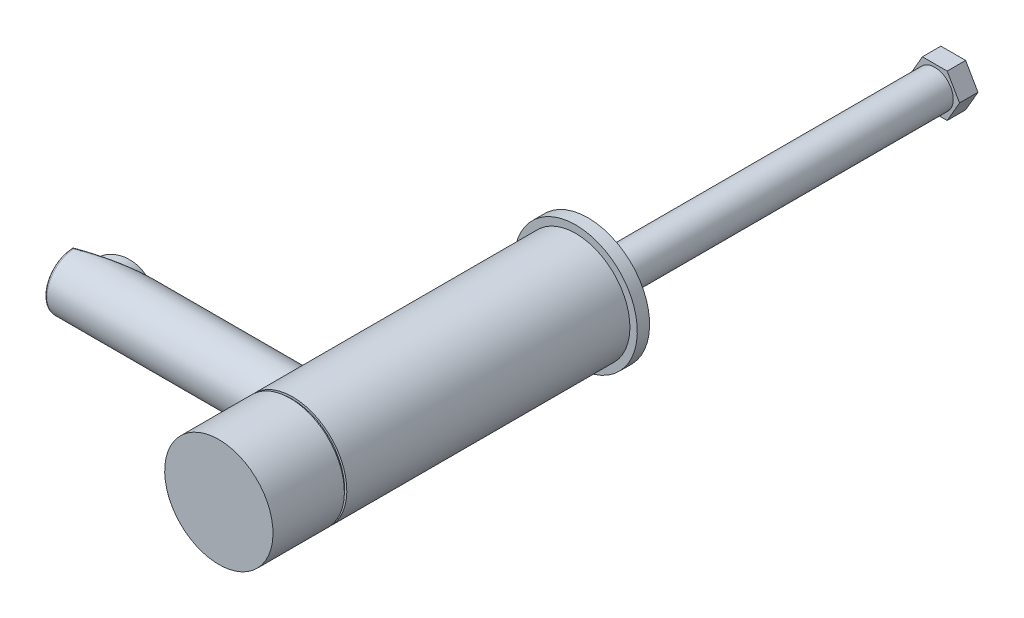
ISO-10303-21;
HEADER;
FILE_DESCRIPTION(('STEP AP214'),'2;1');
FILE_NAME('part.step','',(''),(''),'','','');
FILE_SCHEMA(('AUTOMOTIVE_DESIGN { 1 0 10303 214 1 1 1 1 }'));
ENDSEC;
DATA;
#1=APPLICATION_CONTEXT('core data for automotive mechanical design processes');
#2=APPLICATION_PROTOCOL_DEFINITION('international standard','automotive_design',2000,#1);
#3=PRODUCT_CONTEXT('',#1,'mechanical');
#4=PRODUCT('Part','Part','',(#3));
#5=PRODUCT_RELATED_PRODUCT_CATEGORY('part','',(#4));
#6=PRODUCT_DEFINITION_FORMATION('','',#4);
#7=PRODUCT_DEFINITION_CONTEXT('part definition',#1,'design');
#8=PRODUCT_DEFINITION('design','',#6,#7);
#9=PRODUCT_DEFINITION_SHAPE('','',#8);
#10=(LENGTH_UNIT() NAMED_UNIT(*) SI_UNIT(.MILLI.,.METRE.));
#11=(NAMED_UNIT(*) PLANE_ANGLE_UNIT() SI_UNIT($,.RADIAN.));
#12=(NAMED_UNIT(*) SI_UNIT($,.STERADIAN.) SOLID_ANGLE_UNIT());
#13=UNCERTAINTY_MEASURE_WITH_UNIT(LENGTH_MEASURE(1.E-05),#10,'distance_accuracy_value','');
#14=(GEOMETRIC_REPRESENTATION_CONTEXT(3) GLOBAL_UNCERTAINTY_ASSIGNED_CONTEXT((#13)) GLOBAL_UNIT_ASSIGNED_CONTEXT((#10,
#11,#12)) REPRESENTATION_CONTEXT('',''));
#15=CARTESIAN_POINT('',(0.,0.,0.));
#16=DIRECTION('',(0.,0.,1.));
#17=DIRECTION('',(1.,0.,0.));
#18=AXIS2_PLACEMENT_3D('',#15,#16,#17);
#19=CARTESIAN_POINT('',(46.5307250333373,8.70603185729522,-149.18060821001));
#20=DIRECTION('',(0.866025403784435,0.500000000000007,0.));
#21=DIRECTION('',(-0.500000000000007,0.866025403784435,0.));
#22=AXIS2_PLACEMENT_3D('',#19,#20,#21);
#23=PLANE('',#22);
#24=DIRECTION('',(-0.500000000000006,0.866025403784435,0.));
#25=VECTOR('',#24,1.);
#26=CARTESIAN_POINT('',(51.5571548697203,0.,-149.18060821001));
#27=LINE('',#26,#25);
#28=CARTESIAN_POINT('',(51.5571548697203,0.,-149.18060821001));
#29=VERTEX_POINT('',#28);
#30=CARTESIAN_POINT('',(46.5307250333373,8.70603185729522,-149.18060821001));
#31=VERTEX_POINT('',#30);
#32=EDGE_CURVE('P0_E111',#29,#31,#27,.T.);
#33=ORIENTED_EDGE('',*,*,#32,.T.);
#34=DIRECTION('',(0.,0.,1.));
#35=VECTOR('',#34,1.);
#36=CARTESIAN_POINT('',(46.5307250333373,8.70603185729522,-149.18060821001));
#37=LINE('',#36,#35);
#38=CARTESIAN_POINT('',(46.5307250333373,8.70603185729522,-141.68060821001));
#39=VERTEX_POINT('',#38);
#40=EDGE_CURVE('P0_E101',#39,#31,#37,.F.);
#41=ORIENTED_EDGE('',*,*,#40,.F.);
#42=DIRECTION('',(-0.500000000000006,0.866025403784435,0.));
#43=VECTOR('',#42,1.);
#44=CARTESIAN_POINT('',(51.5571548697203,0.,-141.68060821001));
#45=LINE('',#44,#43);
#46=CARTESIAN_POINT('',(51.5571548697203,0.,-141.68060821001));
#47=VERTEX_POINT('',#46);
#48=EDGE_CURVE('P0_E112',#47,#39,#45,.T.);
#49=ORIENTED_EDGE('',*,*,#48,.F.);
#50=DIRECTION('',(0.,0.,1.));
#51=VECTOR('',#50,1.);
#52=CARTESIAN_POINT('',(51.5571548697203,0.,-149.18060821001));
#53=LINE('',#52,#51);
#54=EDGE_CURVE('P0_E76',#29,#47,#53,.T.);
#55=ORIENTED_EDGE('',*,*,#54,.F.);
#56=EDGE_LOOP('',(#33,#41,#49,#55));
#57=FACE_BOUND('',#56,.T.);
#58=ADVANCED_FACE('P0_F16',(#57),#23,.T.);
#59=CARTESIAN_POINT('',(36.4778653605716,8.70603185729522,-149.18060821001));
#60=DIRECTION('',(0.,1.,0.));
#61=DIRECTION('',(0.,0.,1.));
#62=AXIS2_PLACEMENT_3D('',#59,#60,#61);
#63=PLANE('',#62);
#64=DIRECTION('',(1.,0.,0.));
#65=VECTOR('',#64,1.);
#66=CARTESIAN_POINT('',(41.5042951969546,8.70603185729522,-149.18060821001));
#67=LINE('',#66,#65);
#68=CARTESIAN_POINT('',(36.4778653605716,8.70603185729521,-149.18060821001));
#69=VERTEX_POINT('',#68);
#70=EDGE_CURVE('P0_E106',#31,#69,#67,.F.);
#71=ORIENTED_EDGE('',*,*,#70,.T.);
#72=DIRECTION('',(0.,0.,1.));
#73=VECTOR('',#72,1.);
#74=CARTESIAN_POINT('',(36.4778653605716,8.70603185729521,-149.18060821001));
#75=LINE('',#74,#73);
#76=CARTESIAN_POINT('',(36.4778653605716,8.70603185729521,-141.68060821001));
#77=VERTEX_POINT('',#76);
#78=EDGE_CURVE('P0_E64',#77,#69,#75,.F.);
#79=ORIENTED_EDGE('',*,*,#78,.F.);
#80=DIRECTION('',(1.,0.,0.));
#81=VECTOR('',#80,1.);
#82=CARTESIAN_POINT('',(41.5042951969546,8.70603185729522,-141.68060821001));
#83=LINE('',#82,#81);
#84=EDGE_CURVE('P0_E108',#39,#77,#83,.F.);
#85=ORIENTED_EDGE('',*,*,#84,.F.);
#86=ORIENTED_EDGE('',*,*,#40,.T.);
#87=EDGE_LOOP('',(#71,#79,#85,#86));
#88=FACE_BOUND('',#87,.T.);
#89=ADVANCED_FACE('P0_F105',(#88),#63,.T.);
#90=CARTESIAN_POINT('',(31.4514355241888,0.,-149.18060821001));
#91=DIRECTION('',(-0.866025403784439,0.5,0.));
#92=DIRECTION('',(-0.5,-0.866025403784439,0.));
#93=AXIS2_PLACEMENT_3D('',#90,#91,#92);
#94=PLANE('',#93);
#95=DIRECTION('',(-0.499999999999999,-0.866025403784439,0.));
#96=VECTOR('',#95,1.);
#97=CARTESIAN_POINT('',(36.4778653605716,8.70603185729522,-149.18060821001));
#98=LINE('',#97,#96);
#99=CARTESIAN_POINT('',(31.4514355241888,0.,-149.18060821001));
#100=VERTEX_POINT('',#99);
#101=EDGE_CURVE('P0_E67',#69,#100,#98,.T.);
#102=ORIENTED_EDGE('',*,*,#101,.T.);
#103=DIRECTION('',(0.,0.,1.));
#104=VECTOR('',#103,1.);
#105=CARTESIAN_POINT('',(31.4514355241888,0.,-149.18060821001));
#106=LINE('',#105,#104);
#107=CARTESIAN_POINT('',(31.4514355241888,0.,-141.68060821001));
#108=VERTEX_POINT('',#107);
#109=EDGE_CURVE('P0_E70',#108,#100,#106,.F.);
#110=ORIENTED_EDGE('',*,*,#109,.F.);
#111=DIRECTION('',(-0.499999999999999,-0.866025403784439,0.));
#112=VECTOR('',#111,1.);
#113=CARTESIAN_POINT('',(36.4778653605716,8.70603185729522,-141.68060821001));
#114=LINE('',#113,#112);
#115=EDGE_CURVE('P0_E128',#77,#108,#114,.T.);
#116=ORIENTED_EDGE('',*,*,#115,.F.);
#117=ORIENTED_EDGE('',*,*,#78,.T.);
#118=EDGE_LOOP('',(#102,#110,#116,#117));
#119=FACE_BOUND('',#118,.T.);
#120=ADVANCED_FACE('P0_F69',(#119),#94,.T.);
#121=CARTESIAN_POINT('',(36.4778653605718,-8.7060318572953,-149.18060821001));
#122=DIRECTION('',(-0.866025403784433,-0.500000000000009,0.));
#123=DIRECTION('',(0.500000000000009,-0.866025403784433,0.));
#124=AXIS2_PLACEMENT_3D('',#121,#122,#123);
#125=PLANE('',#124);
#126=DIRECTION('',(0.50000000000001,-0.866025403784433,0.));
#127=VECTOR('',#126,1.);
#128=CARTESIAN_POINT('',(31.4514355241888,0.,-149.18060821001));
#129=LINE('',#128,#127);
#130=CARTESIAN_POINT('',(36.4778653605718,-8.7060318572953,-149.18060821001));
#131=VERTEX_POINT('',#130);
#132=EDGE_CURVE('P0_E75',#100,#131,#129,.T.);
#133=ORIENTED_EDGE('',*,*,#132,.T.);
#134=DIRECTION('',(0.,0.,1.));
#135=VECTOR('',#134,1.);
#136=CARTESIAN_POINT('',(36.4778653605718,-8.70603185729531,-149.18060821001));
#137=LINE('',#136,#135);
#138=CARTESIAN_POINT('',(36.4778653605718,-8.7060318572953,-141.68060821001));
#139=VERTEX_POINT('',#138);
#140=EDGE_CURVE('P0_E84',#139,#131,#137,.F.);
#141=ORIENTED_EDGE('',*,*,#140,.F.);
#142=DIRECTION('',(0.50000000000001,-0.866025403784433,0.));
#143=VECTOR('',#142,1.);
#144=CARTESIAN_POINT('',(31.4514355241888,0.,-141.68060821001));
#145=LINE('',#144,#143);
#146=EDGE_CURVE('P0_E82',#108,#139,#145,.T.);
#147=ORIENTED_EDGE('',*,*,#146,.F.);
#148=ORIENTED_EDGE('',*,*,#109,.T.);
#149=EDGE_LOOP('',(#133,#141,#147,#148));
#150=FACE_BOUND('',#149,.T.);
#151=ADVANCED_FACE('P0_F79',(#150),#125,.T.);
#152=CARTESIAN_POINT('',(46.5307250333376,-8.7060318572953,-149.18060821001));
#153=DIRECTION('',(0.,-1.,0.));
#154=DIRECTION('',(1.,0.,0.));
#155=AXIS2_PLACEMENT_3D('',#152,#153,#154);
#156=PLANE('',#155);
#157=DIRECTION('',(1.,0.,0.));
#158=VECTOR('',#157,1.);
#159=CARTESIAN_POINT('',(41.5042951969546,-8.7060318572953,-149.18060821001));
#160=LINE('',#159,#158);
#161=CARTESIAN_POINT('',(46.5307250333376,-8.7060318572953,-149.18060821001));
#162=VERTEX_POINT('',#161);
#163=EDGE_CURVE('P0_E90',#131,#162,#160,.T.);
#164=ORIENTED_EDGE('',*,*,#163,.T.);
#165=DIRECTION('',(0.,0.,1.));
#166=VECTOR('',#165,1.);
#167=CARTESIAN_POINT('',(46.5307250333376,-8.7060318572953,-149.18060821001));
#168=LINE('',#167,#166);
#169=CARTESIAN_POINT('',(46.5307250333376,-8.7060318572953,-141.68060821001));
#170=VERTEX_POINT('',#169);
#171=EDGE_CURVE('P0_E32',#170,#162,#168,.F.);
#172=ORIENTED_EDGE('',*,*,#171,.F.);
#173=DIRECTION('',(1.,0.,0.));
#174=VECTOR('',#173,1.);
#175=CARTESIAN_POINT('',(41.5042951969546,-8.7060318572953,-141.68060821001));
#176=LINE('',#175,#174);
#177=EDGE_CURVE('P0_E124',#139,#170,#176,.T.);
#178=ORIENTED_EDGE('',*,*,#177,.F.);
#179=ORIENTED_EDGE('',*,*,#140,.T.);
#180=EDGE_LOOP('',(#164,#172,#178,#179));
#181=FACE_BOUND('',#180,.T.);
#182=ADVANCED_FACE('P0_F153',(#181),#156,.T.);
#183=CARTESIAN_POINT('',(51.5571548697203,0.,-149.18060821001));
#184=DIRECTION('',(0.866025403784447,-0.499999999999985,0.));
#185=DIRECTION('',(0.499999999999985,0.866025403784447,0.));
#186=AXIS2_PLACEMENT_3D('',#183,#184,#185);
#187=PLANE('',#186);
#188=DIRECTION('',(0.499999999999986,0.866025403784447,0.));
#189=VECTOR('',#188,1.);
#190=CARTESIAN_POINT('',(46.5307250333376,-8.7060318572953,-149.18060821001));
#191=LINE('',#190,#189);
#192=EDGE_CURVE('P0_E92',#162,#29,#191,.T.);
#193=ORIENTED_EDGE('',*,*,#192,.T.);
#194=ORIENTED_EDGE('',*,*,#54,.T.);
#195=DIRECTION('',(0.499999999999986,0.866025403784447,0.));
#196=VECTOR('',#195,1.);
#197=CARTESIAN_POINT('',(46.5307250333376,-8.7060318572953,-141.68060821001));
#198=LINE('',#197,#196);
#199=EDGE_CURVE('P0_E121',#170,#47,#198,.T.);
#200=ORIENTED_EDGE('',*,*,#199,.F.);
#201=ORIENTED_EDGE('',*,*,#171,.T.);
#202=EDGE_LOOP('',(#193,#194,#200,#201));
#203=FACE_BOUND('',#202,.T.);
#204=ADVANCED_FACE('P0_F119',(#203),#187,.T.);
#205=CARTESIAN_POINT('',(41.5042951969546,0.,-149.18060821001));
#206=DIRECTION('',(0.,0.,1.));
#207=DIRECTION('',(1.,0.,0.));
#208=AXIS2_PLACEMENT_3D('',#205,#206,#207);
#209=PLANE('',#208);
#210=CARTESIAN_POINT('',(41.5042951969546,0.,-149.18060821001));
#211=DIRECTION('',(0.,0.,1.));
#212=DIRECTION('',(1.,0.,0.));
#213=AXIS2_PLACEMENT_3D('',#210,#211,#212);
#214=CIRCLE('',#213,7.5);
#215=CARTESIAN_POINT('',(49.0042951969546,0.,-149.18060821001));
#216=VERTEX_POINT('',#215);
#217=EDGE_CURVE('P0_E19',#216,#216,#214,.F.);
#218=ORIENTED_EDGE('',*,*,#217,.F.);
#219=EDGE_LOOP('',(#218));
#220=FACE_BOUND('',#219,.T.);
#221=ORIENTED_EDGE('',*,*,#32,.F.);
#222=ORIENTED_EDGE('',*,*,#192,.F.);
#223=ORIENTED_EDGE('',*,*,#163,.F.);
#224=ORIENTED_EDGE('',*,*,#132,.F.);
#225=ORIENTED_EDGE('',*,*,#101,.F.);
#226=ORIENTED_EDGE('',*,*,#70,.F.);
#227=EDGE_LOOP('',(#221,#222,#223,#224,#225,#226));
#228=FACE_BOUND('',#227,.T.);
#229=ADVANCED_FACE('P0_F88',(#220,#228),#209,.F.);
#230=CARTESIAN_POINT('',(41.5042951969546,0.,-141.68060821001));
#231=DIRECTION('',(0.,0.,1.));
#232=DIRECTION('',(1.,0.,0.));
#233=AXIS2_PLACEMENT_3D('',#230,#231,#232);
#234=PLANE('',#233);
#235=CARTESIAN_POINT('',(41.5042951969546,0.,-141.68060821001));
#236=DIRECTION('',(0.,0.,1.));
#237=DIRECTION('',(1.,0.,0.));
#238=AXIS2_PLACEMENT_3D('',#235,#236,#237);
#239=CIRCLE('',#238,7.5);
#240=CARTESIAN_POINT('',(49.0042951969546,0.,-141.68060821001));
#241=VERTEX_POINT('',#240);
#242=EDGE_CURVE('P0_E11',#241,#241,#239,.T.);
#243=ORIENTED_EDGE('',*,*,#242,.F.);
#244=EDGE_LOOP('',(#243));
#245=FACE_BOUND('',#244,.T.);
#246=ORIENTED_EDGE('',*,*,#177,.T.);
#247=ORIENTED_EDGE('',*,*,#199,.T.);
#248=ORIENTED_EDGE('',*,*,#48,.T.);
#249=ORIENTED_EDGE('',*,*,#84,.T.);
#250=ORIENTED_EDGE('',*,*,#115,.T.);
#251=ORIENTED_EDGE('',*,*,#146,.T.);
#252=EDGE_LOOP('',(#246,#247,#248,#249,#250,#251));
#253=FACE_BOUND('',#252,.T.);
#254=ADVANCED_FACE('P0_F126',(#245,#253),#234,.T.);
#255=CARTESIAN_POINT('',(41.5042951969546,0.,-149.18060821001));
#256=DIRECTION('',(0.,0.,1.));
#257=DIRECTION('',(1.,0.,0.));
#258=AXIS2_PLACEMENT_3D('',#255,#256,#257);
#259=CYLINDRICAL_SURFACE('',#258,7.5);
#260=ORIENTED_EDGE('',*,*,#217,.T.);
#261=EDGE_LOOP('',(#260));
#262=FACE_BOUND('',#261,.T.);
#263=ORIENTED_EDGE('',*,*,#242,.T.);
#264=EDGE_LOOP('',(#263));
#265=FACE_BOUND('',#264,.T.);
#266=ADVANCED_FACE('P0_F136',(#262,#265),#259,.F.);
#267=CLOSED_SHELL('',(#58,#89,#120,#151,#182,#204,#229,#254,#266));
#268=MANIFOLD_SOLID_BREP('P0_B1',#267);
#269=CARTESIAN_POINT('',(41.5042951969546,0.,-149.18060821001));
#270=DIRECTION('',(0.,0.,1.));
#271=DIRECTION('',(0.,-1.,0.));
#272=AXIS2_PLACEMENT_3D('',#269,#270,#271);
#273=CYLINDRICAL_SURFACE('',#272,6.);
#274=CARTESIAN_POINT('',(41.5042951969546,0.,4.18060821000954));
#275=DIRECTION('',(0.,0.,1.));
#276=DIRECTION('',(0.,-1.,0.));
#277=AXIS2_PLACEMENT_3D('',#274,#275,#276);
#278=CIRCLE('',#277,6.);
#279=CARTESIAN_POINT('',(41.5042951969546,-5.99999999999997,4.18060821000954));
#280=VERTEX_POINT('',#279);
#281=EDGE_CURVE('P1_E26',#280,#280,#278,.F.);
#282=ORIENTED_EDGE('',*,*,#281,.F.);
#283=EDGE_LOOP('',(#282));
#284=FACE_BOUND('',#283,.T.);
#285=CARTESIAN_POINT('',(41.5042951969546,0.,-149.18060821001));
#286=DIRECTION('',(0.,0.,1.));
#287=DIRECTION('',(0.,-1.,0.));
#288=AXIS2_PLACEMENT_3D('',#285,#286,#287);
#289=CIRCLE('',#288,6.);
#290=CARTESIAN_POINT('',(41.5042951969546,-6.,-149.18060821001));
#291=VERTEX_POINT('',#290);
#292=EDGE_CURVE('P1_E17',#291,#291,#289,.F.);
#293=ORIENTED_EDGE('',*,*,#292,.T.);
#294=EDGE_LOOP('',(#293));
#295=FACE_BOUND('',#294,.T.);
#296=ADVANCED_FACE('P1_F14',(#284,#295),#273,.F.);
#297=CARTESIAN_POINT('',(41.5042951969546,0.,-149.18060821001));
#298=DIRECTION('',(0.,0.,1.));
#299=DIRECTION('',(0.,-1.,0.));
#300=AXIS2_PLACEMENT_3D('',#297,#298,#299);
#301=PLANE('',#300);
#302=ORIENTED_EDGE('',*,*,#292,.F.);
#303=EDGE_LOOP('',(#302));
#304=FACE_BOUND('',#303,.T.);
#305=CARTESIAN_POINT('',(41.5042951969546,0.,-149.18060821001));
#306=DIRECTION('',(0.,0.,1.));
#307=DIRECTION('',(0.,-1.,0.));
#308=AXIS2_PLACEMENT_3D('',#305,#306,#307);
#309=CIRCLE('',#308,7.5);
#310=CARTESIAN_POINT('',(41.5042951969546,-7.5,-149.18060821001));
#311=VERTEX_POINT('',#310);
#312=EDGE_CURVE('P1_E21',#311,#311,#309,.T.);
#313=ORIENTED_EDGE('',*,*,#312,.F.);
#314=EDGE_LOOP('',(#313));
#315=FACE_BOUND('',#314,.T.);
#316=ADVANCED_FACE('P1_F35',(#304,#315),#301,.F.);
#317=CARTESIAN_POINT('',(41.5042951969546,0.,4.18060821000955));
#318=DIRECTION('',(0.,0.,1.));
#319=DIRECTION('',(0.,-1.,0.));
#320=AXIS2_PLACEMENT_3D('',#317,#318,#319);
#321=PLANE('',#320);
#322=ORIENTED_EDGE('',*,*,#281,.T.);
#323=EDGE_LOOP('',(#322));
#324=FACE_BOUND('',#323,.T.);
#325=CARTESIAN_POINT('',(41.5042951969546,0.,4.18060821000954));
#326=DIRECTION('',(0.,0.,1.));
#327=DIRECTION('',(0.,-1.,0.));
#328=AXIS2_PLACEMENT_3D('',#325,#326,#327);
#329=CIRCLE('',#328,7.5);
#330=CARTESIAN_POINT('',(41.5042951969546,-7.49999999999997,4.18060821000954));
#331=VERTEX_POINT('',#330);
#332=EDGE_CURVE('P1_E10',#331,#331,#329,.F.);
#333=ORIENTED_EDGE('',*,*,#332,.F.);
#334=EDGE_LOOP('',(#333));
#335=FACE_BOUND('',#334,.T.);
#336=ADVANCED_FACE('P1_F38',(#324,#335),#321,.T.);
#337=CARTESIAN_POINT('',(41.5042951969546,0.,-149.18060821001));
#338=DIRECTION('',(0.,0.,1.));
#339=DIRECTION('',(0.,-1.,0.));
#340=AXIS2_PLACEMENT_3D('',#337,#338,#339);
#341=CYLINDRICAL_SURFACE('',#340,7.5);
#342=ORIENTED_EDGE('',*,*,#312,.T.);
#343=EDGE_LOOP('',(#342));
#344=FACE_BOUND('',#343,.T.);
#345=ORIENTED_EDGE('',*,*,#332,.T.);
#346=EDGE_LOOP('',(#345));
#347=FACE_BOUND('',#346,.T.);
#348=ADVANCED_FACE('P1_F41',(#344,#347),#341,.T.);
#349=CLOSED_SHELL('',(#296,#316,#336,#348));
#350=MANIFOLD_SOLID_BREP('P1_B1',#349);
#351=CARTESIAN_POINT('',(52.0042951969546,0.,148.18060821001));
#352=DIRECTION('',(0.,0.,-1.));
#353=DIRECTION('',(0.,1.,0.));
#354=AXIS2_PLACEMENT_3D('',#351,#352,#353);
#355=PLANE('',#354);
#356=CARTESIAN_POINT('',(41.5042951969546,0.,148.18060821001));
#357=DIRECTION('',(0.,0.,-1.));
#358=DIRECTION('',(0.,1.,0.));
#359=AXIS2_PLACEMENT_3D('',#356,#357,#358);
#360=CIRCLE('',#359,21.);
#361=CARTESIAN_POINT('',(41.5042951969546,21.,148.18060821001));
#362=VERTEX_POINT('',#361);
#363=EDGE_CURVE('P2_E560',#362,#362,#360,.F.);
#364=ORIENTED_EDGE('',*,*,#363,.F.);
#365=EDGE_LOOP('',(#364));
#366=FACE_BOUND('',#365,.T.);
#367=ADVANCED_FACE('P2_F16',(#366),#355,.T.);
#368=CARTESIAN_POINT('',(41.5042951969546,0.,148.18060821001));
#369=DIRECTION('',(0.,0.,-1.));
#370=DIRECTION('',(0.,1.,0.));
#371=AXIS2_PLACEMENT_3D('',#368,#369,#370);
#372=CYLINDRICAL_SURFACE('',#371,21.);
#373=ORIENTED_EDGE('',*,*,#363,.T.);
#374=EDGE_LOOP('',(#373));
#375=FACE_BOUND('',#374,.T.);
#376=CARTESIAN_POINT('',(41.5042951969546,0.,121.18060821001));
#377=DIRECTION('',(0.,0.,-1.));
#378=DIRECTION('',(0.,1.,0.));
#379=AXIS2_PLACEMENT_3D('',#376,#377,#378);
#380=CIRCLE('',#379,21.);
#381=CARTESIAN_POINT('',(41.5042951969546,21.,121.18060821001));
#382=VERTEX_POINT('',#381);
#383=EDGE_CURVE('P2_E557',#382,#382,#380,.F.);
#384=ORIENTED_EDGE('',*,*,#383,.F.);
#385=EDGE_LOOP('',(#384));
#386=FACE_BOUND('',#385,.T.);
#387=ADVANCED_FACE('P2_F578',(#375,#386),#372,.F.);
#388=CARTESIAN_POINT('',(62.0542951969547,0.,121.18060821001));
#389=DIRECTION('',(0.,0.,1.));
#390=DIRECTION('',(0.,-1.,0.));
#391=AXIS2_PLACEMENT_3D('',#388,#389,#390);
#392=PLANE('',#391);
#393=CARTESIAN_POINT('',(41.5042951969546,0.,121.18060821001));
#394=DIRECTION('',(0.,0.,-1.));
#395=DIRECTION('',(0.,1.,0.));
#396=AXIS2_PLACEMENT_3D('',#393,#394,#395);
#397=CIRCLE('',#396,20.1);
#398=CARTESIAN_POINT('',(41.5042951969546,20.1000000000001,121.18060821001));
#399=VERTEX_POINT('',#398);
#400=EDGE_CURVE('P2_E554',#399,#399,#397,.F.);
#401=ORIENTED_EDGE('',*,*,#400,.F.);
#402=EDGE_LOOP('',(#401));
#403=FACE_BOUND('',#402,.T.);
#404=ORIENTED_EDGE('',*,*,#383,.T.);
#405=EDGE_LOOP('',(#404));
#406=FACE_BOUND('',#405,.T.);
#407=ADVANCED_FACE('P2_F585',(#403,#406),#392,.T.);
#408=CARTESIAN_POINT('',(-55.1562456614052,0.,92.5901694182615));
#409=DIRECTION('',(-0.319687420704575,0.,-0.947523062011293));
#410=DIRECTION('',(-0.947523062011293,0.,0.319687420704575));
#411=AXIS2_PLACEMENT_3D('',#408,#409,#410);
#412=PLANE('',#411);
#413=CARTESIAN_POINT('',(-55.1562456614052,0.,92.5901694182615));
#414=DIRECTION('',(-0.319687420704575,0.,-0.947523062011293));
#415=DIRECTION('',(-0.947523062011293,0.,0.319687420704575));
#416=AXIS2_PLACEMENT_3D('',#413,#414,#415);
#417=CIRCLE('',#416,8.7118474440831);
#418=CARTESIAN_POINT('',(-63.410922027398,0.,95.3752374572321));
#419=VERTEX_POINT('',#418);
#420=EDGE_CURVE('P2_E549',#419,#419,#417,.F.);
#421=ORIENTED_EDGE('',*,*,#420,.F.);
#422=EDGE_LOOP('',(#421));
#423=FACE_BOUND('',#422,.T.);
#424=ADVANCED_FACE('P2_F590',(#423),#412,.T.);
#425=CARTESIAN_POINT('',(26.833856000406,0.,100.428716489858));
#426=DIRECTION('',(1.,0.,0.));
#427=DIRECTION('',(0.,0.,-1.));
#428=AXIS2_PLACEMENT_3D('',#425,#426,#427);
#429=PLANE('',#428);
#430=CARTESIAN_POINT('',(26.833856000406,0.,100.428716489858));
#431=DIRECTION('',(-1.,0.,0.));
#432=DIRECTION('',(0.,-1.,0.));
#433=AXIS2_PLACEMENT_3D('',#430,#431,#432);
#434=CIRCLE('',#433,11.5642615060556);
#435=CARTESIAN_POINT('',(26.833856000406,-11.5642615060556,100.428716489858));
#436=VERTEX_POINT('',#435);
#437=EDGE_CURVE('P2_E546',#436,#436,#434,.T.);
#438=ORIENTED_EDGE('',*,*,#437,.F.);
#439=EDGE_LOOP('',(#438));
#440=FACE_BOUND('',#439,.T.);
#441=ADVANCED_FACE('P2_F594',(#440),#429,.T.);
#442=CARTESIAN_POINT('',(41.5042951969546,0.,121.18060821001));
#443=DIRECTION('',(0.,0.,-1.));
#444=DIRECTION('',(0.,1.,0.));
#445=AXIS2_PLACEMENT_3D('',#442,#443,#444);
#446=CYLINDRICAL_SURFACE('',#445,20.1);
#447=ORIENTED_EDGE('',*,*,#400,.T.);
#448=EDGE_LOOP('',(#447));
#449=FACE_BOUND('',#448,.T.);
#450=CARTESIAN_POINT('',(41.5042951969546,0.,118.18060821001));
#451=DIRECTION('',(0.,0.,-1.));
#452=DIRECTION('',(0.,1.,0.));
#453=AXIS2_PLACEMENT_3D('',#450,#451,#452);
#454=CIRCLE('',#453,20.1);
#455=CARTESIAN_POINT('',(41.5042951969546,20.1000000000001,118.18060821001));
#456=VERTEX_POINT('',#455);
#457=EDGE_CURVE('P2_E544',#456,#456,#454,.F.);
#458=ORIENTED_EDGE('',*,*,#457,.F.);
#459=EDGE_LOOP('',(#458));
#460=FACE_BOUND('',#459,.T.);
#461=ADVANCED_FACE('P2_F598',(#449,#460),#446,.F.);
#462=CARTESIAN_POINT('',(-53.8345317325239,0.,96.5076035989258));
#463=DIRECTION('',(-0.319687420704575,0.,-0.947523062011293));
#464=DIRECTION('',(-0.947523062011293,0.,0.319687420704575));
#465=AXIS2_PLACEMENT_3D('',#462,#463,#464);
#466=CYLINDRICAL_SURFACE('',#465,8.7118474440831);
#467=ORIENTED_EDGE('',*,*,#420,.T.);
#468=EDGE_LOOP('',(#467));
#469=FACE_BOUND('',#468,.T.);
#470=CARTESIAN_POINT('',(-53.941633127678,0.,96.1901652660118));
#471=DIRECTION('',(-0.319687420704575,0.,-0.947523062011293));
#472=DIRECTION('',(-0.947523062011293,0.,0.319687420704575));
#473=AXIS2_PLACEMENT_3D('',#470,#471,#472);
#474=CIRCLE('',#473,8.7118474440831);
#475=CARTESIAN_POINT('',(-62.1963094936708,0.,98.9752333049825));
#476=VERTEX_POINT('',#475);
#477=EDGE_CURVE('P2_E381',#476,#476,#474,.T.);
#478=ORIENTED_EDGE('',*,*,#477,.T.);
#479=EDGE_LOOP('',(#478));
#480=FACE_BOUND('',#479,.T.);
#481=ADVANCED_FACE('P2_F405',(#469,#480),#466,.T.);
#482=CARTESIAN_POINT('',(-34.7874493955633,0.,100.428716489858));
#483=DIRECTION('',(-1.,0.,0.));
#484=DIRECTION('',(0.,-1.,0.));
#485=AXIS2_PLACEMENT_3D('',#482,#483,#484);
#486=CYLINDRICAL_SURFACE('',#485,11.5642615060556);
#487=ORIENTED_EDGE('',*,*,#437,.T.);
#488=EDGE_LOOP('',(#487));
#489=FACE_BOUND('',#488,.T.);
#490=CARTESIAN_POINT('',(20.5042951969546,0.,88.8644549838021));
#491=CARTESIAN_POINT('',(20.5042959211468,-0.300419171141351,88.864455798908));
#492=CARTESIAN_POINT('',(20.5107563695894,-0.600851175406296,88.8761755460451));
#493=CARTESIAN_POINT('',(20.5364319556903,-1.19935337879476,88.9229001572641));
#494=CARTESIAN_POINT('',(20.5556478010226,-1.49742344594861,88.9579063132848));
#495=CARTESIAN_POINT('',(20.6063507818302,-2.08904472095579,89.0507669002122));
#496=CARTESIAN_POINT('',(20.6378431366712,-2.38259395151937,89.1086310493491));
#497=CARTESIAN_POINT('',(20.7123117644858,-2.96294178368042,89.246494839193));
#498=CARTESIAN_POINT('',(20.7552880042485,-3.24974040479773,89.3264944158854));
#499=CARTESIAN_POINT('',(20.8515061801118,-3.8136349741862,89.5073760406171));
#500=CARTESIAN_POINT('',(20.9047079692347,-4.09076401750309,89.6081765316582));
#501=CARTESIAN_POINT('',(21.0202716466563,-4.63488354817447,89.8298341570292));
#502=CARTESIAN_POINT('',(21.0826335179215,-4.90187405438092,89.9506912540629));
#503=CARTESIAN_POINT('',(21.2151598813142,-5.42435507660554,90.2113903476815));
#504=CARTESIAN_POINT('',(21.2853237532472,-5.67984650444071,90.3512308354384));
#505=CARTESIAN_POINT('',(21.4320279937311,-6.17831896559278,90.6488989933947));
#506=CARTESIAN_POINT('',(21.5085707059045,-6.42129534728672,90.8067332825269));
#507=CARTESIAN_POINT('',(21.6718977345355,-6.90990838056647,91.1507532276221));
#508=CARTESIAN_POINT('',(21.7590244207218,-7.15458439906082,91.3381409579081));
#509=CARTESIAN_POINT('',(21.936835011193,-7.62747176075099,91.7311107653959));
#510=CARTESIAN_POINT('',(22.0275190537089,-7.85568246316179,91.9366935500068));
#511=CARTESIAN_POINT('',(22.2105007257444,-8.29494768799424,92.3652049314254));
#512=CARTESIAN_POINT('',(22.3027997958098,-8.50598583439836,92.5881496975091));
#513=CARTESIAN_POINT('',(22.4868078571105,-8.90979316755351,93.050241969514));
#514=CARTESIAN_POINT('',(22.5785168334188,-9.1025618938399,93.289389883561));
#515=CARTESIAN_POINT('',(22.7681075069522,-9.48713211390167,93.8074913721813));
#516=CARTESIAN_POINT('',(22.8656977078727,-9.67693627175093,94.0880394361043));
#517=CARTESIAN_POINT('',(23.0544179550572,-10.0320728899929,94.6663553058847));
#518=CARTESIAN_POINT('',(23.145547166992,-10.1974021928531,94.9641253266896));
#519=CARTESIAN_POINT('',(23.3180230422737,-10.5019093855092,95.5750191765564));
#520=CARTESIAN_POINT('',(23.3993812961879,-10.6411183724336,95.8881241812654));
#521=CARTESIAN_POINT('',(23.5491900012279,-10.8919961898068,96.528126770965));
#522=CARTESIAN_POINT('',(23.6176443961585,-11.0036734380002,96.8550201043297));
#523=CARTESIAN_POINT('',(23.7254586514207,-11.1768053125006,97.4479811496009));
#524=CARTESIAN_POINT('',(23.7679085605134,-11.2438995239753,97.7118528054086));
#525=CARTESIAN_POINT('',(23.8417309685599,-11.3595134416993,98.2451415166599));
#526=CARTESIAN_POINT('',(23.8731054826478,-11.4080365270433,98.51455755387));
#527=CARTESIAN_POINT('',(23.923728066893,-11.4858967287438,99.0570883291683));
#528=CARTESIAN_POINT('',(23.9429847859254,-11.5152475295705,99.3302002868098));
#529=CARTESIAN_POINT('',(23.9687406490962,-11.5544310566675,99.8784432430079));
#530=CARTESIAN_POINT('',(23.9752388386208,-11.5642623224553,100.153574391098));
#531=CARTESIAN_POINT('',(23.9752365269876,-11.5642606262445,100.725229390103));
#532=CARTESIAN_POINT('',(23.9676871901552,-11.5528409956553,101.021755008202));
#533=CARTESIAN_POINT('',(23.9378000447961,-11.50734436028,101.612311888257));
#534=CARTESIAN_POINT('',(23.9154612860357,-11.4732658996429,101.90634298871));
#535=CARTESIAN_POINT('',(23.8568709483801,-11.3829391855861,102.48979962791));
#536=CARTESIAN_POINT('',(23.8206080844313,-11.3266729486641,102.779221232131));
#537=CARTESIAN_POINT('',(23.735542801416,-11.1927527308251,103.351165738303));
#538=CARTESIAN_POINT('',(23.6867402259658,-11.1150984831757,103.633688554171));
#539=CARTESIAN_POINT('',(23.5786303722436,-10.9398837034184,104.188393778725));
#540=CARTESIAN_POINT('',(23.5193904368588,-10.84245020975,104.46062964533));
#541=CARTESIAN_POINT('',(23.3920172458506,-10.6283066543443,104.995359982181));
#542=CARTESIAN_POINT('',(23.3238805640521,-10.5115891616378,105.257850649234));
#543=CARTESIAN_POINT('',(23.1806325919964,-10.2598418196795,105.771909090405));
#544=CARTESIAN_POINT('',(23.105521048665,-10.1248113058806,106.023476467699));
#545=CARTESIAN_POINT('',(22.9502221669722,-9.83732999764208,106.514773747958));
#546=CARTESIAN_POINT('',(22.8700350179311,-9.684879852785,106.754504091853));
#547=CARTESIAN_POINT('',(22.6981248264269,-9.34705363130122,107.24503331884));
#548=CARTESIAN_POINT('',(22.6060561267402,-9.15990652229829,107.494492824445));
#549=CARTESIAN_POINT('',(22.4203421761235,-8.76641724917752,107.977162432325));
#550=CARTESIAN_POINT('',(22.3266968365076,-8.56007400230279,108.210371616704));
#551=CARTESIAN_POINT('',(22.1400300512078,-8.12898701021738,108.659675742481));
#552=CARTESIAN_POINT('',(22.0470089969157,-7.90423271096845,108.875760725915));
#553=CARTESIAN_POINT('',(21.8637962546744,-7.43731861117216,109.289629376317));
#554=CARTESIAN_POINT('',(21.7736050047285,-7.19515613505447,109.487410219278));
#555=CARTESIAN_POINT('',(21.5905225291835,-6.67268761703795,109.879809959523));
#556=CARTESIAN_POINT('',(21.4980764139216,-6.39089520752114,110.072664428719));
#557=CARTESIAN_POINT('',(21.3215936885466,-5.80954272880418,110.433633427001));
#558=CARTESIAN_POINT('',(21.2375536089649,-5.50999007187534,110.601758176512));
#559=CARTESIAN_POINT('',(21.080315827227,-4.89506773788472,110.911505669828));
#560=CARTESIAN_POINT('',(21.007109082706,-4.57971154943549,111.05315054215));
#561=CARTESIAN_POINT('',(20.8736800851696,-3.93521454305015,111.308342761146));
#562=CARTESIAN_POINT('',(20.8134543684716,-3.60607743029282,111.421897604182));
#563=CARTESIAN_POINT('',(20.719159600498,-3.00819268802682,111.59824119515));
#564=CARTESIAN_POINT('',(20.6822513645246,-2.7415475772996,111.666692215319));
#565=CARTESIAN_POINT('',(20.6184000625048,-2.20292682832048,111.784561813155));
#566=CARTESIAN_POINT('',(20.5914554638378,-1.9309520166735,111.833983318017));
#567=CARTESIAN_POINT('',(20.5481141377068,-1.38342543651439,111.91326134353));
#568=CARTESIAN_POINT('',(20.5317137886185,-1.10787492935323,111.943124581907));
#569=CARTESIAN_POINT('',(20.5098035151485,-0.554886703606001,111.982984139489));
#570=CARTESIAN_POINT('',(20.5042945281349,-0.277448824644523,111.992978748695));
#571=CARTESIAN_POINT('',(20.5042959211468,0.300419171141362,111.992977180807));
#572=CARTESIAN_POINT('',(20.5107563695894,0.600851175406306,111.98125743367));
#573=CARTESIAN_POINT('',(20.5364319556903,1.19935337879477,111.934532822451));
#574=CARTESIAN_POINT('',(20.5556478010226,1.49742344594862,111.899526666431));
#575=CARTESIAN_POINT('',(20.6063507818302,2.0890447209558,111.806666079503));
#576=CARTESIAN_POINT('',(20.6378431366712,2.38259395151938,111.748801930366));
#577=CARTESIAN_POINT('',(20.7123117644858,2.96294178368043,111.610938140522));
#578=CARTESIAN_POINT('',(20.7552880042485,3.24974040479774,111.53093856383));
#579=CARTESIAN_POINT('',(20.8515061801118,3.81363497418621,111.350056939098));
#580=CARTESIAN_POINT('',(20.9047079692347,4.0907640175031,111.249256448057));
#581=CARTESIAN_POINT('',(21.0202716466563,4.63488354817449,111.027598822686));
#582=CARTESIAN_POINT('',(21.0826335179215,4.90187405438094,110.906741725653));
#583=CARTESIAN_POINT('',(21.2151598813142,5.42435507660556,110.646042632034));
#584=CARTESIAN_POINT('',(21.2853237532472,5.67984650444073,110.506202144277));
#585=CARTESIAN_POINT('',(21.4320279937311,6.1783189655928,110.208533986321));
#586=CARTESIAN_POINT('',(21.5085707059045,6.42129534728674,110.050699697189));
#587=CARTESIAN_POINT('',(21.6718977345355,6.90990838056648,109.706679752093));
#588=CARTESIAN_POINT('',(21.7590244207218,7.15458439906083,109.519292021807));
#589=CARTESIAN_POINT('',(21.936835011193,7.627471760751,109.12632221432));
#590=CARTESIAN_POINT('',(22.0275190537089,7.85568246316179,108.920739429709));
#591=CARTESIAN_POINT('',(22.2105007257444,8.29494768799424,108.49222804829));
#592=CARTESIAN_POINT('',(22.3027997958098,8.50598583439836,108.269283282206));
#593=CARTESIAN_POINT('',(22.4868078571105,8.90979316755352,107.807191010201));
#594=CARTESIAN_POINT('',(22.5785168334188,9.1025618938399,107.568043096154));
#595=CARTESIAN_POINT('',(22.7681075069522,9.48713211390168,107.049941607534));
#596=CARTESIAN_POINT('',(22.8656977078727,9.67693627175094,106.769393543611));
#597=CARTESIAN_POINT('',(23.0544179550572,10.0320728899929,106.191077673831));
#598=CARTESIAN_POINT('',(23.145547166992,10.1974021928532,105.893307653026));
#599=CARTESIAN_POINT('',(23.3180230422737,10.5019093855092,105.282413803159));
#600=CARTESIAN_POINT('',(23.3993812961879,10.6411183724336,104.96930879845));
#601=CARTESIAN_POINT('',(23.5491900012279,10.8919961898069,104.32930620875));
#602=CARTESIAN_POINT('',(23.6176443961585,11.0036734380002,104.002412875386));
#603=CARTESIAN_POINT('',(23.7254586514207,11.1768053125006,103.409451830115));
#604=CARTESIAN_POINT('',(23.7679085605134,11.2438995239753,103.145580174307));
#605=CARTESIAN_POINT('',(23.8417309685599,11.3595134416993,102.612291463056));
#606=CARTESIAN_POINT('',(23.8731054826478,11.4080365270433,102.342875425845));
#607=CARTESIAN_POINT('',(23.923728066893,11.4858967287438,101.800344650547));
#608=CARTESIAN_POINT('',(23.9429847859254,11.5152475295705,101.527232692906));
#609=CARTESIAN_POINT('',(23.9687406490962,11.5544310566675,100.978989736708));
#610=CARTESIAN_POINT('',(23.9752388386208,11.5642623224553,100.703858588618));
#611=CARTESIAN_POINT('',(23.9752365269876,11.5642606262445,100.132203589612));
#612=CARTESIAN_POINT('',(23.9676871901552,11.5528409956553,99.8356779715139));
#613=CARTESIAN_POINT('',(23.9378000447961,11.50734436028,99.2451210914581));
#614=CARTESIAN_POINT('',(23.9154612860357,11.4732658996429,98.9510899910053));
#615=CARTESIAN_POINT('',(23.8568709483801,11.3829391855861,98.3676333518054));
#616=CARTESIAN_POINT('',(23.8206080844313,11.3266729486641,98.0782117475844));
#617=CARTESIAN_POINT('',(23.735542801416,11.1927527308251,97.5062672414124));
#618=CARTESIAN_POINT('',(23.6867402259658,11.1150984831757,97.2237444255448));
#619=CARTESIAN_POINT('',(23.5786303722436,10.9398837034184,96.6690392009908));
#620=CARTESIAN_POINT('',(23.5193904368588,10.84245020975,96.3968033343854));
#621=CARTESIAN_POINT('',(23.3920172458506,10.6283066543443,95.862072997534));
#622=CARTESIAN_POINT('',(23.3238805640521,10.5115891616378,95.599582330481));
#623=CARTESIAN_POINT('',(23.1806325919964,10.2598418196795,95.0855238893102));
#624=CARTESIAN_POINT('',(23.105521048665,10.1248113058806,94.8339565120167));
#625=CARTESIAN_POINT('',(22.9502221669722,9.83732999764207,94.3426592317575));
#626=CARTESIAN_POINT('',(22.870035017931,9.684879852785,94.1029288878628));
#627=CARTESIAN_POINT('',(22.6981248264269,9.34705363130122,93.6123996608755));
#628=CARTESIAN_POINT('',(22.6060561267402,9.15990652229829,93.3629401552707));
#629=CARTESIAN_POINT('',(22.4203421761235,8.76641724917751,92.8802705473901));
#630=CARTESIAN_POINT('',(22.3266968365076,8.56007400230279,92.6470613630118));
#631=CARTESIAN_POINT('',(22.1400300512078,8.12898701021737,92.197757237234));
#632=CARTESIAN_POINT('',(22.0470089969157,7.90423271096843,91.9816722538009));
#633=CARTESIAN_POINT('',(21.8637962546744,7.43731861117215,91.5678036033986));
#634=CARTESIAN_POINT('',(21.7736050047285,7.19515613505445,91.3700227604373));
#635=CARTESIAN_POINT('',(21.5905225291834,6.67268761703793,90.9776230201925));
#636=CARTESIAN_POINT('',(21.4980764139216,6.39089520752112,90.7847685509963));
#637=CARTESIAN_POINT('',(21.3215936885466,5.80954272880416,90.4237995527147));
#638=CARTESIAN_POINT('',(21.2375536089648,5.50999007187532,90.2556748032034));
#639=CARTESIAN_POINT('',(21.080315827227,4.8950677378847,89.9459273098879));
#640=CARTESIAN_POINT('',(21.007109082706,4.57971154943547,89.8042824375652));
#641=CARTESIAN_POINT('',(20.8736800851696,3.93521454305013,89.549090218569));
#642=CARTESIAN_POINT('',(20.8134543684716,3.6060774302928,89.435535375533));
#643=CARTESIAN_POINT('',(20.719159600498,3.00819268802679,89.2591917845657));
#644=CARTESIAN_POINT('',(20.6822513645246,2.74154757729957,89.1907407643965));
#645=CARTESIAN_POINT('',(20.6184000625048,2.20292682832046,89.0728711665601));
#646=CARTESIAN_POINT('',(20.5914554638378,1.93095201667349,89.023449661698));
#647=CARTESIAN_POINT('',(20.5481141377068,1.38342543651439,88.9441716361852));
#648=CARTESIAN_POINT('',(20.5317137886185,1.10787492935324,88.914308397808));
#649=CARTESIAN_POINT('',(20.5098035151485,0.554886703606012,88.8744488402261));
#650=CARTESIAN_POINT('',(20.5042945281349,0.277448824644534,88.8644542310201));
#651=CARTESIAN_POINT('',(20.5042951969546,0.,88.8644549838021));
#652=B_SPLINE_CURVE_WITH_KNOTS('',3,(#490,#491,#492,#493,#494,#495,#496,#497,#498,#499,#500,
#501,#502,#503,#504,#505,#506,#507,#508,#509,#510,#511,#512,#513,#514,#515,#516,#517,#518,#519,
#520,#521,#522,#523,#524,#525,#526,#527,#528,#529,#530,#531,#532,#533,#534,#535,#536,#537,#538,
#539,#540,#541,#542,#543,#544,#545,#546,#547,#548,#549,#550,#551,#552,#553,#554,#555,#556,#557,
#558,#559,#560,#561,#562,#563,#564,#565,#566,#567,#568,#569,#570,#571,#572,#573,#574,#575,#576,
#577,#578,#579,#580,#581,#582,#583,#584,#585,#586,#587,#588,#589,#590,#591,#592,#593,#594,#595,
#596,#597,#598,#599,#600,#601,#602,#603,#604,#605,#606,#607,#608,#609,#610,#611,#612,#613,#614,
#615,#616,#617,#618,#619,#620,#621,#622,#623,#624,#625,#626,#627,#628,#629,#630,#631,#632,#633,
#634,#635,#636,#637,#638,#639,#640,#641,#642,#643,#644,#645,#646,#647,#648,#649,#650,#651),
.UNSPECIFIED.,.T.,.F.,(4,2,2,2,2,2,2,2,2,2,2,2,2,2,2,2,2,2,2,2,2,2,2,2,2,2,2,2,2,2,2,2,2,2,2,2,
2,2,2,2,2,2,2,2,2,2,2,2,2,2,2,2,2,2,2,2,2,2,2,2,2,2,2,2,2,2,2,2,2,2,2,2,2,2,2,2,2,2,2,2,4),(0.,
0.900984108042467,1.80201820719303,2.7034358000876,3.60485078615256,4.50279642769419,
5.40074039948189,6.29861304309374,7.19681703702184,8.15662876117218,9.11647781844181,
10.0772317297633,11.0380098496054,12.0942053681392,13.1505370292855,14.205602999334,
15.260345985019,16.0861819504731,16.9118675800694,17.7369632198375,18.5621205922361,
19.45136948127,20.3406755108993,21.2307038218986,22.1207432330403,23.005237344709,
23.8900730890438,24.7749409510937,25.6597758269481,26.6342582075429,27.6087955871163,
28.5838955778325,29.5591457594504,30.6190435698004,31.6785021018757,32.7370712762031,
33.7953576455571,34.6277941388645,35.4601025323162,36.2921249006,37.1242188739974,
38.0252029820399,38.9262370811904,39.827654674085,40.72906966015,41.6270153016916,
42.5249592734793,43.4228319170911,44.3210359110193,45.2808476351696,46.2406966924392,
47.2014506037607,48.1622287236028,49.2184242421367,50.2747559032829,51.3298218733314,
52.3845648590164,53.2104008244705,54.0360864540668,54.861182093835,55.6863394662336,
56.5755883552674,57.4648943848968,58.354922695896,59.2449621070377,60.1294562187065,
61.0142919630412,61.8991598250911,62.7839947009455,63.7584770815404,64.7330144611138,
65.70811445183,66.6833646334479,67.7432624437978,68.8027209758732,69.8612901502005,
70.9195765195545,71.7520130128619,72.5843214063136,73.4163437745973,74.2484377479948),.UNSPECIFIED.);
#653=CARTESIAN_POINT('',(20.5042951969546,0.,88.8644549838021));
#654=VERTEX_POINT('',#653);
#655=EDGE_CURVE('P2_E373',#654,#654,#652,.T.);
#656=ORIENTED_EDGE('',*,*,#655,.F.);
#657=EDGE_LOOP('',(#656));
#658=FACE_BOUND('',#657,.T.);
#659=ADVANCED_FACE('P2_F383',(#489,#658),#486,.T.);
#660=CARTESIAN_POINT('',(62.0542951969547,0.,118.18060821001));
#661=DIRECTION('',(0.,0.,-1.));
#662=DIRECTION('',(0.,1.,0.));
#663=AXIS2_PLACEMENT_3D('',#660,#661,#662);
#664=PLANE('',#663);
#665=CARTESIAN_POINT('',(41.5042951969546,0.,118.18060821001));
#666=DIRECTION('',(0.,0.,-1.));
#667=DIRECTION('',(0.,1.,0.));
#668=AXIS2_PLACEMENT_3D('',#665,#666,#667);
#669=CIRCLE('',#668,21.);
#670=CARTESIAN_POINT('',(41.5042951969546,21.,118.18060821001));
#671=VERTEX_POINT('',#670);
#672=EDGE_CURVE('P2_E370',#671,#671,#669,.F.);
#673=ORIENTED_EDGE('',*,*,#672,.F.);
#674=EDGE_LOOP('',(#673));
#675=FACE_BOUND('',#674,.T.);
#676=ORIENTED_EDGE('',*,*,#457,.T.);
#677=EDGE_LOOP('',(#676));
#678=FACE_BOUND('',#677,.T.);
#679=ADVANCED_FACE('P2_F397',(#675,#678),#664,.T.);
#680=CARTESIAN_POINT('',(-24.6048013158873,0.,86.2921306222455));
#681=DIRECTION('',(0.319687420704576,0.,0.947523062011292));
#682=DIRECTION('',(0.947523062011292,0.,-0.319687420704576));
#683=AXIS2_PLACEMENT_3D('',#680,#681,#682);
#684=PLANE('',#683);
#685=CARTESIAN_POINT('',(-53.9416331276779,0.,96.1901652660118));
#686=DIRECTION('',(-0.319687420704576,0.,-0.947523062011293));
#687=DIRECTION('',(-0.947523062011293,0.,0.319687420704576));
#688=AXIS2_PLACEMENT_3D('',#685,#686,#687);
#689=CIRCLE('',#688,9.06184744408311);
#690=CARTESIAN_POINT('',(-62.5279425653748,0.,99.0871239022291));
#691=VERTEX_POINT('',#690);
#692=EDGE_CURVE('P2_E367',#691,#691,#689,.F.);
#693=ORIENTED_EDGE('',*,*,#692,.F.);
#694=EDGE_LOOP('',(#693));
#695=FACE_BOUND('',#694,.T.);
#696=ORIENTED_EDGE('',*,*,#477,.F.);
#697=EDGE_LOOP('',(#696));
#698=FACE_BOUND('',#697,.T.);
#699=ADVANCED_FACE('P2_F393',(#695,#698),#684,.F.);
#700=CARTESIAN_POINT('',(41.5042951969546,0.,118.18060821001));
#701=DIRECTION('',(0.,0.,-1.));
#702=DIRECTION('',(0.,1.,0.));
#703=AXIS2_PLACEMENT_3D('',#700,#701,#702);
#704=CYLINDRICAL_SURFACE('',#703,21.);
#705=CARTESIAN_POINT('',(41.5042951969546,0.,4.18060821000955));
#706=DIRECTION('',(0.,0.,-1.));
#707=DIRECTION('',(0.,1.,0.));
#708=AXIS2_PLACEMENT_3D('',#705,#706,#707);
#709=CIRCLE('',#708,21.);
#710=CARTESIAN_POINT('',(41.5042951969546,21.,4.18060821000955));
#711=VERTEX_POINT('',#710);
#712=EDGE_CURVE('P2_E364',#711,#711,#709,.F.);
#713=ORIENTED_EDGE('',*,*,#712,.F.);
#714=EDGE_LOOP('',(#713));
#715=FACE_BOUND('',#714,.T.);
#716=ORIENTED_EDGE('',*,*,#655,.T.);
#717=EDGE_LOOP('',(#716));
#718=FACE_BOUND('',#717,.T.);
#719=ORIENTED_EDGE('',*,*,#672,.T.);
#720=EDGE_LOOP('',(#719));
#721=FACE_BOUND('',#720,.T.);
#722=ADVANCED_FACE('P2_F387',(#715,#718,#721),#704,.F.);
#723=CARTESIAN_POINT('',(52.5042951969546,0.,149.18060821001));
#724=DIRECTION('',(0.,0.,1.));
#725=DIRECTION('',(0.,-1.,0.));
#726=AXIS2_PLACEMENT_3D('',#723,#724,#725);
#727=PLANE('',#726);
#728=CARTESIAN_POINT('',(41.5042951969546,0.,149.18060821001));
#729=DIRECTION('',(0.,0.,-1.));
#730=DIRECTION('',(0.,1.,0.));
#731=AXIS2_PLACEMENT_3D('',#728,#729,#730);
#732=CIRCLE('',#731,22.);
#733=CARTESIAN_POINT('',(41.5042951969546,22.,149.18060821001));
#734=VERTEX_POINT('',#733);
#735=EDGE_CURVE('P2_E94',#734,#734,#732,.T.);
#736=ORIENTED_EDGE('',*,*,#735,.F.);
#737=EDGE_LOOP('',(#736));
#738=FACE_BOUND('',#737,.T.);
#739=ADVANCED_FACE('P2_F392',(#738),#727,.T.);
#740=CARTESIAN_POINT('',(-53.9416331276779,0.,96.1901652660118));
#741=DIRECTION('',(-0.319687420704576,0.,-0.947523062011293));
#742=DIRECTION('',(-0.947523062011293,0.,0.319687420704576));
#743=AXIS2_PLACEMENT_3D('',#740,#741,#742);
#744=CYLINDRICAL_SURFACE('',#743,9.06184744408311);
#745=CARTESIAN_POINT('',(-55.1562456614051,0.,92.5901694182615));
#746=DIRECTION('',(-0.319687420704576,0.,-0.947523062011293));
#747=DIRECTION('',(-0.947523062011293,0.,0.319687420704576));
#748=AXIS2_PLACEMENT_3D('',#745,#746,#747);
#749=CIRCLE('',#748,9.06184744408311);
#750=CARTESIAN_POINT('',(-63.7425550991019,0.,95.4871280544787));
#751=VERTEX_POINT('',#750);
#752=EDGE_CURVE('P2_E359',#751,#751,#749,.F.);
#753=ORIENTED_EDGE('',*,*,#752,.F.);
#754=EDGE_LOOP('',(#753));
#755=FACE_BOUND('',#754,.T.);
#756=ORIENTED_EDGE('',*,*,#692,.T.);
#757=EDGE_LOOP('',(#756));
#758=FACE_BOUND('',#757,.T.);
#759=ADVANCED_FACE('P2_F528',(#755,#758),#744,.F.);
#760=CARTESIAN_POINT('',(62.0796599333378,0.,4.18060821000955));
#761=DIRECTION('',(0.,0.,1.));
#762=DIRECTION('',(0.,-1.,0.));
#763=AXIS2_PLACEMENT_3D('',#760,#761,#762);
#764=PLANE('',#763);
#765=ORIENTED_EDGE('',*,*,#712,.T.);
#766=EDGE_LOOP('',(#765));
#767=FACE_BOUND('',#766,.T.);
#768=CARTESIAN_POINT('',(41.5042951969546,0.,4.18060821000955));
#769=DIRECTION('',(0.,0.,-1.));
#770=DIRECTION('',(0.,1.,0.));
#771=AXIS2_PLACEMENT_3D('',#768,#769,#770);
#772=CIRCLE('',#771,16.1507294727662);
#773=CARTESIAN_POINT('',(41.5042951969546,16.1507294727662,4.18060821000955));
#774=VERTEX_POINT('',#773);
#775=EDGE_CURVE('P2_E356',#774,#774,#772,.F.);
#776=ORIENTED_EDGE('',*,*,#775,.F.);
#777=EDGE_LOOP('',(#776));
#778=FACE_BOUND('',#777,.T.);
#779=ADVANCED_FACE('P2_F524',(#767,#778),#764,.T.);
#780=CARTESIAN_POINT('',(41.5042951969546,0.,134.68060821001));
#781=DIRECTION('',(0.,0.,-1.));
#782=DIRECTION('',(0.,1.,0.));
#783=AXIS2_PLACEMENT_3D('',#780,#781,#782);
#784=CYLINDRICAL_SURFACE('',#783,22.);
#785=CARTESIAN_POINT('',(41.5042951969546,0.,120.18060821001));
#786=DIRECTION('',(0.,0.,-1.));
#787=DIRECTION('',(0.,1.,0.));
#788=AXIS2_PLACEMENT_3D('',#785,#786,#787);
#789=CIRCLE('',#788,22.);
#790=CARTESIAN_POINT('',(41.5042951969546,22.,120.18060821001));
#791=VERTEX_POINT('',#790);
#792=EDGE_CURVE('P2_E317',#791,#791,#789,.T.);
#793=ORIENTED_EDGE('',*,*,#792,.F.);
#794=EDGE_LOOP('',(#793));
#795=FACE_BOUND('',#794,.T.);
#796=ORIENTED_EDGE('',*,*,#735,.T.);
#797=EDGE_LOOP('',(#796));
#798=FACE_BOUND('',#797,.T.);
#799=ADVANCED_FACE('P2_F482',(#795,#798),#784,.T.);
#800=CARTESIAN_POINT('',(-65.5042951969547,0.,101.14670701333));
#801=DIRECTION('',(0.,1.,0.));
#802=DIRECTION('',(0.,0.,1.));
#803=AXIS2_PLACEMENT_3D('',#800,#801,#802);
#804=CYLINDRICAL_SURFACE('',#803,1.);
#805=DIRECTION('',(0.,1.,0.));
#806=VECTOR('',#805,1.);
#807=CARTESIAN_POINT('',(-66.5042951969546,0.,101.14670701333));
#808=LINE('',#807,#806);
#809=CARTESIAN_POINT('',(-66.5042951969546,-10.5398344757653,101.14670701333));
#810=VERTEX_POINT('',#809);
#811=CARTESIAN_POINT('',(-66.5042951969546,10.5398344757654,101.14670701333));
#812=VERTEX_POINT('',#811);
#813=EDGE_CURVE('P2_E107',#810,#812,#808,.T.);
#814=ORIENTED_EDGE('',*,*,#813,.T.);
#815=CARTESIAN_POINT('',(-66.3300270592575,11.1272597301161,100.582644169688));
#816=CARTESIAN_POINT('',(-66.3422291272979,11.1091428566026,100.600520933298));
#817=CARTESIAN_POINT('',(-66.3537145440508,11.0907927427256,100.618641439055));
#818=CARTESIAN_POINT('',(-66.3760615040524,11.0523786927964,100.656528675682));
#819=CARTESIAN_POINT('',(-66.3868246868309,11.0322841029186,100.676322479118));
#820=CARTESIAN_POINT('',(-66.4075041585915,10.9903409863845,100.717496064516));
#821=CARTESIAN_POINT('',(-66.4173208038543,10.9684630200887,100.738895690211));
#822=CARTESIAN_POINT('',(-66.4358636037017,10.922936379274,100.783226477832));
#823=CARTESIAN_POINT('',(-66.4444882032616,10.8992605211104,100.806172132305));
#824=CARTESIAN_POINT('',(-66.4603925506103,10.8501474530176,100.853532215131));
#825=CARTESIAN_POINT('',(-66.4675688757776,10.8246862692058,100.877956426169));
#826=CARTESIAN_POINT('',(-66.4803118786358,10.7720426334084,100.928208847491));
#827=CARTESIAN_POINT('',(-66.4857732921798,10.7448403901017,100.954042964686));
#828=CARTESIAN_POINT('',(-66.4948155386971,10.6887892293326,101.007047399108));
#829=CARTESIAN_POINT('',(-66.4982894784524,10.6599256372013,101.034220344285));
#830=CARTESIAN_POINT('',(-66.5030832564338,10.6006653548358,101.089840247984));
#831=CARTESIAN_POINT('',(-66.5042948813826,10.5702600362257,101.118287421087));
#832=CARTESIAN_POINT('',(-66.5042951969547,10.5398344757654,101.14670701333));
#833=B_SPLINE_CURVE_WITH_KNOTS('',3,(#815,#816,#817,#818,#819,#820,#821,#822,#823,#824,#825,
#826,#827,#828,#829,#830,#831,#832),.UNSPECIFIED.,.F.,.F.,(4,2,2,2,2,2,2,2,4),(0.,
0.0846578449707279,0.1751812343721,0.27155315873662,0.373740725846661,0.481697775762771,
0.595367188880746,0.714683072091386,0.839572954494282),.UNSPECIFIED.);
#834=CARTESIAN_POINT('',(-66.3299381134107,11.127064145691,100.582890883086));
#835=VERTEX_POINT('',#834);
#836=EDGE_CURVE('P2_E88',#812,#835,#833,.F.);
#837=ORIENTED_EDGE('',*,*,#836,.T.);
#838=CARTESIAN_POINT('',(-65.8239826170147,10.5398344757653,100.199183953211));
#839=CARTESIAN_POINT('',(-65.8403839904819,10.556772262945,100.204718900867));
#840=CARTESIAN_POINT('',(-65.8566247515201,10.5737182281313,100.21070165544));
#841=CARTESIAN_POINT('',(-65.8876438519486,10.6063895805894,100.22309357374));
#842=CARTESIAN_POINT('',(-65.9024444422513,10.6221166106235,100.22944274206));
#843=CARTESIAN_POINT('',(-65.9306436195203,10.6523221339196,100.242377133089));
#844=CARTESIAN_POINT('',(-65.9440631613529,10.6668045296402,100.248907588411));
#845=CARTESIAN_POINT('',(-65.9695534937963,10.6945078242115,100.262031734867));
#846=CARTESIAN_POINT('',(-65.9816441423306,10.7077341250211,100.268575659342));
#847=CARTESIAN_POINT('',(-66.0143455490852,10.7437273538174,100.287146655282));
#848=CARTESIAN_POINT('',(-66.0347435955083,10.7664221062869,100.299693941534));
#849=CARTESIAN_POINT('',(-66.070604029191,10.8068190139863,100.323523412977));
#850=CARTESIAN_POINT('',(-66.0862038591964,10.8245694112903,100.33451849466));
#851=CARTESIAN_POINT('',(-66.1136664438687,10.8562727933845,100.355080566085));
#852=CARTESIAN_POINT('',(-66.1256334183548,10.8702500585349,100.364470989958));
#853=CARTESIAN_POINT('',(-66.1488263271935,10.8976001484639,100.383521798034));
#854=CARTESIAN_POINT('',(-66.1600636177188,10.910977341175,100.393162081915));
#855=CARTESIAN_POINT('',(-66.1818074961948,10.9371247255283,100.412653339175));
#856=CARTESIAN_POINT('',(-66.1923258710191,10.9498996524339,100.42248480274));
#857=CARTESIAN_POINT('',(-66.2126508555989,10.9748353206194,100.442302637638));
#858=CARTESIAN_POINT('',(-66.2224694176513,10.987001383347,100.452270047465));
#859=CARTESIAN_POINT('',(-66.241410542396,11.0107179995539,100.472306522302));
#860=CARTESIAN_POINT('',(-66.2505453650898,11.0222743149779,100.482357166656));
#861=CARTESIAN_POINT('',(-66.2681344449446,11.0447729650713,100.502509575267));
#862=CARTESIAN_POINT('',(-66.2766013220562,11.0557214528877,100.512593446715));
#863=CARTESIAN_POINT('',(-66.2928695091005,11.0770092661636,100.532764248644));
#864=CARTESIAN_POINT('',(-66.300683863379,11.0873550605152,100.542833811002));
#865=CARTESIAN_POINT('',(-66.3156594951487,11.1074451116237,100.562930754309));
#866=CARTESIAN_POINT('',(-66.3228344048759,11.1171960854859,100.572941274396));
#867=CARTESIAN_POINT('',(-66.3298491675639,11.126868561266,100.583137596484));
#868=B_SPLINE_CURVE_WITH_KNOTS('',3,(#838,#839,#840,#841,#842,#843,#844,#845,#846,#847,#848,
#849,#850,#851,#852,#853,#854,#855,#856,#857,#858,#859,#860,#861,#862,#863,#864,#865,#866,#867),
.UNSPECIFIED.,.F.,.F.,(4,2,2,2,2,2,2,2,2,2,2,2,2,2,4),(0.,0.0726491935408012,0.140165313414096,
0.202541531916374,0.259766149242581,0.358697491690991,0.43686710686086,0.498829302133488,
0.558680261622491,0.616414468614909,0.67202755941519,0.725516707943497,0.776880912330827,
0.826121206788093,0.873240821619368),.UNSPECIFIED.);
#869=CARTESIAN_POINT('',(-65.8239826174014,10.5398344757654,100.199183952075));
#870=VERTEX_POINT('',#869);
#871=EDGE_CURVE('P2_E80',#835,#870,#868,.F.);
#872=ORIENTED_EDGE('',*,*,#871,.T.);
#873=DIRECTION('',(0.,1.,0.));
#874=VECTOR('',#873,1.);
#875=CARTESIAN_POINT('',(-65.8239826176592,0.,100.199183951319));
#876=LINE('',#875,#874);
#877=CARTESIAN_POINT('',(-65.8239826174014,-10.5398344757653,100.199183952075));
#878=VERTEX_POINT('',#877);
#879=EDGE_CURVE('P2_E86',#870,#878,#876,.F.);
#880=ORIENTED_EDGE('',*,*,#879,.T.);
#881=CARTESIAN_POINT('',(-66.3298491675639,-11.1268685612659,100.583137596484));
#882=CARTESIAN_POINT('',(-66.322835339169,-11.1171973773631,100.572942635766));
#883=CARTESIAN_POINT('',(-66.3156613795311,-11.1074477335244,100.562933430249));
#884=CARTESIAN_POINT('',(-66.300687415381,-11.0873600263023,100.542838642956));
#885=CARTESIAN_POINT('',(-66.2928737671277,-11.0770152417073,100.532769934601));
#886=CARTESIAN_POINT('',(-66.2766067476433,-11.0557290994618,100.512600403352));
#887=CARTESIAN_POINT('',(-66.2681403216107,-11.0447812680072,100.502516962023));
#888=CARTESIAN_POINT('',(-66.25055188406,-11.0222835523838,100.48236501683));
#889=CARTESIAN_POINT('',(-66.2414172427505,-11.0107275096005,100.472314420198));
#890=CARTESIAN_POINT('',(-66.2224762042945,-10.9870110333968,100.452277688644));
#891=CARTESIAN_POINT('',(-66.2126575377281,-10.9748448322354,100.442309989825));
#892=CARTESIAN_POINT('',(-66.1923320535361,-10.9499084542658,100.422491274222));
#893=CARTESIAN_POINT('',(-66.1818132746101,-10.9371329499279,100.412659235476));
#894=CARTESIAN_POINT('',(-66.1600682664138,-10.9109839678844,100.39316657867));
#895=CARTESIAN_POINT('',(-66.1488302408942,-10.897605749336,100.383525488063));
#896=CARTESIAN_POINT('',(-66.1256355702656,-10.8702531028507,100.364472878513));
#897=CARTESIAN_POINT('',(-66.1136675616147,-10.8562742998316,100.355081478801));
#898=CARTESIAN_POINT('',(-66.0862084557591,-10.8245744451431,100.334521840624));
#899=CARTESIAN_POINT('',(-66.0706133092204,-10.8068291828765,100.323529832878));
#900=CARTESIAN_POINT('',(-66.0347593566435,-10.7664392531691,100.299703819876));
#901=CARTESIAN_POINT('',(-66.0143629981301,-10.7437463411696,100.287157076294));
#902=CARTESIAN_POINT('',(-65.9816630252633,-10.7077545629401,100.268585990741));
#903=CARTESIAN_POINT('',(-65.9695720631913,-10.6945278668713,100.262041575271));
#904=CARTESIAN_POINT('',(-65.9440802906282,-10.6668228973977,100.248916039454));
#905=CARTESIAN_POINT('',(-65.9306596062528,-10.6523392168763,100.242384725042));
#906=CARTESIAN_POINT('',(-65.9024572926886,-10.6221302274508,100.229448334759));
#907=CARTESIAN_POINT('',(-65.8876546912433,-10.6064010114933,100.22309807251));
#908=CARTESIAN_POINT('',(-65.8566306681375,-10.5737243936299,100.210703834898));
#909=CARTESIAN_POINT('',(-65.8403869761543,-10.5567753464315,100.204719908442));
#910=CARTESIAN_POINT('',(-65.8239826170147,-10.5398344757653,100.199183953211));
#911=B_SPLINE_CURVE_WITH_KNOTS('',3,(#881,#882,#883,#884,#885,#886,#887,#888,#889,#890,#891,
#892,#893,#894,#895,#896,#897,#898,#899,#900,#901,#902,#903,#904,#905,#906,#907,#908,#909,#910),
.UNSPECIFIED.,.F.,.F.,(4,2,2,2,2,2,2,2,2,2,2,2,2,2,4),(0.,0.0471133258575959,0.0963491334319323,
0.147710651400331,0.201198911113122,0.25681290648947,0.314549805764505,0.374405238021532,
0.436373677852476,0.514520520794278,0.613444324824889,0.670670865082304,0.73305278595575,
0.800578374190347,0.873240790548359),.UNSPECIFIED.);
#912=CARTESIAN_POINT('',(-66.3299381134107,-11.127064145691,100.582890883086));
#913=VERTEX_POINT('',#912);
#914=EDGE_CURVE('P2_E93',#878,#913,#911,.F.);
#915=ORIENTED_EDGE('',*,*,#914,.T.);
#916=CARTESIAN_POINT('',(-66.5042951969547,-10.5398344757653,101.14670701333));
#917=CARTESIAN_POINT('',(-66.5042948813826,-10.5702600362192,101.118287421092));
#918=CARTESIAN_POINT('',(-66.5030832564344,-10.600665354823,101.089840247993));
#919=CARTESIAN_POINT('',(-66.4982894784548,-10.6599256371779,101.034220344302));
#920=CARTESIAN_POINT('',(-66.4948155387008,-10.6887892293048,101.007047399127));
#921=CARTESIAN_POINT('',(-66.4857732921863,-10.7448403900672,100.954042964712));
#922=CARTESIAN_POINT('',(-66.4803118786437,-10.7720426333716,100.928208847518));
#923=CARTESIAN_POINT('',(-66.4675688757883,-10.8246862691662,100.877956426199));
#924=CARTESIAN_POINT('',(-66.4603925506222,-10.8501474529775,100.853532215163));
#925=CARTESIAN_POINT('',(-66.4444882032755,-10.8992605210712,100.806172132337));
#926=CARTESIAN_POINT('',(-66.4358636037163,-10.922936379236,100.783226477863));
#927=CARTESIAN_POINT('',(-66.4173208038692,-10.9684630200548,100.73889569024));
#928=CARTESIAN_POINT('',(-66.407504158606,-10.9903409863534,100.717496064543));
#929=CARTESIAN_POINT('',(-66.3868246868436,-11.0322841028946,100.67632247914));
#930=CARTESIAN_POINT('',(-66.3760615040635,-11.0523786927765,100.6565286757));
#931=CARTESIAN_POINT('',(-66.3537145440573,-11.0907927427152,100.618641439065));
#932=CARTESIAN_POINT('',(-66.3422291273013,-11.1091428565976,100.600520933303));
#933=CARTESIAN_POINT('',(-66.3300270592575,-11.1272597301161,100.582644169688));
#934=B_SPLINE_CURVE_WITH_KNOTS('',3,(#916,#917,#918,#919,#920,#921,#922,#923,#924,#925,#926,
#927,#928,#929,#930,#931,#932,#933),.UNSPECIFIED.,.F.,.F.,(4,2,2,2,2,2,2,2,4),(0.,
0.124889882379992,0.244205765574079,0.357875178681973,0.465832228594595,0.568019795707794,
0.664391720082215,0.754915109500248,0.83957295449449),.UNSPECIFIED.);
#935=EDGE_CURVE('P2_E327',#913,#810,#934,.F.);
#936=ORIENTED_EDGE('',*,*,#935,.T.);
#937=EDGE_LOOP('',(#814,#837,#872,#880,#915,#936));
#938=FACE_BOUND('',#937,.T.);
#939=ADVANCED_FACE('P2_F84',(#938),#804,.T.);
#940=CARTESIAN_POINT('',(-55.1562456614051,0.,92.5901694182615));
#941=DIRECTION('',(-0.319687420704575,0.,-0.947523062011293));
#942=DIRECTION('',(-0.947523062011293,0.,0.319687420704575));
#943=AXIS2_PLACEMENT_3D('',#940,#941,#942);
#944=PLANE('',#943);
#945=ORIENTED_EDGE('',*,*,#752,.T.);
#946=EDGE_LOOP('',(#945));
#947=FACE_BOUND('',#946,.T.);
#948=CARTESIAN_POINT('',(-55.1562456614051,0.,92.5901694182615));
#949=DIRECTION('',(-0.319687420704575,0.,-0.947523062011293));
#950=DIRECTION('',(-0.947523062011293,0.,0.319687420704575));
#951=AXIS2_PLACEMENT_3D('',#948,#949,#950);
#952=CIRCLE('',#951,10.0618474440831);
#953=CARTESIAN_POINT('',(-64.6900781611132,0.,95.8068154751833));
#954=VERTEX_POINT('',#953);
#955=EDGE_CURVE('P2_E335',#954,#954,#952,.F.);
#956=ORIENTED_EDGE('',*,*,#955,.F.);
#957=EDGE_LOOP('',(#956));
#958=FACE_BOUND('',#957,.T.);
#959=ADVANCED_FACE('P2_F470',(#947,#958),#944,.T.);
#960=CARTESIAN_POINT('',(41.5042951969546,0.,4.18060821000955));
#961=DIRECTION('',(0.,0.,-1.));
#962=DIRECTION('',(0.,1.,0.));
#963=AXIS2_PLACEMENT_3D('',#960,#961,#962);
#964=CYLINDRICAL_SURFACE('',#963,16.1507294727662);
#965=ORIENTED_EDGE('',*,*,#775,.T.);
#966=EDGE_LOOP('',(#965));
#967=FACE_BOUND('',#966,.T.);
#968=CARTESIAN_POINT('',(41.5042951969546,0.,-0.819391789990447));
#969=DIRECTION('',(0.,0.,-1.));
#970=DIRECTION('',(0.,1.,0.));
#971=AXIS2_PLACEMENT_3D('',#968,#969,#970);
#972=CIRCLE('',#971,16.1507294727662);
#973=CARTESIAN_POINT('',(41.5042951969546,16.1507294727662,-0.819391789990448));
#974=VERTEX_POINT('',#973);
#975=EDGE_CURVE('P2_E330',#974,#974,#972,.F.);
#976=ORIENTED_EDGE('',*,*,#975,.F.);
#977=EDGE_LOOP('',(#976));
#978=FACE_BOUND('',#977,.T.);
#979=ADVANCED_FACE('P2_F472',(#967,#978),#964,.F.);
#980=CARTESIAN_POINT('',(63.0542951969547,0.,120.18060821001));
#981=DIRECTION('',(0.,0.,-1.));
#982=DIRECTION('',(0.,1.,0.));
#983=AXIS2_PLACEMENT_3D('',#980,#981,#982);
#984=PLANE('',#983);
#985=ORIENTED_EDGE('',*,*,#792,.T.);
#986=EDGE_LOOP('',(#985));
#987=FACE_BOUND('',#986,.T.);
#988=CARTESIAN_POINT('',(41.5042951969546,0.,120.18060821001));
#989=DIRECTION('',(0.,0.,-1.));
#990=DIRECTION('',(0.,1.,0.));
#991=AXIS2_PLACEMENT_3D('',#988,#989,#990);
#992=CIRCLE('',#991,21.1);
#993=CARTESIAN_POINT('',(41.5042951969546,21.1,120.18060821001));
#994=VERTEX_POINT('',#993);
#995=EDGE_CURVE('P2_E328',#994,#994,#992,.T.);
#996=ORIENTED_EDGE('',*,*,#995,.F.);
#997=EDGE_LOOP('',(#996));
#998=FACE_BOUND('',#997,.T.);
#999=ADVANCED_FACE('P2_F479',(#987,#998),#984,.T.);
#1000=CARTESIAN_POINT('',(-66.5042951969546,0.,100.428716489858));
#1001=DIRECTION('',(1.,0.,0.));
#1002=DIRECTION('',(0.,0.,-1.));
#1003=AXIS2_PLACEMENT_3D('',#1000,#1001,#1002);
#1004=PLANE('',#1003);
#1005=ORIENTED_EDGE('',*,*,#813,.F.);
#1006=CARTESIAN_POINT('',(-66.5042951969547,0.,100.428716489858));
#1007=DIRECTION('',(1.,0.,0.));
#1008=DIRECTION('',(0.,0.997687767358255,0.0679640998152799));
#1009=AXIS2_PLACEMENT_3D('',#1006,#1007,#1008);
#1010=CIRCLE('',#1009,10.5642615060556);
#1011=EDGE_CURVE('P2_E115',#812,#810,#1010,.T.);
#1012=ORIENTED_EDGE('',*,*,#1011,.F.);
#1013=EDGE_LOOP('',(#1005,#1012));
#1014=FACE_BOUND('',#1013,.T.);
#1015=ADVANCED_FACE('P2_F281',(#1014),#1004,.F.);
#1016=CARTESIAN_POINT('',(-24.6048013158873,0.,86.2921306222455));
#1017=DIRECTION('',(0.319687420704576,0.,0.947523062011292));
#1018=DIRECTION('',(0.947523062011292,0.,-0.319687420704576));
#1019=AXIS2_PLACEMENT_3D('',#1016,#1017,#1018);
#1020=PLANE('',#1019);
#1021=CARTESIAN_POINT('',(-53.9416331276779,0.,96.1901652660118));
#1022=DIRECTION('',(-0.319687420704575,0.,-0.947523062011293));
#1023=DIRECTION('',(-0.947523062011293,0.,0.319687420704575));
#1024=AXIS2_PLACEMENT_3D('',#1021,#1022,#1023);
#1025=CIRCLE('',#1024,10.0618474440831);
#1026=CARTESIAN_POINT('',(-54.1354630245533,-10.0597677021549,96.2555667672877));
#1027=VERTEX_POINT('',#1026);
#1028=CARTESIAN_POINT('',(-54.1354630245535,10.0597677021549,96.2555667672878));
#1029=VERTEX_POINT('',#1028);
#1030=EDGE_CURVE('P2_E106',#1027,#1029,#1025,.T.);
#1031=ORIENTED_EDGE('',*,*,#1030,.F.);
#1032=CARTESIAN_POINT('',(-65.8239826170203,-10.5398344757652,100.199183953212));
#1033=CARTESIAN_POINT('',(-65.0805557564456,-10.556792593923,99.9483571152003));
#1034=CARTESIAN_POINT('',(-64.3369457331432,-10.5650099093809,99.6974684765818));
#1035=CARTESIAN_POINT('',(-63.0165615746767,-10.5637238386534,99.2519804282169));
#1036=CARTESIAN_POINT('',(-62.43978258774,-10.5577822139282,99.057379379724));
#1037=CARTESIAN_POINT('',(-61.4542995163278,-10.5382749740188,98.7248845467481));
#1038=CARTESIAN_POINT('',(-61.0455464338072,-10.5274323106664,98.5869742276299));
#1039=CARTESIAN_POINT('',(-60.3952999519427,-10.5057959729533,98.3675858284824));
#1040=CARTESIAN_POINT('',(-60.1537515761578,-10.4967948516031,98.2860891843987));
#1041=CARTESIAN_POINT('',(-59.4237081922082,-10.4667219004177,98.0397780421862));
#1042=CARTESIAN_POINT('',(-58.9353177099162,-10.4427202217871,97.8749989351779));
#1043=CARTESIAN_POINT('',(-57.9625096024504,-10.3868372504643,97.5467813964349));
#1044=CARTESIAN_POINT('',(-57.4780889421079,-10.3550146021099,97.3833419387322));
#1045=CARTESIAN_POINT('',(-56.5142351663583,-10.2836772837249,97.0581461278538));
#1046=CARTESIAN_POINT('',(-56.0347971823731,-10.2442361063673,96.8963881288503));
#1047=CARTESIAN_POINT('',(-55.0819350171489,-10.1577466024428,96.5749015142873));
#1048=CARTESIAN_POINT('',(-54.6085035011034,-10.1107882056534,96.4151704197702));
#1049=CARTESIAN_POINT('',(-54.1354616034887,-10.0597676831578,96.2555709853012));
#1050=B_SPLINE_CURVE_WITH_KNOTS('',3,(#1032,#1033,#1034,#1035,#1036,#1037,#1038,#1039,#1040,
#1041,#1042,#1043,#1044,#1045,#1046,#1047,#1048,#1049),.UNSPECIFIED.,.F.,.F.,(4,2,2,2,2,2,2,2,
4),(0.,2.35430157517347,4.18046196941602,5.47500736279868,6.24025720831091,7.78818290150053,
9.32483805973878,10.8473499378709,12.3528487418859),.UNSPECIFIED.);
#1051=EDGE_CURVE('P2_E104',#878,#1027,#1050,.T.);
#1052=ORIENTED_EDGE('',*,*,#1051,.F.);
#1053=ORIENTED_EDGE('',*,*,#879,.F.);
#1054=CARTESIAN_POINT('',(-54.1354616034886,10.0597676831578,96.2555709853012));
#1055=CARTESIAN_POINT('',(-54.6085281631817,10.1109443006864,96.4151794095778));
#1056=CARTESIAN_POINT('',(-55.0819892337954,10.1580151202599,96.5749208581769));
#1057=CARTESIAN_POINT('',(-56.0348936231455,10.2446573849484,96.8964220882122));
#1058=CARTESIAN_POINT('',(-56.5143443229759,10.2841385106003,97.0581843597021));
#1059=CARTESIAN_POINT('',(-57.4782019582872,10.3554995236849,97.3833812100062));
#1060=CARTESIAN_POINT('',(-57.9626137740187,10.3873058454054,97.5468174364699));
#1061=CARTESIAN_POINT('',(-58.9353834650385,10.4429799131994,97.8750214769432));
#1062=CARTESIAN_POINT('',(-59.4237444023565,10.4667882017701,98.0397903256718));
#1063=CARTESIAN_POINT('',(-60.1072311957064,10.4948526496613,98.270393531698));
#1064=CARTESIAN_POINT('',(-60.3022463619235,10.5022616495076,98.3361902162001));
#1065=CARTESIAN_POINT('',(-60.8902281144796,10.5227239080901,98.5345709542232));
#1066=CARTESIAN_POINT('',(-61.2832559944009,10.5338755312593,98.6671757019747));
#1067=CARTESIAN_POINT('',(-62.2684741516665,10.5554181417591,98.9995811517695));
#1068=CARTESIAN_POINT('',(-62.8607290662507,10.562564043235,99.1994036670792));
#1069=CARTESIAN_POINT('',(-64.243377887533,10.5659847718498,99.6658993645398));
#1070=CARTESIAN_POINT('',(-65.0337842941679,10.5578238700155,99.932576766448));
#1071=CARTESIAN_POINT('',(-65.8239826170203,10.5398344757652,100.199183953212));
#1072=B_SPLINE_CURVE_WITH_KNOTS('',3,(#1054,#1055,#1056,#1057,#1058,#1059,#1060,#1061,#1062,
#1063,#1064,#1065,#1066,#1067,#1068,#1069,#1070,#1071),.UNSPECIFIED.,.F.,.F.,(4,2,2,2,2,2,2,2,
4),(0.,1.50562332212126,3.0281838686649,4.56480546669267,6.11260982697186,6.73045510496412,
7.9752569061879,9.85044357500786,12.352855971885),.UNSPECIFIED.);
#1073=EDGE_CURVE('P2_E101',#1029,#870,#1072,.T.);
#1074=ORIENTED_EDGE('',*,*,#1073,.F.);
#1075=EDGE_LOOP('',(#1031,#1052,#1053,#1074));
#1076=FACE_BOUND('',#1075,.T.);
#1077=ADVANCED_FACE('P2_F100',(#1076),#1020,.F.);
#1078=CARTESIAN_POINT('',(-24.6048013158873,0.,86.2921306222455));
#1079=DIRECTION('',(0.319687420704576,0.,0.947523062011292));
#1080=DIRECTION('',(0.947523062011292,0.,-0.319687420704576));
#1081=AXIS2_PLACEMENT_3D('',#1078,#1079,#1080);
#1082=PLANE('',#1081);
#1083=CARTESIAN_POINT('',(-53.9416331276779,0.,96.1901652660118));
#1084=DIRECTION('',(-0.319687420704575,0.,-0.947523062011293));
#1085=DIRECTION('',(-0.947523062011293,0.,0.319687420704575));
#1086=AXIS2_PLACEMENT_3D('',#1083,#1084,#1085);
#1087=CIRCLE('',#1086,10.0618474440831);
#1088=CARTESIAN_POINT('',(-51.5270619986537,9.73380499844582,95.3755119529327));
#1089=VERTEX_POINT('',#1088);
#1090=CARTESIAN_POINT('',(-51.5270619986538,-9.73380499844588,95.3755119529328));
#1091=VERTEX_POINT('',#1090);
#1092=EDGE_CURVE('P2_E347',#1089,#1091,#1087,.T.);
#1093=ORIENTED_EDGE('',*,*,#1092,.F.);
#1094=CARTESIAN_POINT('',(-51.5270603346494,-9.73380497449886,95.3755168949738));
#1095=CARTESIAN_POINT('',(-50.8912540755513,-9.64325878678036,95.1610000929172));
#1096=CARTESIAN_POINT('',(-50.2564613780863,-9.54461930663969,94.9468243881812));
#1097=CARTESIAN_POINT('',(-48.9454342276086,-9.32208406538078,94.5044902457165));
#1098=CARTESIAN_POINT('',(-48.2693954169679,-9.19690707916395,94.2763977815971));
#1099=CARTESIAN_POINT('',(-46.7674052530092,-8.89319047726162,93.7696341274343));
#1100=CARTESIAN_POINT('',(-45.9424563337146,-8.70899231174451,93.4913014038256));
#1101=CARTESIAN_POINT('',(-44.7035406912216,-8.40090500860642,93.0732997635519));
#1102=CARTESIAN_POINT('',(-44.2862673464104,-8.29169176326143,92.93251475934));
#1103=CARTESIAN_POINT('',(-43.2819281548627,-8.01436823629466,92.5936579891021));
#1104=CARTESIAN_POINT('',(-42.6962380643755,-7.84062039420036,92.3960503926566));
#1105=CARTESIAN_POINT('',(-41.5655502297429,-7.47744358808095,92.0145645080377));
#1106=CARTESIAN_POINT('',(-41.020134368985,-7.28947082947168,91.8305451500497));
#1107=CARTESIAN_POINT('',(-39.9727864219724,-6.8988320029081,91.477177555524));
#1108=CARTESIAN_POINT('',(-39.4702948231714,-6.69786057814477,91.3076405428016));
#1109=CARTESIAN_POINT('',(-38.7382139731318,-6.38022007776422,91.0606417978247));
#1110=CARTESIAN_POINT('',(-38.5042028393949,-6.27486034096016,90.9816881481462));
#1111=CARTESIAN_POINT('',(-38.0480957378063,-6.06100769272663,90.827800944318));
#1112=CARTESIAN_POINT('',(-37.8258855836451,-5.95278726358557,90.752828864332));
#1113=CARTESIAN_POINT('',(-37.3982262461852,-5.73560422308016,90.6085397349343));
#1114=CARTESIAN_POINT('',(-37.1925764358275,-5.62708271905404,90.5391549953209));
#1115=CARTESIAN_POINT('',(-36.7933802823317,-5.4072657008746,90.4044691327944));
#1116=CARTESIAN_POINT('',(-36.5996855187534,-5.296271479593,90.3391179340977));
#1117=CARTESIAN_POINT('',(-36.224749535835,-5.07159719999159,90.2126172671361));
#1118=CARTESIAN_POINT('',(-36.0433330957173,-4.95824397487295,90.1514086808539));
#1119=CARTESIAN_POINT('',(-35.6931629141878,-4.72902344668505,90.0332638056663));
#1120=CARTESIAN_POINT('',(-35.5242073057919,-4.61350083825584,89.9762594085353));
#1121=CARTESIAN_POINT('',(-35.1991658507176,-4.38008255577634,89.8665927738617));
#1122=CARTESIAN_POINT('',(-35.0428473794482,-4.26254928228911,89.813852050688));
#1123=CARTESIAN_POINT('',(-34.7433034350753,-4.02525504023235,89.7127880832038));
#1124=CARTESIAN_POINT('',(-34.5998097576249,-3.90587251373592,89.6643743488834));
#1125=CARTESIAN_POINT('',(-34.3261221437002,-3.66501175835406,89.5720341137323));
#1126=CARTESIAN_POINT('',(-34.1956211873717,-3.54392529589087,89.5280040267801));
#1127=CARTESIAN_POINT('',(-34.0076916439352,-3.35853451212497,89.4645979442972));
#1128=CARTESIAN_POINT('',(-33.9474772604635,-3.29736175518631,89.4442820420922));
#1129=CARTESIAN_POINT('',(-33.8304205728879,-3.17460174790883,89.4047879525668));
#1130=CARTESIAN_POINT('',(-33.7735314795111,-3.11306433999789,89.385593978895));
#1131=CARTESIAN_POINT('',(-33.6631526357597,-2.98959772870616,89.3483529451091));
#1132=CARTESIAN_POINT('',(-33.6096132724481,-2.92771798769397,89.330289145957));
#1133=CARTESIAN_POINT('',(-33.5059593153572,-2.8035868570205,89.2953170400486));
#1134=CARTESIAN_POINT('',(-33.4557923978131,-2.74138422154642,89.2783910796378));
#1135=CARTESIAN_POINT('',(-33.3589097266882,-2.61662670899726,89.245703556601));
#1136=CARTESIAN_POINT('',(-33.3121390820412,-2.55411939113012,89.229923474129));
#1137=CARTESIAN_POINT('',(-33.2220567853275,-2.42877898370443,89.1995303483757));
#1138=CARTESIAN_POINT('',(-33.1786884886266,-2.36599131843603,89.1848981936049));
#1139=CARTESIAN_POINT('',(-33.0954240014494,-2.24011301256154,89.1568053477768));
#1140=CARTESIAN_POINT('',(-33.0554696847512,-2.17706527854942,89.1433250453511));
#1141=CARTESIAN_POINT('',(-32.9790453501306,-2.05069103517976,89.1175400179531));
#1142=CARTESIAN_POINT('',(-32.9425162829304,-1.98740437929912,89.1052153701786));
#1143=CARTESIAN_POINT('',(-32.8729542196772,-1.86057686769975,89.0817456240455));
#1144=CARTESIAN_POINT('',(-32.8398619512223,-1.79707229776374,89.070580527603));
#1145=CARTESIAN_POINT('',(-32.7771844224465,-1.66983411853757,89.0494335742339));
#1146=CARTESIAN_POINT('',(-32.7475405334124,-1.60613274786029,89.0394319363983));
#1147=CARTESIAN_POINT('',(-32.6917699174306,-1.47852655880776,89.0206153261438));
#1148=CARTESIAN_POINT('',(-32.6655862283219,-1.41464953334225,89.0117811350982));
#1149=CARTESIAN_POINT('',(-32.6167446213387,-1.28671817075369,88.9953023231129));
#1150=CARTESIAN_POINT('',(-32.5940325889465,-1.22268690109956,88.9876394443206));
#1151=CARTESIAN_POINT('',(-32.5521433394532,-1.09447287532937,88.9735063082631));
#1152=CARTESIAN_POINT('',(-32.5329161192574,-1.03030836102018,88.9670191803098));
#1153=CARTESIAN_POINT('',(-32.4979971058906,-0.901854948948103,88.9552377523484));
#1154=CARTESIAN_POINT('',(-32.4822609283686,-0.837579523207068,88.949928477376));
#1155=CARTESIAN_POINT('',(-32.4543194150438,-0.70893117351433,88.9405012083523));
#1156=CARTESIAN_POINT('',(-32.4420766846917,-0.64456731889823,88.9363705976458));
#1157=CARTESIAN_POINT('',(-32.4211181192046,-0.51576809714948,88.9292993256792));
#1158=CARTESIAN_POINT('',(-32.4123730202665,-0.451338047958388,88.9263487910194));
#1159=CARTESIAN_POINT('',(-32.3984040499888,-0.322431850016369,88.9216357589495));
#1160=CARTESIAN_POINT('',(-32.3931600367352,-0.257958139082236,88.9198664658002));
#1161=CARTESIAN_POINT('',(-32.3861871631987,-0.128989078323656,88.9175138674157));
#1162=CARTESIAN_POINT('',(-32.3844480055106,-0.0644943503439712,88.9169270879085));
#1163=CARTESIAN_POINT('',(-32.3844767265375,0.0647916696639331,88.9169367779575));
#1164=CARTESIAN_POINT('',(-32.3862608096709,0.129582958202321,88.9175387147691));
#1165=CARTESIAN_POINT('',(-32.3933525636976,0.259122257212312,88.9199314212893));
#1166=CARTESIAN_POINT('',(-32.3986695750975,0.323869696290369,88.921725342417));
#1167=CARTESIAN_POINT('',(-32.4128107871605,0.4533005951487,88.9264964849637));
#1168=CARTESIAN_POINT('',(-32.4216543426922,0.517981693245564,88.9294802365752));
#1169=CARTESIAN_POINT('',(-32.4428325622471,0.64726033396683,88.9366256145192));
#1170=CARTESIAN_POINT('',(-32.4551958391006,0.711852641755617,88.9407968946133));
#1171=CARTESIAN_POINT('',(-32.4833978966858,0.84093539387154,88.950312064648));
#1172=CARTESIAN_POINT('',(-32.4992735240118,0.905416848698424,88.9556683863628));
#1173=CARTESIAN_POINT('',(-32.5344877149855,1.03425998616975,88.9675493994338));
#1174=CARTESIAN_POINT('',(-32.5538701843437,1.09860826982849,88.9740889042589));
#1175=CARTESIAN_POINT('',(-32.5960827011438,1.22716778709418,88.9883311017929));
#1176=CARTESIAN_POINT('',(-32.6189623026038,1.29136085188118,88.9960505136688));
#1177=CARTESIAN_POINT('',(-32.6681486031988,1.41959403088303,89.0126456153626));
#1178=CARTESIAN_POINT('',(-32.6945089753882,1.48361115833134,89.0215394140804));
#1179=CARTESIAN_POINT('',(-32.7506393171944,1.61147608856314,89.0404773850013));
#1180=CARTESIAN_POINT('',(-32.7804657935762,1.67529619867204,89.0505406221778));
#1181=CARTESIAN_POINT('',(-32.8435117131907,1.80275072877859,89.0718118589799));
#1182=CARTESIAN_POINT('',(-32.8767893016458,1.86635304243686,89.0830394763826));
#1183=CARTESIAN_POINT('',(-32.9467221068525,1.99335527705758,89.1066342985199));
#1184=CARTESIAN_POINT('',(-32.9834360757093,2.05671908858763,89.1190213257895));
#1185=CARTESIAN_POINT('',(-33.0602272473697,2.18322725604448,89.1449301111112));
#1186=CARTESIAN_POINT('',(-33.1003629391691,2.24633198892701,89.158471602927));
#1187=CARTESIAN_POINT('',(-33.1839841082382,2.37230435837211,89.1866847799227));
#1188=CARTESIAN_POINT('',(-33.2275271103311,2.43512938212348,89.2013758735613));
#1189=CARTESIAN_POINT('',(-33.3179499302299,2.56052491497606,89.2318838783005));
#1190=CARTESIAN_POINT('',(-33.3648857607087,2.62305035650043,89.2477196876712));
#1191=CARTESIAN_POINT('',(-33.4620865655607,2.74782506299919,89.2805145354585));
#1192=CARTESIAN_POINT('',(-33.5124057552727,2.81002720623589,89.2974918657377));
#1193=CARTESIAN_POINT('',(-33.6163486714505,2.93413890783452,89.3325614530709));
#1194=CARTESIAN_POINT('',(-33.6700240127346,2.99600023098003,89.3506711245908));
#1195=CARTESIAN_POINT('',(-33.7806563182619,3.11941204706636,89.3879976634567));
#1196=CARTESIAN_POINT('',(-33.8376621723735,3.18091366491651,89.4072310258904));
#1197=CARTESIAN_POINT('',(-33.954930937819,3.30358475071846,89.4467966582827));
#1198=CARTESIAN_POINT('',(-34.0152399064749,3.36470503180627,89.4671444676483));
#1199=CARTESIAN_POINT('',(-34.2033894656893,3.54988098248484,89.530624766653));
#1200=CARTESIAN_POINT('',(-34.3340004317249,3.67081510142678,89.5746919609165));
#1201=CARTESIAN_POINT('',(-34.6077907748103,3.91130685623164,89.667066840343));
#1202=CARTESIAN_POINT('',(-34.7512714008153,4.03047936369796,89.7154761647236));
#1203=CARTESIAN_POINT('',(-35.0506497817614,4.26729488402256,89.8164842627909));
#1204=CARTESIAN_POINT('',(-35.2068101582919,4.38456679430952,89.8691716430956));
#1205=CARTESIAN_POINT('',(-35.5313744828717,4.61741016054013,89.9786772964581));
#1206=CARTESIAN_POINT('',(-35.7000057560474,4.73262712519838,90.0355722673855));
#1207=CARTESIAN_POINT('',(-36.0493456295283,4.96119133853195,90.1534370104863));
#1208=CARTESIAN_POINT('',(-36.2302511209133,5.07420223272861,90.2144732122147));
#1209=CARTESIAN_POINT('',(-36.6039632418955,5.2981536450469,90.3405609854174));
#1210=CARTESIAN_POINT('',(-36.7969404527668,5.40877599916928,90.4056701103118));
#1211=CARTESIAN_POINT('',(-37.1944781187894,5.62782593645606,90.5397964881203));
#1212=CARTESIAN_POINT('',(-37.3991826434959,5.73596126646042,90.6088623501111));
#1213=CARTESIAN_POINT('',(-37.8258443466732,5.95290387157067,90.7528150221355));
#1214=CARTESIAN_POINT('',(-38.0480158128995,6.06124067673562,90.8277741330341));
#1215=CARTESIAN_POINT('',(-38.5040599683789,6.27530133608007,90.9816402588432));
#1216=CARTESIAN_POINT('',(-38.7380474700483,6.38075153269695,91.0605860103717));
#1217=CARTESIAN_POINT('',(-39.4700714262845,6.69862408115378,91.3075657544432));
#1218=CARTESIAN_POINT('',(-39.9725532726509,6.89968468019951,91.4770995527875));
#1219=CARTESIAN_POINT('',(-41.0199046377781,7.29040713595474,91.830468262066));
#1220=CARTESIAN_POINT('',(-41.5653359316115,7.478368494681,92.0144926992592));
#1221=CARTESIAN_POINT('',(-42.6961285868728,7.84115004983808,92.3960136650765));
#1222=CARTESIAN_POINT('',(-43.2819134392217,8.01449292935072,92.5936530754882));
#1223=CARTESIAN_POINT('',(-44.2339839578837,8.27717543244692,92.9148746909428));
#1224=CARTESIAN_POINT('',(-44.5986197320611,8.37330548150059,93.0379001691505));
#1225=CARTESIAN_POINT('',(-45.8366303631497,8.68533376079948,93.4555963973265));
#1226=CARTESIAN_POINT('',(-46.7143069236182,8.88246391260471,93.7517190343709));
#1227=CARTESIAN_POINT('',(-48.2694004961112,9.19690013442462,94.2763994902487));
#1228=CARTESIAN_POINT('',(-48.9454309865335,9.32207968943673,94.5044891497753));
#1229=CARTESIAN_POINT('',(-50.2564498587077,9.54462093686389,94.9468205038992));
#1230=CARTESIAN_POINT('',(-50.8912425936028,9.64326366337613,95.1609962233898));
#1231=CARTESIAN_POINT('',(-51.5270603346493,9.73380497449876,95.3755168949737));
#1232=B_SPLINE_CURVE_WITH_KNOTS('',3,(#1094,#1095,#1096,#1097,#1098,#1099,#1100,#1101,#1102,
#1103,#1104,#1105,#1106,#1107,#1108,#1109,#1110,#1111,#1112,#1113,#1114,#1115,#1116,#1117,#1118,
#1119,#1120,#1121,#1122,#1123,#1124,#1125,#1126,#1127,#1128,#1129,#1130,#1131,#1132,#1133,#1134,
#1135,#1136,#1137,#1138,#1139,#1140,#1141,#1142,#1143,#1144,#1145,#1146,#1147,#1148,#1149,#1150,
#1151,#1152,#1153,#1154,#1155,#1156,#1157,#1158,#1159,#1160,#1161,#1162,#1163,#1164,#1165,#1166,
#1167,#1168,#1169,#1170,#1171,#1172,#1173,#1174,#1175,#1176,#1177,#1178,#1179,#1180,#1181,#1182,
#1183,#1184,#1185,#1186,#1187,#1188,#1189,#1190,#1191,#1192,#1193,#1194,#1195,#1196,#1197,#1198,
#1199,#1200,#1201,#1202,#1203,#1204,#1205,#1206,#1207,#1208,#1209,#1210,#1211,#1212,#1213,#1214,
#1215,#1216,#1217,#1218,#1219,#1220,#1221,#1222,#1223,#1224,#1225,#1226,#1227,#1228,#1229,#1230,
#1231),.UNSPECIFIED.,.F.,.F.,(4,2,2,2,2,2,2,2,2,2,2,2,2,2,2,2,2,2,2,2,2,2,2,2,2,2,2,2,2,2,2,2,2,
2,2,2,2,2,2,2,2,2,2,2,2,2,2,2,2,2,2,2,2,2,2,2,2,2,2,2,2,2,2,2,2,2,2,2,4),(0.,2.03127487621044,
4.20414051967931,6.87295808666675,8.23402537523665,10.1597408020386,11.975805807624,
13.6763781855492,14.4818023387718,15.2565277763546,15.9843772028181,16.6820659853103,
17.3494069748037,17.9866117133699,18.5940766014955,19.1723509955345,19.7221878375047,
19.986774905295,20.2446528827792,20.4959947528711,20.7409961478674,20.9798812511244,
21.2129191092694,21.440401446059,21.6626452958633,21.8799952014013,22.0928242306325,
22.3015346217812,22.5065579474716,22.7083547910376,22.907416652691,23.1042600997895,
23.2994203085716,23.4934478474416,23.6869044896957,23.8812529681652,24.0761173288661,
24.2720662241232,24.4696559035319,24.6694259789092,24.8718962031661,25.0775598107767,
25.2868779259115,25.5002815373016,25.7181712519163,25.9409175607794,26.1688615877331,
26.4023162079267,26.6415685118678,26.886881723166,27.1384735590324,27.3965333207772,
27.6612273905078,28.2110269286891,28.7888814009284,29.3954863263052,30.0313332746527,
30.6967614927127,31.3919240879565,32.116580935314,32.8913407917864,33.6968015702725,
35.3974354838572,37.2135227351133,39.1391940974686,40.3291027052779,43.1690462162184,
45.3418998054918,47.3731867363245),.UNSPECIFIED.);
#1233=EDGE_CURVE('P2_E180',#1091,#1089,#1232,.T.);
#1234=ORIENTED_EDGE('',*,*,#1233,.F.);
#1235=EDGE_LOOP('',(#1093,#1234));
#1236=FACE_BOUND('',#1235,.T.);
#1237=ADVANCED_FACE('P2_F266',(#1236),#1082,.F.);
#1238=CARTESIAN_POINT('',(-53.8345317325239,0.,96.5076035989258));
#1239=DIRECTION('',(-0.319687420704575,0.,-0.947523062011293));
#1240=DIRECTION('',(-0.947523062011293,0.,0.319687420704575));
#1241=AXIS2_PLACEMENT_3D('',#1238,#1239,#1240);
#1242=CYLINDRICAL_SURFACE('',#1241,10.0618474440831);
#1243=ORIENTED_EDGE('',*,*,#1030,.T.);
#1244=CARTESIAN_POINT('',(-51.527060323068,9.73380502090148,95.3755168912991));
#1245=CARTESIAN_POINT('',(-51.5973263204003,9.75322343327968,95.3992729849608));
#1246=CARTESIAN_POINT('',(-51.6677598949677,9.77179323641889,95.4232172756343));
#1247=CARTESIAN_POINT('',(-51.8089651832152,9.80722758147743,95.4713691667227));
#1248=CARTESIAN_POINT('',(-51.8797368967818,9.82409212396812,95.4955767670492));
#1249=CARTESIAN_POINT('',(-52.0925779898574,9.87211901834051,95.5684297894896));
#1250=CARTESIAN_POINT('',(-52.2351592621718,9.90071074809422,95.6173006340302));
#1251=CARTESIAN_POINT('',(-52.5213744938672,9.95094499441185,95.7149619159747));
#1252=CARTESIAN_POINT('',(-52.6650070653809,9.97259540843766,95.7637523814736));
#1253=CARTESIAN_POINT('',(-52.9532300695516,10.0089447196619,95.8610251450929));
#1254=CARTESIAN_POINT('',(-53.0978203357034,10.0236447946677,95.909507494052));
#1255=CARTESIAN_POINT('',(-53.358956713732,10.0438503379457,95.9966656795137));
#1256=CARTESIAN_POINT('',(-53.4753943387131,10.0505991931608,96.0353848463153));
#1257=CARTESIAN_POINT('',(-53.7084143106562,10.0595972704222,96.1128533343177));
#1258=CARTESIAN_POINT('',(-53.8249966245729,10.0618473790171,96.1516026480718));
#1259=CARTESIAN_POINT('',(-53.973850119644,10.0618474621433,96.2013372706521));
#1260=CARTESIAN_POINT('',(-54.0061850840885,10.0616741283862,96.2121565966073));
#1261=CARTESIAN_POINT('',(-54.0708376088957,10.0609808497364,96.2338329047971));
#1262=CARTESIAN_POINT('',(-54.1031551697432,10.0604609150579,96.2446898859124));
#1263=CARTESIAN_POINT('',(-54.1354616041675,10.0597677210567,96.2555709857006));
#1264=B_SPLINE_CURVE_WITH_KNOTS('',3,(#1244,#1245,#1246,#1247,#1248,#1249,#1250,#1251,#1252,
#1253,#1254,#1255,#1256,#1257,#1258,#1259,#1260,#1261,#1262,#1263),.UNSPECIFIED.,.F.,.F.,(4,2,2,
2,2,2,2,2,2,4),(0.,0.230007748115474,0.460015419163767,0.920076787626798,1.37961284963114,
1.83907101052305,2.20767120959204,2.5761987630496,2.67849006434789,2.78077835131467),.UNSPECIFIED.);
#1265=EDGE_CURVE('P2_E112',#1089,#1029,#1264,.T.);
#1266=ORIENTED_EDGE('',*,*,#1265,.F.);
#1267=ORIENTED_EDGE('',*,*,#1092,.T.);
#1268=CARTESIAN_POINT('',(-54.1354616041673,-10.0597677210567,96.2555709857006));
#1269=CARTESIAN_POINT('',(-54.1031593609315,-10.0604608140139,96.2446911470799));
#1270=CARTESIAN_POINT('',(-54.0708461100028,-10.0609807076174,96.233835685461));
#1271=CARTESIAN_POINT('',(-54.0061936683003,-10.0616740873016,96.2121595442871));
#1272=CARTESIAN_POINT('',(-53.9738544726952,-10.0618474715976,96.201338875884));
#1273=CARTESIAN_POINT('',(-53.796196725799,-10.0618473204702,96.1419794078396));
#1274=CARTESIAN_POINT('',(-53.6507737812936,-10.0583470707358,96.093701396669));
#1275=CARTESIAN_POINT('',(-53.360258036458,-10.0443515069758,95.9970895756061));
#1276=CARTESIAN_POINT('',(-53.2151653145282,-10.0338546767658,95.9487557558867));
#1277=CARTESIAN_POINT('',(-52.9257003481,-10.0058811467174,95.851762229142));
#1278=CARTESIAN_POINT('',(-52.781328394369,-9.9884018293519,95.8031024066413));
#1279=CARTESIAN_POINT('',(-52.4936964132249,-9.94650304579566,95.7055616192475));
#1280=CARTESIAN_POINT('',(-52.3504362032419,-9.92208474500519,95.656680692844));
#1281=CARTESIAN_POINT('',(-52.0934562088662,-9.87187872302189,95.5687633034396));
#1282=CARTESIAN_POINT('',(-51.9795056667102,-9.8473202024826,95.5296946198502));
#1283=CARTESIAN_POINT('',(-51.7525757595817,-9.79383246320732,95.4521058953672));
#1284=CARTESIAN_POINT('',(-51.639595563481,-9.76490748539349,95.4135853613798));
#1285=CARTESIAN_POINT('',(-51.5270603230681,-9.73380502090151,95.3755168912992));
#1286=B_SPLINE_CURVE_WITH_KNOTS('',3,(#1268,#1269,#1270,#1271,#1272,#1273,#1274,#1275,#1276,
#1277,#1278,#1279,#1280,#1281,#1282,#1283,#1284,#1285),.UNSPECIFIED.,.F.,.F.,(4,2,2,2,2,2,2,2,
4),(0.,0.102274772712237,0.204579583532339,0.664199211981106,1.12391847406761,1.58381023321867,
2.04362479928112,2.4123644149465,2.78074816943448),.UNSPECIFIED.);
#1287=EDGE_CURVE('P2_E463',#1027,#1091,#1286,.T.);
#1288=ORIENTED_EDGE('',*,*,#1287,.F.);
#1289=EDGE_LOOP('',(#1243,#1266,#1267,#1288));
#1290=FACE_BOUND('',#1289,.T.);
#1291=ORIENTED_EDGE('',*,*,#955,.T.);
#1292=EDGE_LOOP('',(#1291));
#1293=FACE_BOUND('',#1292,.T.);
#1294=ADVANCED_FACE('P2_F276',(#1290,#1293),#1242,.T.);
#1295=CARTESIAN_POINT('',(62.0796599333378,0.,-0.819391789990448));
#1296=DIRECTION('',(0.,0.,-1.));
#1297=DIRECTION('',(0.,1.,0.));
#1298=AXIS2_PLACEMENT_3D('',#1295,#1296,#1297);
#1299=PLANE('',#1298);
#1300=CARTESIAN_POINT('',(41.5042951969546,0.,-0.819391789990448));
#1301=DIRECTION('',(0.,0.,-1.));
#1302=DIRECTION('',(0.,1.,0.));
#1303=AXIS2_PLACEMENT_3D('',#1300,#1301,#1302);
#1304=CIRCLE('',#1303,25.);
#1305=CARTESIAN_POINT('',(41.5042951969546,25.,-0.819391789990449));
#1306=VERTEX_POINT('',#1305);
#1307=EDGE_CURVE('P2_E454',#1306,#1306,#1304,.F.);
#1308=ORIENTED_EDGE('',*,*,#1307,.F.);
#1309=EDGE_LOOP('',(#1308));
#1310=FACE_BOUND('',#1309,.T.);
#1311=ORIENTED_EDGE('',*,*,#975,.T.);
#1312=EDGE_LOOP('',(#1311));
#1313=FACE_BOUND('',#1312,.T.);
#1314=ADVANCED_FACE('P2_F467',(#1310,#1313),#1299,.T.);
#1315=CARTESIAN_POINT('',(41.5042951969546,0.,119.68060821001));
#1316=DIRECTION('',(0.,0.,-1.));
#1317=DIRECTION('',(0.,1.,0.));
#1318=AXIS2_PLACEMENT_3D('',#1315,#1316,#1317);
#1319=CYLINDRICAL_SURFACE('',#1318,21.1);
#1320=CARTESIAN_POINT('',(41.5042951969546,0.,119.18060821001));
#1321=DIRECTION('',(0.,0.,-1.));
#1322=DIRECTION('',(0.,1.,0.));
#1323=AXIS2_PLACEMENT_3D('',#1320,#1321,#1322);
#1324=CIRCLE('',#1323,21.1);
#1325=CARTESIAN_POINT('',(41.5042951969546,21.1,119.18060821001));
#1326=VERTEX_POINT('',#1325);
#1327=EDGE_CURVE('P2_E447',#1326,#1326,#1324,.T.);
#1328=ORIENTED_EDGE('',*,*,#1327,.F.);
#1329=EDGE_LOOP('',(#1328));
#1330=FACE_BOUND('',#1329,.T.);
#1331=ORIENTED_EDGE('',*,*,#995,.T.);
#1332=EDGE_LOOP('',(#1331));
#1333=FACE_BOUND('',#1332,.T.);
#1334=ADVANCED_FACE('P2_F223',(#1330,#1333),#1319,.T.);
#1335=CARTESIAN_POINT('',(-65.5042951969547,0.,100.428716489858));
#1336=DIRECTION('',(-1.,0.,0.));
#1337=DIRECTION('',(0.,0.,1.));
#1338=AXIS2_PLACEMENT_3D('',#1335,#1336,#1337);
#1339=TOROIDAL_SURFACE('',#1338,10.5642615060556,1.);
#1340=CARTESIAN_POINT('',(-65.5042951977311,-11.537455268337,101.214666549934));
#1341=CARTESIAN_POINT('',(-65.5176029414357,-11.5381245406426,101.204846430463));
#1342=CARTESIAN_POINT('',(-65.5309037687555,-11.5384999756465,101.194997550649));
#1343=CARTESIAN_POINT('',(-65.5569995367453,-11.5386663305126,101.17561951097));
#1344=CARTESIAN_POINT('',(-65.5697953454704,-11.5384779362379,101.166091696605));
#1345=CARTESIAN_POINT('',(-65.5948752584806,-11.537583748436,101.147376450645));
#1346=CARTESIAN_POINT('',(-65.6071605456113,-11.5368976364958,101.138189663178));
#1347=CARTESIAN_POINT('',(-65.6312144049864,-11.5350716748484,101.12017346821));
#1348=CARTESIAN_POINT('',(-65.6429844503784,-11.5339505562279,101.111344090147));
#1349=CARTESIAN_POINT('',(-65.6767988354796,-11.5300787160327,101.085949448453));
#1350=CARTESIAN_POINT('',(-65.6987914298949,-11.5267614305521,101.069397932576));
#1351=CARTESIAN_POINT('',(-65.7406750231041,-11.5189277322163,101.037849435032));
#1352=CARTESIAN_POINT('',(-65.7605827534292,-11.514540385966,101.022842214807));
#1353=CARTESIAN_POINT('',(-65.798298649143,-11.5049648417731,100.994407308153));
#1354=CARTESIAN_POINT('',(-65.8161258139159,-11.4998930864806,100.980965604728));
#1355=CARTESIAN_POINT('',(-65.8496896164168,-11.4893002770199,100.955653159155));
#1356=CARTESIAN_POINT('',(-65.865447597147,-11.4838837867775,100.943766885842));
#1357=CARTESIAN_POINT('',(-65.8948935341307,-11.4729103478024,100.921534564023));
#1358=CARTESIAN_POINT('',(-65.9086048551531,-11.4674466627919,100.911173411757));
#1359=CARTESIAN_POINT('',(-65.9339712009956,-11.4566434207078,100.891929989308));
#1360=CARTESIAN_POINT('',(-65.9456536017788,-11.4513869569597,100.883037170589));
#1361=CARTESIAN_POINT('',(-65.967369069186,-11.4410626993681,100.866421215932));
#1362=CARTESIAN_POINT('',(-65.9774251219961,-11.4360540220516,100.858691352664));
#1363=CARTESIAN_POINT('',(-65.9972392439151,-11.4257415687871,100.843437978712));
#1364=CARTESIAN_POINT('',(-66.0069994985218,-11.4204439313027,100.83591315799));
#1365=CARTESIAN_POINT('',(-66.0262135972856,-11.409568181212,100.821070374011));
#1366=CARTESIAN_POINT('',(-66.0356698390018,-11.4039961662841,100.813751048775));
#1367=CARTESIAN_POINT('',(-66.0542756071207,-11.3925880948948,100.799327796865));
#1368=CARTESIAN_POINT('',(-66.0634276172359,-11.3867580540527,100.792222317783));
#1369=CARTESIAN_POINT('',(-66.0814228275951,-11.3748494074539,100.778232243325));
#1370=CARTESIAN_POINT('',(-66.0902686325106,-11.3687767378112,100.77134594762));
#1371=CARTESIAN_POINT('',(-66.1076501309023,-11.3563980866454,100.757799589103));
#1372=CARTESIAN_POINT('',(-66.1161885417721,-11.3500979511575,100.751137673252));
#1373=CARTESIAN_POINT('',(-66.1329540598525,-11.3372792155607,100.738044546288));
#1374=CARTESIAN_POINT('',(-66.1411839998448,-11.3307663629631,100.731611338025));
#1375=CARTESIAN_POINT('',(-66.1573316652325,-11.3175366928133,100.718979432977));
#1376=CARTESIAN_POINT('',(-66.1652523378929,-11.3108255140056,100.712778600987));
#1377=CARTESIAN_POINT('',(-66.1807807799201,-11.297213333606,100.700614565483));
#1378=CARTESIAN_POINT('',(-66.1883916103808,-11.2903178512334,100.694649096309));
#1379=CARTESIAN_POINT('',(-66.2032999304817,-11.2763508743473,100.6829582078));
#1380=CARTESIAN_POINT('',(-66.2106005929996,-11.2692847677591,100.677230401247));
#1381=CARTESIAN_POINT('',(-66.2248882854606,-11.2549899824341,100.66601671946));
#1382=CARTESIAN_POINT('',(-66.2318785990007,-11.2477665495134,100.660528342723));
#1383=CARTESIAN_POINT('',(-66.2455473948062,-11.2331760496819,100.649789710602));
#1384=CARTESIAN_POINT('',(-66.2522292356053,-11.2258139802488,100.644536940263));
#1385=CARTESIAN_POINT('',(-66.2652830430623,-11.2109643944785,100.634265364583));
#1386=CARTESIAN_POINT('',(-66.2716584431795,-11.2034816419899,100.629244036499));
#1387=CARTESIAN_POINT('',(-66.2841013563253,-11.1884080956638,100.619430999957));
#1388=CARTESIAN_POINT('',(-66.2901723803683,-11.1808218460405,100.614636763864));
#1389=CARTESIAN_POINT('',(-66.3020086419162,-11.16555795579,100.605273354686));
#1390=CARTESIAN_POINT('',(-66.3077774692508,-11.1578846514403,100.600701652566));
#1391=CARTESIAN_POINT('',(-66.3190113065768,-11.1424625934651,100.591778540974));
#1392=CARTESIAN_POINT('',(-66.3244799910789,-11.134717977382,100.587424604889));
#1393=CARTESIAN_POINT('',(-66.3298491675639,-11.1268685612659,100.583137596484));
#1394=B_SPLINE_CURVE_WITH_KNOTS('',3,(#1340,#1341,#1342,#1343,#1344,#1345,#1346,#1347,#1348,
#1349,#1350,#1351,#1352,#1353,#1354,#1355,#1356,#1357,#1358,#1359,#1360,#1361,#1362,#1363,#1364,
#1365,#1366,#1367,#1368,#1369,#1370,#1371,#1372,#1373,#1374,#1375,#1376,#1377,#1378,#1379,#1380,
#1381,#1382,#1383,#1384,#1385,#1386,#1387,#1388,#1389,#1390,#1391,#1392,#1393),.UNSPECIFIED.,
.F.,.F.,(4,2,2,2,2,2,2,2,2,2,2,2,2,2,2,2,2,2,2,2,2,2,2,2,2,2,4),(0.,0.0496536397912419,
0.0975081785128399,0.143566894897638,0.1878300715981,0.270953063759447,0.346861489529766,
0.415523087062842,0.47690871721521,0.530996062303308,0.577770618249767,0.618674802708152,
0.658912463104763,0.698483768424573,0.737389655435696,0.77563191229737,0.813213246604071,
0.850137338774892,0.886408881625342,0.922033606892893,0.957018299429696,0.991370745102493,
1.02509876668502,1.05820933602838,1.09070869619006,1.12260253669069,1.15389615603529),.UNSPECIFIED.);
#1395=CARTESIAN_POINT('',(-65.5042948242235,-11.5374886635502,101.214669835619));
#1396=VERTEX_POINT('',#1395);
#1397=EDGE_CURVE('P2_E150',#1396,#913,#1394,.T.);
#1398=ORIENTED_EDGE('',*,*,#1397,.F.);
#1399=CARTESIAN_POINT('',(-65.5042951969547,0.,100.428716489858));
#1400=DIRECTION('',(-1.,0.,0.));
#1401=DIRECTION('',(0.,-1.,0.));
#1402=AXIS2_PLACEMENT_3D('',#1399,#1400,#1401);
#1403=CIRCLE('',#1402,11.5642615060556);
#1404=CARTESIAN_POINT('',(-65.5042951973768,11.53748875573,101.214668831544));
#1405=VERTEX_POINT('',#1404);
#1406=EDGE_CURVE('P2_E194',#1405,#1396,#1403,.F.);
#1407=ORIENTED_EDGE('',*,*,#1406,.F.);
#1408=CARTESIAN_POINT('',(-66.3298491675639,11.126868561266,100.583137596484));
#1409=CARTESIAN_POINT('',(-66.3244806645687,11.1347169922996,100.587424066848));
#1410=CARTESIAN_POINT('',(-66.3190126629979,11.1424606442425,100.591777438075));
#1411=CARTESIAN_POINT('',(-66.3077801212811,11.1578809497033,100.600699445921));
#1412=CARTESIAN_POINT('',(-66.3020119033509,11.1655534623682,100.605270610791));
#1413=CARTESIAN_POINT('',(-66.2901767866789,11.1808159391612,100.6146329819));
#1414=CARTESIAN_POINT('',(-66.284106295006,11.1884015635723,100.619426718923));
#1415=CARTESIAN_POINT('',(-66.2716643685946,11.2034740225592,100.629238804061));
#1416=CARTESIAN_POINT('',(-66.2652894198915,11.2109563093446,100.634259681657));
#1417=CARTESIAN_POINT('',(-66.2522364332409,11.2258051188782,100.644530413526));
#1418=CARTESIAN_POINT('',(-66.2455549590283,11.2331668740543,100.649782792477));
#1419=CARTESIAN_POINT('',(-66.2318868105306,11.2477568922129,100.660520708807));
#1420=CARTESIAN_POINT('',(-66.2248967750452,11.2549801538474,100.666008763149));
#1421=CARTESIAN_POINT('',(-66.2106095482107,11.2692747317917,100.67722187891));
#1422=CARTESIAN_POINT('',(-66.2033090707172,11.2763407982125,100.68294944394));
#1423=CARTESIAN_POINT('',(-66.1884010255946,11.2903078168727,100.694639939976));
#1424=CARTESIAN_POINT('',(-66.1807902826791,11.2972033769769,100.700605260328));
#1425=CARTESIAN_POINT('',(-66.1652619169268,11.3108158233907,100.71276909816));
#1426=CARTESIAN_POINT('',(-66.1573412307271,11.3175271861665,100.718969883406));
#1427=CARTESIAN_POINT('',(-66.1411934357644,11.3307573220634,100.731601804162));
#1428=CARTESIAN_POINT('',(-66.1329633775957,11.3372704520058,100.738035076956));
#1429=CARTESIAN_POINT('',(-66.1161975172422,11.3500898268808,100.751128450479));
#1430=CARTESIAN_POINT('',(-66.1076588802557,11.3563903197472,100.757790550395));
#1431=CARTESIAN_POINT('',(-66.0902768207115,11.3687697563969,100.771337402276));
#1432=CARTESIAN_POINT('',(-66.0814306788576,11.3748428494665,100.778224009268));
#1433=CARTESIAN_POINT('',(-66.0634346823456,11.386752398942,100.792214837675));
#1434=CARTESIAN_POINT('',(-66.0542822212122,11.3925829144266,100.799320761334));
#1435=CARTESIAN_POINT('',(-66.0356754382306,11.4039919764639,100.813745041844));
#1436=CARTESIAN_POINT('',(-66.0262186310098,11.4095645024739,100.821064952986));
#1437=CARTESIAN_POINT('',(-66.007003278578,11.4204412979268,100.835909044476));
#1438=CARTESIAN_POINT('',(-65.9972423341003,11.4257394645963,100.843434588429));
#1439=CARTESIAN_POINT('',(-65.9774267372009,11.4360529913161,100.858689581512));
#1440=CARTESIAN_POINT('',(-65.9673698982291,11.4410622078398,100.86642034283));
#1441=CARTESIAN_POINT('',(-65.9456574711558,11.4513852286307,100.883034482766));
#1442=CARTESIAN_POINT('',(-65.9339789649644,11.456640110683,100.891924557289));
#1443=CARTESIAN_POINT('',(-65.9086193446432,11.4674409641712,100.911163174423));
#1444=CARTESIAN_POINT('',(-65.8949108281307,11.4729038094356,100.921522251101));
#1445=CARTESIAN_POINT('',(-65.8654694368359,11.4838762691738,100.943751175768));
#1446=CARTESIAN_POINT('',(-65.8497131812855,11.489292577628,100.955636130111));
#1447=CARTESIAN_POINT('',(-65.816151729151,11.4998855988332,100.980946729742));
#1448=CARTESIAN_POINT('',(-65.7983251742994,11.5049576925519,100.994387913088));
#1449=CARTESIAN_POINT('',(-65.7606093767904,11.514534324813,101.022822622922));
#1450=CARTESIAN_POINT('',(-65.7407011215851,11.5189223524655,101.037830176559));
#1451=CARTESIAN_POINT('',(-65.6988153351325,11.5267576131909,101.069380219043));
#1452=CARTESIAN_POINT('',(-65.6768210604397,11.5300756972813,101.085932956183));
#1453=CARTESIAN_POINT('',(-65.6430037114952,11.5339486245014,101.111329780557));
#1454=CARTESIAN_POINT('',(-65.6312323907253,11.5350701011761,101.12016010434));
#1455=CARTESIAN_POINT('',(-65.6071756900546,11.5368967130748,101.138178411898));
#1456=CARTESIAN_POINT('',(-65.5948888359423,11.5375831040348,101.147366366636));
#1457=CARTESIAN_POINT('',(-65.5698054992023,11.5384777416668,101.166084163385));
#1458=CARTESIAN_POINT('',(-65.5570078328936,11.538666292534,101.175613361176));
#1459=CARTESIAN_POINT('',(-65.5309080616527,11.5385000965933,101.194994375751));
#1460=CARTESIAN_POINT('',(-65.5176050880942,11.5381246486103,101.204844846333));
#1461=CARTESIAN_POINT('',(-65.5042951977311,11.537455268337,101.214666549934));
#1462=B_SPLINE_CURVE_WITH_KNOTS('',3,(#1408,#1409,#1410,#1411,#1412,#1413,#1414,#1415,#1416,
#1417,#1418,#1419,#1420,#1421,#1422,#1423,#1424,#1425,#1426,#1427,#1428,#1429,#1430,#1431,#1432,
#1433,#1434,#1435,#1436,#1437,#1438,#1439,#1440,#1441,#1442,#1443,#1444,#1445,#1446,#1447,#1448,
#1449,#1450,#1451,#1452,#1453,#1454,#1455,#1456,#1457,#1458,#1459,#1460,#1461),.UNSPECIFIED.,
.F.,.F.,(4,2,2,2,2,2,2,2,2,2,2,2,2,2,2,2,2,2,2,2,2,2,2,2,2,2,4),(0.,0.0312896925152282,
0.0631801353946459,0.0956766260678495,0.128784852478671,0.1625110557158,0.196862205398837,
0.231846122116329,0.26747059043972,0.303742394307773,0.340667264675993,0.378249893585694,
0.416493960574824,0.455402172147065,0.49497631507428,0.53521732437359,0.57612536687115,
0.622884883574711,0.676961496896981,0.738340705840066,0.80700018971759,0.882910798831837,
0.966040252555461,1.0103082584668,1.05637286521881,1.1042343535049,1.15389600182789),.UNSPECIFIED.);
#1463=EDGE_CURVE('P2_E114',#835,#1405,#1462,.T.);
#1464=ORIENTED_EDGE('',*,*,#1463,.F.);
#1465=ORIENTED_EDGE('',*,*,#836,.F.);
#1466=ORIENTED_EDGE('',*,*,#1011,.T.);
#1467=ORIENTED_EDGE('',*,*,#935,.F.);
#1468=EDGE_LOOP('',(#1398,#1407,#1464,#1465,#1466,#1467));
#1469=FACE_BOUND('',#1468,.T.);
#1470=ADVANCED_FACE('P2_F218',(#1469),#1339,.T.);
#1471=CARTESIAN_POINT('',(-78.699583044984,10.0848242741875,106.088086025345));
#1472=CARTESIAN_POINT('',(-78.8230432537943,10.2409921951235,105.809799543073));
#1473=CARTESIAN_POINT('',(-79.0667439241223,10.2143260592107,105.072529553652));
#1474=CARTESIAN_POINT('',(-79.0765193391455,9.54954045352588,104.670493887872));
#1475=CARTESIAN_POINT('',(-79.0192704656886,9.21275611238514,104.651178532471));
#1476=CARTESIAN_POINT('',(-79.0181254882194,9.20602042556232,104.650792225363));
#1477=CARTESIAN_POINT('',(-79.0169805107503,9.19928473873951,104.650405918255));
#1478=CARTESIAN_POINT('',(-79.0158355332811,9.19254905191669,104.650019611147));
#1479=CARTESIAN_POINT('',(-75.5409469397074,10.7394812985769,104.921507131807));
#1480=CARTESIAN_POINT('',(-75.6509482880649,10.8565711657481,104.637427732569));
#1481=CARTESIAN_POINT('',(-75.8688421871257,10.7702778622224,103.947241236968));
#1482=CARTESIAN_POINT('',(-75.8998414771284,10.1327353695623,103.598705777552));
#1483=CARTESIAN_POINT('',(-75.860634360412,9.81080277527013,103.585477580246));
#1484=CARTESIAN_POINT('',(-75.8598502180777,9.80436412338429,103.5852130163));
#1485=CARTESIAN_POINT('',(-75.8590660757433,9.79792547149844,103.584948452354));
#1486=CARTESIAN_POINT('',(-75.858281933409,9.7914868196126,103.584683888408));
#1487=CARTESIAN_POINT('',(-72.0724557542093,11.18955497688,103.640489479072));
#1488=CARTESIAN_POINT('',(-72.1730714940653,11.2679050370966,103.36056298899));
#1489=CARTESIAN_POINT('',(-72.3727756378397,11.1322437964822,102.725654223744));
#1490=CARTESIAN_POINT('',(-72.4178097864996,10.5269349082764,102.423893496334));
#1491=CARTESIAN_POINT('',(-72.3921431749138,10.2219570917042,102.41523376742));
#1492=CARTESIAN_POINT('',(-72.3916298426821,10.2158575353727,102.415060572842));
#1493=CARTESIAN_POINT('',(-72.3911165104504,10.2097579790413,102.414887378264));
#1494=CARTESIAN_POINT('',(-72.3906031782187,10.2036584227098,102.414714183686));
#1495=CARTESIAN_POINT('',(-66.245240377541,11.5464910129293,101.488324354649));
#1496=CARTESIAN_POINT('',(-66.3336210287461,11.569712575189,101.226883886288));
#1497=CARTESIAN_POINT('',(-66.5095149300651,11.3739435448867,100.686017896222));
#1498=CARTESIAN_POINT('',(-66.5722781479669,10.8242391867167,100.451653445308));
#1499=CARTESIAN_POINT('',(-66.5649277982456,10.5480276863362,100.449173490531));
#1500=CARTESIAN_POINT('',(-66.5647807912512,10.5425034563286,100.449123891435));
#1501=CARTESIAN_POINT('',(-66.5646337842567,10.536979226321,100.44907429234));
#1502=CARTESIAN_POINT('',(-66.5644867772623,10.5314549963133,100.449024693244));
#1503=CARTESIAN_POINT('',(-63.9502278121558,11.5930704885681,100.640707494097));
#1504=CARTESIAN_POINT('',(-64.0346742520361,11.5968669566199,100.389251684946));
#1505=CARTESIAN_POINT('',(-64.202875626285,11.3827192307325,99.8857461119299));
#1506=CARTESIAN_POINT('',(-64.27114741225,10.855348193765,99.6752685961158));
#1507=CARTESIAN_POINT('',(-64.2699152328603,10.5905792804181,99.6748528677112));
#1508=CARTESIAN_POINT('',(-64.2698905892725,10.5852839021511,99.6748445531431));
#1509=CARTESIAN_POINT('',(-64.2698659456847,10.5799885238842,99.674836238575));
#1510=CARTESIAN_POINT('',(-64.2698413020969,10.5746931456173,99.6748279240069));
#1511=CARTESIAN_POINT('',(-55.1185042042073,11.4149377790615,97.3788875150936));
#1512=CARTESIAN_POINT('',(-55.1897948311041,11.3534037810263,97.1736978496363));
#1513=CARTESIAN_POINT('',(-55.3322029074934,11.0866478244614,96.8140374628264));
#1514=CARTESIAN_POINT('',(-55.4184427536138,10.6476231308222,96.6884301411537));
#1515=CARTESIAN_POINT('',(-55.4381916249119,10.4278502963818,96.6950932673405));
#1516=CARTESIAN_POINT('',(-55.4385866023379,10.423454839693,96.6952265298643));
#1517=CARTESIAN_POINT('',(-55.4389815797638,10.4190593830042,96.695359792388));
#1518=CARTESIAN_POINT('',(-55.4393765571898,10.4146639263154,96.6954930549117));
#1519=CARTESIAN_POINT('',(-48.7008852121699,10.4988257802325,95.0086686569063));
#1520=CARTESIAN_POINT('',(-48.766604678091,10.4112632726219,94.8539054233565));
#1521=CARTESIAN_POINT('',(-48.8979422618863,10.1457389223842,94.5984575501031));
#1522=CARTESIAN_POINT('',(-48.990784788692,9.77597389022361,94.5197848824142));
#1523=CARTESIAN_POINT('',(-49.0205726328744,9.59095753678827,94.5298350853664));
#1524=CARTESIAN_POINT('',(-49.0211683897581,9.58725720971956,94.5300360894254));
#1525=CARTESIAN_POINT('',(-49.0217641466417,9.58355688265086,94.5302370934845));
#1526=CARTESIAN_POINT('',(-49.0223599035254,9.57985655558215,94.5304380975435));
#1527=CARTESIAN_POINT('',(-40.4326045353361,8.01376040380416,91.9549450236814));
#1528=CARTESIAN_POINT('',(-40.4919683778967,7.92274704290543,91.8725824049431));
#1529=CARTESIAN_POINT('',(-40.6106738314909,7.70489114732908,91.7494471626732));
#1530=CARTESIAN_POINT('',(-40.7108402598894,7.44883315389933,91.7261915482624));
#1531=CARTESIAN_POINT('',(-40.7522919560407,7.320783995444,91.7401770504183));
#1532=CARTESIAN_POINT('',(-40.7531209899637,7.3182230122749,91.7404567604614));
#1533=CARTESIAN_POINT('',(-40.7539500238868,7.31566202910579,91.7407364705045));
#1534=CARTESIAN_POINT('',(-40.7547790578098,7.31310104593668,91.7410161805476));
#1535=CARTESIAN_POINT('',(-37.7684935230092,6.82472920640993,90.971009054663));
#1536=CARTESIAN_POINT('',(-37.8261390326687,6.74129674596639,90.914161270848));
#1537=CARTESIAN_POINT('',(-37.9414174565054,6.55249943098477,90.8332357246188));
#1538=CARTESIAN_POINT('',(-38.043439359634,6.34055508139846,90.8262297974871));
#1539=CARTESIAN_POINT('',(-38.0881809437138,6.23457226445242,90.84132528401));
#1540=CARTESIAN_POINT('',(-38.0890757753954,6.2324526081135,90.8416271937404));
#1541=CARTESIAN_POINT('',(-38.089970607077,6.23033295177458,90.8419291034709));
#1542=CARTESIAN_POINT('',(-38.0908654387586,6.22821329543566,90.8422310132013));
#1543=CARTESIAN_POINT('',(-34.6042848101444,4.65925491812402,89.8023720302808));
#1544=CARTESIAN_POINT('',(-34.6599768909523,4.59778148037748,89.7765855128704));
#1545=CARTESIAN_POINT('',(-34.7713573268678,4.46640774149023,89.7455808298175));
#1546=CARTESIAN_POINT('',(-34.8754548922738,4.32637303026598,89.7573747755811));
#1547=CARTESIAN_POINT('',(-34.923972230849,4.2563537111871,89.7737441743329));
#1548=CARTESIAN_POINT('',(-34.9249425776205,4.25495332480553,89.7740715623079));
#1549=CARTESIAN_POINT('',(-34.925912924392,4.25355293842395,89.7743989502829));
#1550=CARTESIAN_POINT('',(-34.9268832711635,4.25215255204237,89.774726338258));
#1551=CARTESIAN_POINT('',(-33.665572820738,3.77097734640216,89.4556775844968));
#1552=CARTESIAN_POINT('',(-33.7207191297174,3.72021912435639,89.4393676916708));
#1553=CARTESIAN_POINT('',(-33.8310093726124,3.61336750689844,89.4231078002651));
#1554=CARTESIAN_POINT('',(-33.9356722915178,3.5010488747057,89.4402989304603));
#1555=CARTESIAN_POINT('',(-33.9852602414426,3.44488844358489,89.4570295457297));
#1556=CARTESIAN_POINT('',(-33.9862520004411,3.44376523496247,89.4573641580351));
#1557=CARTESIAN_POINT('',(-33.9872437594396,3.44264202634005,89.4576987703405));
#1558=CARTESIAN_POINT('',(-33.9882355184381,3.44151881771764,89.4580333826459));
#1559=CARTESIAN_POINT('',(-32.6379531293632,2.28061247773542,89.0761468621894));
#1560=CARTESIAN_POINT('',(-32.6925090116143,2.24923639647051,89.0702717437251));
#1561=CARTESIAN_POINT('',(-32.8016196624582,2.18425912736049,89.0701360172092));
#1562=CARTESIAN_POINT('',(-32.9068911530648,2.11702015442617,89.0931956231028));
#1563=CARTESIAN_POINT('',(-32.9576405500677,2.08340036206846,89.1103181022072));
#1564=CARTESIAN_POINT('',(-32.9586555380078,2.08272796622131,89.1106605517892));
#1565=CARTESIAN_POINT('',(-32.9596705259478,2.08205557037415,89.1110030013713));
#1566=CARTESIAN_POINT('',(-32.9606855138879,2.081383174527,89.1113454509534));
#1567=CARTESIAN_POINT('',(-32.3620322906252,1.69617878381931,88.9742410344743));
#1568=CARTESIAN_POINT('',(-32.4164327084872,1.67272653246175,88.9711927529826));
#1569=CARTESIAN_POINT('',(-32.5252326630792,1.62434051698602,88.9753797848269));
#1570=CARTESIAN_POINT('',(-32.6306630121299,1.57445002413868,88.9999982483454));
#1571=CARTESIAN_POINT('',(-32.6817197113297,1.54950458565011,89.0172244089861));
#1572=CARTESIAN_POINT('',(-32.6827408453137,1.54900567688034,89.0175689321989));
#1573=CARTESIAN_POINT('',(-32.6837619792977,1.54850676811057,89.0179134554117));
#1574=CARTESIAN_POINT('',(-32.6847831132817,1.5480078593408,89.0182579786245));
#1575=CARTESIAN_POINT('',(-32.1128121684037,0.7393892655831,88.8821965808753));
#1576=CARTESIAN_POINT('',(-32.1670723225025,0.729111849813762,88.8817029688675));
#1577=CARTESIAN_POINT('',(-32.2755919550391,0.707991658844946,88.8897940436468));
#1578=CARTESIAN_POINT('',(-32.3811655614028,0.686298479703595,88.9158196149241));
#1579=CARTESIAN_POINT('',(-32.4324995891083,0.675451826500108,88.9331393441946));
#1580=CARTESIAN_POINT('',(-32.4335262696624,0.675234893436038,88.93348573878));
#1581=CARTESIAN_POINT('',(-32.4345529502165,0.675017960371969,88.9338321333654));
#1582=CARTESIAN_POINT('',(-32.4355796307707,0.674801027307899,88.9341785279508));
#1583=CARTESIAN_POINT('',(-32.0647749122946,0.369694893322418,88.8644549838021));
#1584=CARTESIAN_POINT('',(-32.1190081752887,0.364556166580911,88.8644549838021));
#1585=CARTESIAN_POINT('',(-32.2274740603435,0.353996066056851,88.8732982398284));
#1586=CARTESIAN_POINT('',(-32.3330750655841,0.343149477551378,88.8995942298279));
#1587=CARTESIAN_POINT('',(-32.3844623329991,0.337726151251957,88.9169319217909));
#1588=CARTESIAN_POINT('',(-32.3854900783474,0.337617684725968,88.9172786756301));
#1589=CARTESIAN_POINT('',(-32.3865178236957,0.33750921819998,88.9176254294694));
#1590=CARTESIAN_POINT('',(-32.387545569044,0.337400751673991,88.9179721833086));
#1591=CARTESIAN_POINT('',(-32.0647749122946,-0.369694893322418,88.8644549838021));
#1592=CARTESIAN_POINT('',(-32.1190081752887,-0.364556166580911,88.8644549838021));
#1593=CARTESIAN_POINT('',(-32.2274740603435,-0.353996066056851,88.8732982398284));
#1594=CARTESIAN_POINT('',(-32.3330750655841,-0.343149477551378,88.8995942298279));
#1595=CARTESIAN_POINT('',(-32.3844623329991,-0.337726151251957,88.9169319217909));
#1596=CARTESIAN_POINT('',(-32.3854900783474,-0.337617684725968,88.9172786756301));
#1597=CARTESIAN_POINT('',(-32.3865178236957,-0.33750921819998,88.9176254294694));
#1598=CARTESIAN_POINT('',(-32.387545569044,-0.337400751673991,88.9179721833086));
#1599=CARTESIAN_POINT('',(-32.1128121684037,-0.7393892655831,88.8821965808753));
#1600=CARTESIAN_POINT('',(-32.1670723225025,-0.729111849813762,88.8817029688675));
#1601=CARTESIAN_POINT('',(-32.2755919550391,-0.707991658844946,88.8897940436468));
#1602=CARTESIAN_POINT('',(-32.3811655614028,-0.686298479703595,88.9158196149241));
#1603=CARTESIAN_POINT('',(-32.4324995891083,-0.675451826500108,88.9331393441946));
#1604=CARTESIAN_POINT('',(-32.4335262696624,-0.675234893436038,88.93348573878));
#1605=CARTESIAN_POINT('',(-32.4345529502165,-0.675017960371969,88.9338321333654));
#1606=CARTESIAN_POINT('',(-32.4355796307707,-0.674801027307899,88.9341785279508));
#1607=CARTESIAN_POINT('',(-32.3620322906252,-1.69617878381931,88.9742410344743));
#1608=CARTESIAN_POINT('',(-32.4164327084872,-1.67272653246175,88.9711927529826));
#1609=CARTESIAN_POINT('',(-32.5252326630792,-1.62434051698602,88.9753797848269));
#1610=CARTESIAN_POINT('',(-32.6306630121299,-1.57445002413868,88.9999982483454));
#1611=CARTESIAN_POINT('',(-32.6817197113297,-1.54950458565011,89.0172244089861));
#1612=CARTESIAN_POINT('',(-32.6827408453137,-1.54900567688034,89.0175689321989));
#1613=CARTESIAN_POINT('',(-32.6837619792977,-1.54850676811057,89.0179134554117));
#1614=CARTESIAN_POINT('',(-32.6847831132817,-1.5480078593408,89.0182579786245));
#1615=CARTESIAN_POINT('',(-32.6379531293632,-2.28061247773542,89.0761468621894));
#1616=CARTESIAN_POINT('',(-32.6925090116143,-2.24923639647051,89.0702717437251));
#1617=CARTESIAN_POINT('',(-32.8016196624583,-2.18425912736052,89.0701360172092));
#1618=CARTESIAN_POINT('',(-32.9068911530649,-2.11702015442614,89.0931956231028));
#1619=CARTESIAN_POINT('',(-32.9576405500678,-2.08340036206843,89.1103181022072));
#1620=CARTESIAN_POINT('',(-32.9586555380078,-2.08272796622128,89.1106605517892));
#1621=CARTESIAN_POINT('',(-32.9596705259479,-2.08205557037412,89.1110030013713));
#1622=CARTESIAN_POINT('',(-32.9606855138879,-2.08138317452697,89.1113454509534));
#1623=CARTESIAN_POINT('',(-33.665572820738,-3.77097734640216,89.4556775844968));
#1624=CARTESIAN_POINT('',(-33.7207191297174,-3.72021912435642,89.4393676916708));
#1625=CARTESIAN_POINT('',(-33.8310093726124,-3.61336750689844,89.423107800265));
#1626=CARTESIAN_POINT('',(-33.9356722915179,-3.50104887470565,89.4402989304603));
#1627=CARTESIAN_POINT('',(-33.9852602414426,-3.44488844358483,89.4570295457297));
#1628=CARTESIAN_POINT('',(-33.9862520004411,-3.44376523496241,89.4573641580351));
#1629=CARTESIAN_POINT('',(-33.9872437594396,-3.44264202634,89.4576987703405));
#1630=CARTESIAN_POINT('',(-33.9882355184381,-3.44151881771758,89.4580333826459));
#1631=CARTESIAN_POINT('',(-34.6042848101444,-4.65925491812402,89.8023720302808));
#1632=CARTESIAN_POINT('',(-34.6599768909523,-4.59778148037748,89.7765855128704));
#1633=CARTESIAN_POINT('',(-34.7713573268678,-4.4664077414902,89.7455808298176));
#1634=CARTESIAN_POINT('',(-34.8754548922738,-4.32637303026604,89.7573747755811));
#1635=CARTESIAN_POINT('',(-34.923972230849,-4.2563537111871,89.7737441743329));
#1636=CARTESIAN_POINT('',(-34.9249425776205,-4.25495332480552,89.7740715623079));
#1637=CARTESIAN_POINT('',(-34.925912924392,-4.25355293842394,89.7743989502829));
#1638=CARTESIAN_POINT('',(-34.9268832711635,-4.25215255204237,89.774726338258));
#1639=CARTESIAN_POINT('',(-37.7684935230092,-6.8247292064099,90.9710090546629));
#1640=CARTESIAN_POINT('',(-37.8261390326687,-6.74129674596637,90.914161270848));
#1641=CARTESIAN_POINT('',(-37.9414174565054,-6.55249943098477,90.8332357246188));
#1642=CARTESIAN_POINT('',(-38.043439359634,-6.34055508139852,90.8262297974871));
#1643=CARTESIAN_POINT('',(-38.0881809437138,-6.23457226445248,90.84132528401));
#1644=CARTESIAN_POINT('',(-38.0890757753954,-6.23245260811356,90.8416271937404));
#1645=CARTESIAN_POINT('',(-38.089970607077,-6.23033295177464,90.8419291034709));
#1646=CARTESIAN_POINT('',(-38.0908654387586,-6.22821329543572,90.8422310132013));
#1647=CARTESIAN_POINT('',(-40.4326045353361,-8.01376040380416,91.9549450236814));
#1648=CARTESIAN_POINT('',(-40.4919683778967,-7.92274704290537,91.8725824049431));
#1649=CARTESIAN_POINT('',(-40.6106738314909,-7.70489114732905,91.7494471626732));
#1650=CARTESIAN_POINT('',(-40.7108402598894,-7.44883315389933,91.7261915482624));
#1651=CARTESIAN_POINT('',(-40.7522919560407,-7.32078399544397,91.7401770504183));
#1652=CARTESIAN_POINT('',(-40.7531209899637,-7.31822301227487,91.7404567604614));
#1653=CARTESIAN_POINT('',(-40.7539500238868,-7.31566202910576,91.7407364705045));
#1654=CARTESIAN_POINT('',(-40.7547790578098,-7.31310104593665,91.7410161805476));
#1655=CARTESIAN_POINT('',(-48.7008852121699,-10.4988257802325,95.0086686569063));
#1656=CARTESIAN_POINT('',(-48.766604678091,-10.4112632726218,94.8539054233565));
#1657=CARTESIAN_POINT('',(-48.8979422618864,-10.1457389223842,94.5984575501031));
#1658=CARTESIAN_POINT('',(-48.990784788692,-9.77597389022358,94.5197848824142));
#1659=CARTESIAN_POINT('',(-49.0205726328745,-9.59095753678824,94.5298350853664));
#1660=CARTESIAN_POINT('',(-49.0211683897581,-9.58725720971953,94.5300360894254));
#1661=CARTESIAN_POINT('',(-49.0217641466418,-9.58355688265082,94.5302370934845));
#1662=CARTESIAN_POINT('',(-49.0223599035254,-9.57985655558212,94.5304380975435));
#1663=CARTESIAN_POINT('',(-55.1185042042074,-11.4149377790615,97.3788875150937));
#1664=CARTESIAN_POINT('',(-55.1897948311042,-11.3534037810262,97.1736978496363));
#1665=CARTESIAN_POINT('',(-55.3322029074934,-11.0866478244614,96.8140374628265));
#1666=CARTESIAN_POINT('',(-55.4184427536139,-10.6476231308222,96.6884301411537));
#1667=CARTESIAN_POINT('',(-55.438191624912,-10.4278502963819,96.6950932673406));
#1668=CARTESIAN_POINT('',(-55.4385866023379,-10.4234548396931,96.6952265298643));
#1669=CARTESIAN_POINT('',(-55.4389815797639,-10.4190593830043,96.6953597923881));
#1670=CARTESIAN_POINT('',(-55.4393765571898,-10.4146639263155,96.6954930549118));
#1671=CARTESIAN_POINT('',(-63.9502278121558,-11.5930704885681,100.640707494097));
#1672=CARTESIAN_POINT('',(-64.0346742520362,-11.5968669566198,100.389251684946));
#1673=CARTESIAN_POINT('',(-64.202875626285,-11.3827192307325,99.88574611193));
#1674=CARTESIAN_POINT('',(-64.2711474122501,-10.855348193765,99.6752685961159));
#1675=CARTESIAN_POINT('',(-64.2699152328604,-10.5905792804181,99.6748528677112));
#1676=CARTESIAN_POINT('',(-64.2698905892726,-10.5852839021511,99.6748445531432));
#1677=CARTESIAN_POINT('',(-64.2698659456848,-10.5799885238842,99.6748362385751));
#1678=CARTESIAN_POINT('',(-64.269841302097,-10.5746931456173,99.674827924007));
#1679=CARTESIAN_POINT('',(-66.245240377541,-11.5464910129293,101.488324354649));
#1680=CARTESIAN_POINT('',(-66.3336210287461,-11.569712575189,101.226883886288));
#1681=CARTESIAN_POINT('',(-66.5095149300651,-11.3739435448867,100.686017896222));
#1682=CARTESIAN_POINT('',(-66.5722781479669,-10.8242391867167,100.451653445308));
#1683=CARTESIAN_POINT('',(-66.5649277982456,-10.5480276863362,100.449173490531));
#1684=CARTESIAN_POINT('',(-66.5647807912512,-10.5425034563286,100.449123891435));
#1685=CARTESIAN_POINT('',(-66.5646337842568,-10.536979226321,100.44907429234));
#1686=CARTESIAN_POINT('',(-66.5644867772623,-10.5314549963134,100.449024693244));
#1687=CARTESIAN_POINT('',(-72.0724557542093,-11.18955497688,103.640489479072));
#1688=CARTESIAN_POINT('',(-72.1730714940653,-11.2679050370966,103.36056298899));
#1689=CARTESIAN_POINT('',(-72.3727756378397,-11.1322437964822,102.725654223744));
#1690=CARTESIAN_POINT('',(-72.4178097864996,-10.5269349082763,102.423893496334));
#1691=CARTESIAN_POINT('',(-72.3921431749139,-10.2219570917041,102.41523376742));
#1692=CARTESIAN_POINT('',(-72.3916298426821,-10.2158575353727,102.415060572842));
#1693=CARTESIAN_POINT('',(-72.3911165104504,-10.2097579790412,102.414887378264));
#1694=CARTESIAN_POINT('',(-72.3906031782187,-10.2036584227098,102.414714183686));
#1695=CARTESIAN_POINT('',(-75.5409469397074,-10.7394812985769,104.921507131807));
#1696=CARTESIAN_POINT('',(-75.6509482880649,-10.8565711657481,104.637427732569));
#1697=CARTESIAN_POINT('',(-75.8688421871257,-10.7702778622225,103.947241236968));
#1698=CARTESIAN_POINT('',(-75.8998414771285,-10.1327353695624,103.598705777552));
#1699=CARTESIAN_POINT('',(-75.860634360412,-9.81080277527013,103.585477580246));
#1700=CARTESIAN_POINT('',(-75.8598502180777,-9.80436412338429,103.5852130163));
#1701=CARTESIAN_POINT('',(-75.8590660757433,-9.79792547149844,103.584948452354));
#1702=CARTESIAN_POINT('',(-75.858281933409,-9.7914868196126,103.584683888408));
#1703=CARTESIAN_POINT('',(-78.699583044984,-10.0848242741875,106.088086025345));
#1704=CARTESIAN_POINT('',(-78.8230432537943,-10.2409921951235,105.809799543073));
#1705=CARTESIAN_POINT('',(-79.0667439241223,-10.2143260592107,105.072529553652));
#1706=CARTESIAN_POINT('',(-79.0765193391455,-9.54954045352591,104.670493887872));
#1707=CARTESIAN_POINT('',(-79.0192704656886,-9.21275611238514,104.651178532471));
#1708=CARTESIAN_POINT('',(-79.0181254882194,-9.20602042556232,104.650792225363));
#1709=CARTESIAN_POINT('',(-79.0169805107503,-9.19928473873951,104.650405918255));
#1710=CARTESIAN_POINT('',(-79.0158355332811,-9.19254905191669,104.650019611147));
#1711=B_SPLINE_SURFACE_WITH_KNOTS('',3,3,((#1471,#1472,#1473,#1474,#1475,#1476,#1477,#1478),
(#1479,#1480,#1481,#1482,#1483,#1484,#1485,#1486),(#1487,#1488,#1489,#1490,#1491,#1492,#1493,
#1494),(#1495,#1496,#1497,#1498,#1499,#1500,#1501,#1502),(#1503,#1504,#1505,#1506,#1507,#1508,
#1509,#1510),(#1511,#1512,#1513,#1514,#1515,#1516,#1517,#1518),(#1519,#1520,#1521,#1522,#1523,
#1524,#1525,#1526),(#1527,#1528,#1529,#1530,#1531,#1532,#1533,#1534),(#1535,#1536,#1537,#1538,
#1539,#1540,#1541,#1542),(#1543,#1544,#1545,#1546,#1547,#1548,#1549,#1550),(#1551,#1552,#1553,
#1554,#1555,#1556,#1557,#1558),(#1559,#1560,#1561,#1562,#1563,#1564,#1565,#1566),(#1567,#1568,
#1569,#1570,#1571,#1572,#1573,#1574),(#1575,#1576,#1577,#1578,#1579,#1580,#1581,#1582),(#1583,
#1584,#1585,#1586,#1587,#1588,#1589,#1590),(#1591,#1592,#1593,#1594,#1595,#1596,#1597,#1598),
(#1599,#1600,#1601,#1602,#1603,#1604,#1605,#1606),(#1607,#1608,#1609,#1610,#1611,#1612,#1613,
#1614),(#1615,#1616,#1617,#1618,#1619,#1620,#1621,#1622),(#1623,#1624,#1625,#1626,#1627,#1628,
#1629,#1630),(#1631,#1632,#1633,#1634,#1635,#1636,#1637,#1638),(#1639,#1640,#1641,#1642,#1643,
#1644,#1645,#1646),(#1647,#1648,#1649,#1650,#1651,#1652,#1653,#1654),(#1655,#1656,#1657,#1658,
#1659,#1660,#1661,#1662),(#1663,#1664,#1665,#1666,#1667,#1668,#1669,#1670),(#1671,#1672,#1673,
#1674,#1675,#1676,#1677,#1678),(#1679,#1680,#1681,#1682,#1683,#1684,#1685,#1686),(#1687,#1688,
#1689,#1690,#1691,#1692,#1693,#1694),(#1695,#1696,#1697,#1698,#1699,#1700,#1701,#1702),(#1703,
#1704,#1705,#1706,#1707,#1708,#1709,#1710)),.UNSPECIFIED.,.F.,.F.,.F.,(4,2,2,2,2,2,2,2,2,2,2,2,
2,2,4),(4,1,3,4),(-2.08218006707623,-1.73515005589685,-1.51623907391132,-0.887708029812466,
-0.494876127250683,-0.249356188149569,-0.0959062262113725,0.,0.095906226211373,
0.249356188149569,0.494876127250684,0.887708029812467,1.51623907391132,1.73515005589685,
2.08218006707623),(0.,0.5,1.,1.01),.UNSPECIFIED.);
#1712=CARTESIAN_POINT('',(-78.6995849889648,10.0848267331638,106.088081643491));
#1713=CARTESIAN_POINT('',(-75.5409486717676,10.7394831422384,104.921502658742));
#1714=CARTESIAN_POINT('',(-72.0724573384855,11.1895562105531,103.6404850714));
#1715=CARTESIAN_POINT('',(-66.2452417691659,11.5464913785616,101.488320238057));
#1716=CARTESIAN_POINT('',(-63.9502291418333,11.5930705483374,100.640703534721));
#1717=CARTESIAN_POINT('',(-55.118505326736,11.414936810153,97.3788842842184));
#1718=CARTESIAN_POINT('',(-48.700886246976,10.4988244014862,95.0086662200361));
#1719=CARTESIAN_POINT('',(-40.4326054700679,8.01375897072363,91.954943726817));
#1720=CARTESIAN_POINT('',(-37.7684944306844,6.82472789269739,90.9710081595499));
#1721=CARTESIAN_POINT('',(-34.6042856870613,4.65925395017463,89.8023716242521));
#1722=CARTESIAN_POINT('',(-33.6655736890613,3.77097654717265,89.455677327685));
#1723=CARTESIAN_POINT('',(-32.6379539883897,2.28061198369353,89.0761467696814));
#1724=CARTESIAN_POINT('',(-32.3620331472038,1.69617841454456,88.9742409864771));
#1725=CARTESIAN_POINT('',(-32.1128130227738,0.739389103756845,88.8821965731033));
#1726=CARTESIAN_POINT('',(-32.0647757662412,0.369694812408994,88.8644549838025));
#1727=CARTESIAN_POINT('',(-32.0647757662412,-0.369694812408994,88.8644549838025));
#1728=CARTESIAN_POINT('',(-32.1128130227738,-0.739389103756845,88.8821965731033));
#1729=CARTESIAN_POINT('',(-32.3620331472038,-1.69617841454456,88.9742409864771));
#1730=CARTESIAN_POINT('',(-32.6379539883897,-2.28061198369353,89.0761467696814));
#1731=CARTESIAN_POINT('',(-33.6655736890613,-3.77097654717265,89.455677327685));
#1732=CARTESIAN_POINT('',(-34.6042856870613,-4.65925395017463,89.8023716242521));
#1733=CARTESIAN_POINT('',(-37.7684944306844,-6.82472789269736,90.9710081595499));
#1734=CARTESIAN_POINT('',(-40.4326054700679,-8.01375897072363,91.954943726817));
#1735=CARTESIAN_POINT('',(-48.7008862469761,-10.4988244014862,95.0086662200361));
#1736=CARTESIAN_POINT('',(-55.118505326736,-11.414936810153,97.3788842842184));
#1737=CARTESIAN_POINT('',(-63.9502291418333,-11.5930705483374,100.640703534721));
#1738=CARTESIAN_POINT('',(-66.2452417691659,-11.5464913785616,101.488320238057));
#1739=CARTESIAN_POINT('',(-72.0724573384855,-11.1895562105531,103.6404850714));
#1740=CARTESIAN_POINT('',(-75.5409486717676,-10.7394831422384,104.921502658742));
#1741=CARTESIAN_POINT('',(-78.6995849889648,-10.0848267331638,106.088081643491));
#1742=B_SPLINE_CURVE_WITH_KNOTS('',3,(#1712,#1713,#1714,#1715,#1716,#1717,#1718,#1719,#1720,
#1721,#1722,#1723,#1724,#1725,#1726,#1727,#1728,#1729,#1730,#1731,#1732,#1733,#1734,#1735,#1736,
#1737,#1738,#1739,#1740,#1741),.UNSPECIFIED.,.F.,.F.,(4,2,2,2,2,2,2,2,2,2,2,2,2,2,4),
(-2.08218006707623,-1.73515005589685,-1.51623907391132,-0.887708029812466,-0.494876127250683,
-0.249356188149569,-0.0959062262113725,0.,0.095906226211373,0.249356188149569,0.494876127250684,
0.887708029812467,1.51623907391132,1.73515005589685,2.08218006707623),.UNSPECIFIED.);
#1743=CARTESIAN_POINT('',(-63.376240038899,11.5642421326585,100.428715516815));
#1744=VERTEX_POINT('',#1743);
#1745=EDGE_CURVE('P2_E40',#1744,#1405,#1742,.F.);
#1746=CARTESIAN_POINT('',(-78.6995830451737,10.0848242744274,106.088086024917));
#1747=CARTESIAN_POINT('',(-75.5409469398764,10.7394812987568,104.92150713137));
#1748=CARTESIAN_POINT('',(-72.0724557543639,11.1895549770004,103.640489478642));
#1749=CARTESIAN_POINT('',(-66.2452403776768,11.546491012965,101.488324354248));
#1750=CARTESIAN_POINT('',(-63.9502278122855,11.5930704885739,100.64070749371));
#1751=CARTESIAN_POINT('',(-55.1185042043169,11.414937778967,97.3788875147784));
#1752=CARTESIAN_POINT('',(-48.7008852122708,10.498825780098,95.0086686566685));
#1753=CARTESIAN_POINT('',(-40.4326045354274,8.01376040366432,91.9549450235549));
#1754=CARTESIAN_POINT('',(-37.7684935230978,6.82472920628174,90.9710090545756));
#1755=CARTESIAN_POINT('',(-34.60428481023,4.65925491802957,89.8023720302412));
#1756=CARTESIAN_POINT('',(-33.6655728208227,3.77097734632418,89.4556775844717));
#1757=CARTESIAN_POINT('',(-32.637953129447,2.28061247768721,89.0761468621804));
#1758=CARTESIAN_POINT('',(-32.3620322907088,1.69617878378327,88.9742410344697));
#1759=CARTESIAN_POINT('',(-32.1128121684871,0.739389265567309,88.8821965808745));
#1760=CARTESIAN_POINT('',(-32.0647749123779,0.369694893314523,88.8644549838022));
#1761=CARTESIAN_POINT('',(-32.0647749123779,-0.369694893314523,88.8644549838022));
#1762=CARTESIAN_POINT('',(-32.1128121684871,-0.739389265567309,88.8821965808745));
#1763=CARTESIAN_POINT('',(-32.3620322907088,-1.69617878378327,88.9742410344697));
#1764=CARTESIAN_POINT('',(-32.637953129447,-2.28061247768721,89.0761468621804));
#1765=CARTESIAN_POINT('',(-33.6655728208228,-3.77097734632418,89.4556775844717));
#1766=CARTESIAN_POINT('',(-34.60428481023,-4.65925491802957,89.8023720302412));
#1767=CARTESIAN_POINT('',(-37.7684935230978,-6.82472920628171,90.9710090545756));
#1768=CARTESIAN_POINT('',(-40.4326045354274,-8.01376040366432,91.9549450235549));
#1769=CARTESIAN_POINT('',(-48.7008852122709,-10.498825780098,95.0086686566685));
#1770=CARTESIAN_POINT('',(-55.1185042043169,-11.414937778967,97.3788875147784));
#1771=CARTESIAN_POINT('',(-63.9502278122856,-11.5930704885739,100.64070749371));
#1772=CARTESIAN_POINT('',(-66.2452403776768,-11.546491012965,101.488324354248));
#1773=CARTESIAN_POINT('',(-72.0724557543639,-11.1895549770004,103.640489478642));
#1774=CARTESIAN_POINT('',(-75.5409469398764,-10.7394812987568,104.92150713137));
#1775=CARTESIAN_POINT('',(-78.6995830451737,-10.0848242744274,106.088086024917));
#1776=B_SPLINE_CURVE_WITH_KNOTS('',3,(#1746,#1747,#1748,#1749,#1750,#1751,#1752,#1753,#1754,
#1755,#1756,#1757,#1758,#1759,#1760,#1761,#1762,#1763,#1764,#1765,#1766,#1767,#1768,#1769,#1770,
#1771,#1772,#1773,#1774,#1775),.UNSPECIFIED.,.F.,.F.,(4,2,2,2,2,2,2,2,2,2,2,2,2,2,4),
(-2.08218006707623,-1.73515005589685,-1.51623907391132,-0.887708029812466,-0.494876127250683,
-0.249356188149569,-0.0959062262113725,0.,0.095906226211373,0.249356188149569,0.494876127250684,
0.887708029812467,1.51623907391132,1.73515005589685,2.08218006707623),.UNSPECIFIED.);
#1777=CARTESIAN_POINT('',(-63.3762396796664,-11.5642421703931,100.428716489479));
#1778=VERTEX_POINT('',#1777);
#1779=EDGE_CURVE('P2_E190',#1778,#1744,#1776,.F.);
#1780=CARTESIAN_POINT('',(-78.6995830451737,10.0848242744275,106.088086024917));
#1781=CARTESIAN_POINT('',(-75.5409469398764,10.7394812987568,104.92150713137));
#1782=CARTESIAN_POINT('',(-72.0724557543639,11.1895549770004,103.640489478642));
#1783=CARTESIAN_POINT('',(-66.2452403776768,11.546491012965,101.488324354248));
#1784=CARTESIAN_POINT('',(-63.9502278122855,11.5930704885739,100.64070749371));
#1785=CARTESIAN_POINT('',(-55.1185042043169,11.414937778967,97.3788875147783));
#1786=CARTESIAN_POINT('',(-48.7008852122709,10.498825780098,95.0086686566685));
#1787=CARTESIAN_POINT('',(-40.4326045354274,8.01376040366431,91.9549450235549));
#1788=CARTESIAN_POINT('',(-37.7684935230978,6.82472920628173,90.9710090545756));
#1789=CARTESIAN_POINT('',(-34.60428481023,4.65925491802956,89.8023720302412));
#1790=CARTESIAN_POINT('',(-33.6655728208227,3.77097734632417,89.4556775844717));
#1791=CARTESIAN_POINT('',(-32.637953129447,2.28061247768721,89.0761468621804));
#1792=CARTESIAN_POINT('',(-32.3620322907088,1.69617878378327,88.9742410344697));
#1793=CARTESIAN_POINT('',(-32.1128121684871,0.739389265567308,88.8821965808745));
#1794=CARTESIAN_POINT('',(-32.0647749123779,0.369694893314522,88.8644549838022));
#1795=CARTESIAN_POINT('',(-32.0647749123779,-0.369694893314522,88.8644549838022));
#1796=CARTESIAN_POINT('',(-32.1128121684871,-0.739389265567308,88.8821965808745));
#1797=CARTESIAN_POINT('',(-32.3620322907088,-1.69617878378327,88.9742410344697));
#1798=CARTESIAN_POINT('',(-32.637953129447,-2.28061247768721,89.0761468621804));
#1799=CARTESIAN_POINT('',(-33.6655728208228,-3.77097734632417,89.4556775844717));
#1800=CARTESIAN_POINT('',(-34.60428481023,-4.65925491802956,89.8023720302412));
#1801=CARTESIAN_POINT('',(-37.7684935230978,-6.8247292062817,90.9710090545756));
#1802=CARTESIAN_POINT('',(-40.4326045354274,-8.01376040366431,91.9549450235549));
#1803=CARTESIAN_POINT('',(-48.7008852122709,-10.498825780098,95.0086686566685));
#1804=CARTESIAN_POINT('',(-55.1185042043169,-11.414937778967,97.3788875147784));
#1805=CARTESIAN_POINT('',(-63.9502278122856,-11.5930704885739,100.64070749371));
#1806=CARTESIAN_POINT('',(-66.2452403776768,-11.546491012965,101.488324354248));
#1807=CARTESIAN_POINT('',(-72.0724557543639,-11.1895549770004,103.640489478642));
#1808=CARTESIAN_POINT('',(-75.5409469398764,-10.7394812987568,104.92150713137));
#1809=CARTESIAN_POINT('',(-78.6995830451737,-10.0848242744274,106.088086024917));
#1810=B_SPLINE_CURVE_WITH_KNOTS('',3,(#1780,#1781,#1782,#1783,#1784,#1785,#1786,#1787,#1788,
#1789,#1790,#1791,#1792,#1793,#1794,#1795,#1796,#1797,#1798,#1799,#1800,#1801,#1802,#1803,#1804,
#1805,#1806,#1807,#1808,#1809),.UNSPECIFIED.,.F.,.F.,(4,2,2,2,2,2,2,2,2,2,2,2,2,2,4),
(-2.08218006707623,-1.73515005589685,-1.51623907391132,-0.887708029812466,-0.494876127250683,
-0.249356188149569,-0.0959062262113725,0.,0.095906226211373,0.249356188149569,0.494876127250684,
0.887708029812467,1.51623907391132,1.73515005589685,2.08218006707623),.UNSPECIFIED.);
#1811=EDGE_CURVE('P2_E202',#1396,#1778,#1810,.F.);
#1812=ORIENTED_EDGE('',*,*,#1233,.T.);
#1813=ORIENTED_EDGE('',*,*,#1265,.T.);
#1814=ORIENTED_EDGE('',*,*,#1073,.T.);
#1815=ORIENTED_EDGE('',*,*,#871,.F.);
#1816=ORIENTED_EDGE('',*,*,#1463,.T.);
#1817=ORIENTED_EDGE('',*,*,#1745,.F.);
#1818=ORIENTED_EDGE('',*,*,#1779,.F.);
#1819=ORIENTED_EDGE('',*,*,#1811,.F.);
#1820=ORIENTED_EDGE('',*,*,#1397,.T.);
#1821=ORIENTED_EDGE('',*,*,#914,.F.);
#1822=ORIENTED_EDGE('',*,*,#1051,.T.);
#1823=ORIENTED_EDGE('',*,*,#1287,.T.);
#1824=EDGE_LOOP('',(#1812,#1813,#1814,#1815,#1816,#1817,#1818,#1819,#1820,#1821,#1822,#1823));
#1825=FACE_BOUND('',#1824,.T.);
#1826=ADVANCED_FACE('P2_F18',(#1825),#1711,.T.);
#1827=CARTESIAN_POINT('',(41.5042951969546,0.,1.68060821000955));
#1828=DIRECTION('',(0.,0.,-1.));
#1829=DIRECTION('',(0.,1.,0.));
#1830=AXIS2_PLACEMENT_3D('',#1827,#1828,#1829);
#1831=CYLINDRICAL_SURFACE('',#1830,25.);
#1832=ORIENTED_EDGE('',*,*,#1307,.T.);
#1833=EDGE_LOOP('',(#1832));
#1834=FACE_BOUND('',#1833,.T.);
#1835=CARTESIAN_POINT('',(41.5042951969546,0.,4.18060821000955));
#1836=DIRECTION('',(0.,0.,-1.));
#1837=DIRECTION('',(0.,1.,0.));
#1838=AXIS2_PLACEMENT_3D('',#1835,#1836,#1837);
#1839=CIRCLE('',#1838,25.);
#1840=CARTESIAN_POINT('',(41.5042951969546,25.,4.18060821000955));
#1841=VERTEX_POINT('',#1840);
#1842=EDGE_CURVE('P2_E449',#1841,#1841,#1839,.F.);
#1843=ORIENTED_EDGE('',*,*,#1842,.F.);
#1844=EDGE_LOOP('',(#1843));
#1845=FACE_BOUND('',#1844,.T.);
#1846=ADVANCED_FACE('P2_F225',(#1834,#1845),#1831,.T.);
#1847=CARTESIAN_POINT('',(63.0542951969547,0.,119.18060821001));
#1848=DIRECTION('',(0.,0.,1.));
#1849=DIRECTION('',(0.,-1.,0.));
#1850=AXIS2_PLACEMENT_3D('',#1847,#1848,#1849);
#1851=PLANE('',#1850);
#1852=ORIENTED_EDGE('',*,*,#1327,.T.);
#1853=EDGE_LOOP('',(#1852));
#1854=FACE_BOUND('',#1853,.T.);
#1855=CARTESIAN_POINT('',(41.5042951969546,0.,119.18060821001));
#1856=DIRECTION('',(0.,0.,-1.));
#1857=DIRECTION('',(0.,1.,0.));
#1858=AXIS2_PLACEMENT_3D('',#1855,#1856,#1857);
#1859=CIRCLE('',#1858,22.);
#1860=CARTESIAN_POINT('',(41.5042951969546,22.,119.18060821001));
#1861=VERTEX_POINT('',#1860);
#1862=EDGE_CURVE('P2_E430',#1861,#1861,#1859,.T.);
#1863=ORIENTED_EDGE('',*,*,#1862,.F.);
#1864=EDGE_LOOP('',(#1863));
#1865=FACE_BOUND('',#1864,.T.);
#1866=ADVANCED_FACE('P2_F435',(#1854,#1865),#1851,.T.);
#1867=CARTESIAN_POINT('',(-34.7874493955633,0.,100.428716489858));
#1868=DIRECTION('',(-1.,0.,0.));
#1869=DIRECTION('',(0.,-1.,0.));
#1870=AXIS2_PLACEMENT_3D('',#1867,#1868,#1869);
#1871=CYLINDRICAL_SURFACE('',#1870,11.5642615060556);
#1872=ORIENTED_EDGE('',*,*,#1811,.T.);
#1873=ORIENTED_EDGE('',*,*,#1779,.T.);
#1874=ORIENTED_EDGE('',*,*,#1745,.T.);
#1875=ORIENTED_EDGE('',*,*,#1406,.T.);
#1876=EDGE_LOOP('',(#1872,#1873,#1874,#1875));
#1877=FACE_BOUND('',#1876,.T.);
#1878=CARTESIAN_POINT('',(19.5042951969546,0.,111.992977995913));
#1879=CARTESIAN_POINT('',(19.5042961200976,-0.302399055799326,111.992976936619));
#1880=CARTESIAN_POINT('',(19.5105444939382,-0.604815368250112,111.981102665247));
#1881=CARTESIAN_POINT('',(19.5353768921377,-1.20729216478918,111.933755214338));
#1882=CARTESIAN_POINT('',(19.5539618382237,-1.50735247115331,111.898280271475));
#1883=CARTESIAN_POINT('',(19.6029970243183,-2.10296775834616,111.804155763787));
#1884=CARTESIAN_POINT('',(19.6334527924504,-2.39852057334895,111.745495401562));
#1885=CARTESIAN_POINT('',(19.7054602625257,-2.98286225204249,111.60569883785));
#1886=CARTESIAN_POINT('',(19.7470118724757,-3.27165117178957,111.524562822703));
#1887=CARTESIAN_POINT('',(19.8400296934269,-3.83954411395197,111.341038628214));
#1888=CARTESIAN_POINT('',(19.8914592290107,-4.11867958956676,111.238728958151));
#1889=CARTESIAN_POINT('',(20.0031385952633,-4.66674269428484,111.013678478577));
#1890=CARTESIAN_POINT('',(20.0633884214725,-4.93567032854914,110.890937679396));
#1891=CARTESIAN_POINT('',(20.1913678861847,-5.4619097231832,110.626091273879));
#1892=CARTESIAN_POINT('',(20.2590968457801,-5.71922253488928,110.483987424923));
#1893=CARTESIAN_POINT('',(20.4006240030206,-6.22118148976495,110.181406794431));
#1894=CARTESIAN_POINT('',(20.4744245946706,-6.46582257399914,110.020922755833));
#1895=CARTESIAN_POINT('',(20.6314567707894,-6.95666730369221,109.671735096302));
#1896=CARTESIAN_POINT('',(20.7149896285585,-7.20195506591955,109.481879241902));
#1897=CARTESIAN_POINT('',(20.885266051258,-7.67587462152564,109.083708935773));
#1898=CARTESIAN_POINT('',(20.9720098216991,-7.90450534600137,108.875393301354));
#1899=CARTESIAN_POINT('',(21.1467747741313,-8.34430328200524,108.441225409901));
#1900=CARTESIAN_POINT('',(21.2347968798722,-8.55545704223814,108.21535989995));
#1901=CARTESIAN_POINT('',(21.4099873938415,-8.95919840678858,107.747218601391));
#1902=CARTESIAN_POINT('',(21.4971556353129,-9.15178244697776,107.504939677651));
#1903=CARTESIAN_POINT('',(21.6760581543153,-9.53358858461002,106.98283584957));
#1904=CARTESIAN_POINT('',(21.767512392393,-9.7209999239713,106.701586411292));
#1905=CARTESIAN_POINT('',(21.943892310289,-10.0712004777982,106.122357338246));
#1906=CARTESIAN_POINT('',(22.0288206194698,-10.2339996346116,105.824384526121));
#1907=CARTESIAN_POINT('',(22.1891466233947,-10.5334642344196,105.213471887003));
#1908=CARTESIAN_POINT('',(22.2645533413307,-10.6701544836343,104.900546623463));
#1909=CARTESIAN_POINT('',(22.4029721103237,-10.9160156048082,104.261453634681));
#1910=CARTESIAN_POINT('',(22.4659878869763,-11.0251947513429,103.935289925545));
#1911=CARTESIAN_POINT('',(22.5642143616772,-11.1928761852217,103.348035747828));
#1912=CARTESIAN_POINT('',(22.602488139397,-11.2572577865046,103.089121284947));
#1913=CARTESIAN_POINT('',(22.6689652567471,-11.3681370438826,102.566236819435));
#1914=CARTESIAN_POINT('',(22.697170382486,-11.4146378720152,102.302267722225));
#1915=CARTESIAN_POINT('',(22.7426472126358,-11.4892332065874,101.770949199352));
#1916=CARTESIAN_POINT('',(22.7599249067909,-11.5173377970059,101.503601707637));
#1917=CARTESIAN_POINT('',(22.7830279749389,-11.554853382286,100.967079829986));
#1918=CARTESIAN_POINT('',(22.7888522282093,-11.564262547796,100.697905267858));
#1919=CARTESIAN_POINT('',(22.788849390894,-11.5642603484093,100.129577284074));
#1920=CARTESIAN_POINT('',(22.7816538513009,-11.5526384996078,99.8304205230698));
#1921=CARTESIAN_POINT('',(22.7531554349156,-11.5063235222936,99.2345707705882));
#1922=CARTESIAN_POINT('',(22.7318513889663,-11.4716284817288,98.9378779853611));
#1923=CARTESIAN_POINT('',(22.6759441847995,-11.3796346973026,98.3490721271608));
#1924=CARTESIAN_POINT('',(22.6413308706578,-11.3223186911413,98.0569627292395));
#1925=CARTESIAN_POINT('',(22.5600802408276,-11.1858397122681,97.4796261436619));
#1926=CARTESIAN_POINT('',(22.5134428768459,-11.10667665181,97.1943989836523));
#1927=CARTESIAN_POINT('',(22.4100265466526,-10.9279225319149,96.6341636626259));
#1928=CARTESIAN_POINT('',(22.3533062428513,-10.8284491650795,96.3591069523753));
#1929=CARTESIAN_POINT('',(22.2312704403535,-10.6097217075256,95.818844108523));
#1930=CARTESIAN_POINT('',(22.1659516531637,-10.4904600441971,95.5536417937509));
#1931=CARTESIAN_POINT('',(22.0285588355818,-10.2331304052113,95.0343522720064));
#1932=CARTESIAN_POINT('',(21.9564845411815,-10.0950616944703,94.7802655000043));
#1933=CARTESIAN_POINT('',(21.8074212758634,-9.80103672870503,94.2842100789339));
#1934=CARTESIAN_POINT('',(21.730432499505,-9.6450811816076,94.0422409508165));
#1935=CARTESIAN_POINT('',(21.5661298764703,-9.30102944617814,93.5496667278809));
#1936=CARTESIAN_POINT('',(21.4785164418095,-9.11129753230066,93.3003028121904));
#1937=CARTESIAN_POINT('',(21.3018335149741,-8.71252560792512,92.8180696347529));
#1938=CARTESIAN_POINT('',(21.212763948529,-8.50348461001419,92.585201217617));
#1939=CARTESIAN_POINT('',(21.035301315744,-8.06695869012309,92.1368983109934));
#1940=CARTESIAN_POINT('',(20.9469086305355,-7.83946410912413,91.9214730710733));
#1941=CARTESIAN_POINT('',(20.7729342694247,-7.36709139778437,91.5092778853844));
#1942=CARTESIAN_POINT('',(20.6873530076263,-7.12221072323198,91.3125106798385));
#1943=CARTESIAN_POINT('',(20.5146125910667,-6.59662819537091,90.9244330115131));
#1944=CARTESIAN_POINT('',(20.4278406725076,-6.3146202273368,90.7347134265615));
#1945=CARTESIAN_POINT('',(20.2623596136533,-5.73336129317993,90.3800065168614));
#1946=CARTESIAN_POINT('',(20.1836471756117,-5.43411745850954,90.2150090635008));
#1947=CARTESIAN_POINT('',(20.0365668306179,-4.82038624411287,89.9114391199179));
#1948=CARTESIAN_POINT('',(19.9681902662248,-4.50591191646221,89.7728444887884));
#1949=CARTESIAN_POINT('',(19.8437740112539,-3.86376503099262,89.5235800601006));
#1950=CARTESIAN_POINT('',(19.787731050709,-3.5360959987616,89.4129028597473));
#1951=CARTESIAN_POINT('',(19.7007236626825,-2.94490994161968,89.2424773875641));
#1952=CARTESIAN_POINT('',(19.6669536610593,-2.68347658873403,89.1768741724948));
#1953=CARTESIAN_POINT('',(19.6085559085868,-2.15570119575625,89.0639513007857));
#1954=CARTESIAN_POINT('',(19.5839268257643,-1.88935987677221,89.0166289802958));
#1955=CARTESIAN_POINT('',(19.544319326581,-1.35338421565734,88.9407344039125));
#1956=CARTESIAN_POINT('',(19.5293381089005,-1.08375085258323,88.9121567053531));
#1957=CARTESIAN_POINT('',(19.5093251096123,-0.542749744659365,88.8740155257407));
#1958=CARTESIAN_POINT('',(19.504294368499,-0.271381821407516,88.8644540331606));
#1959=CARTESIAN_POINT('',(19.5042961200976,0.302399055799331,88.8644560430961));
#1960=CARTESIAN_POINT('',(19.5105444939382,0.604815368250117,88.8763303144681));
#1961=CARTESIAN_POINT('',(19.5353768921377,1.20729216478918,88.9236777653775));
#1962=CARTESIAN_POINT('',(19.5539618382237,1.50735247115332,88.9591527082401));
#1963=CARTESIAN_POINT('',(19.6029970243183,2.10296775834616,89.0532772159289));
#1964=CARTESIAN_POINT('',(19.6334527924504,2.39852057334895,89.111937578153));
#1965=CARTESIAN_POINT('',(19.7054602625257,2.98286225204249,89.2517341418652));
#1966=CARTESIAN_POINT('',(19.7470118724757,3.27165117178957,89.3328701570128));
#1967=CARTESIAN_POINT('',(19.8400296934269,3.83954411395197,89.5163943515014));
#1968=CARTESIAN_POINT('',(19.8914592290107,4.11867958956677,89.6187040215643));
#1969=CARTESIAN_POINT('',(20.0031385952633,4.66674269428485,89.8437545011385));
#1970=CARTESIAN_POINT('',(20.0633884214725,4.93567032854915,89.9664953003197));
#1971=CARTESIAN_POINT('',(20.1913678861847,5.46190972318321,90.2313417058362));
#1972=CARTESIAN_POINT('',(20.2590968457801,5.71922253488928,90.3734455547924));
#1973=CARTESIAN_POINT('',(20.4006240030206,6.22118148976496,90.6760261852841));
#1974=CARTESIAN_POINT('',(20.4744245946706,6.46582257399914,90.8365102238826));
#1975=CARTESIAN_POINT('',(20.6314567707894,6.95666730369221,91.1856978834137));
#1976=CARTESIAN_POINT('',(20.7149896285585,7.20195506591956,91.3755537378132));
#1977=CARTESIAN_POINT('',(20.8852660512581,7.67587462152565,91.7737240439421));
#1978=CARTESIAN_POINT('',(20.9720098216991,7.90450534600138,91.982039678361));
#1979=CARTESIAN_POINT('',(21.1467747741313,8.34430328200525,92.4162075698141));
#1980=CARTESIAN_POINT('',(21.2347968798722,8.55545704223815,92.6420730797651));
#1981=CARTESIAN_POINT('',(21.4099873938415,8.95919840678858,93.1102143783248));
#1982=CARTESIAN_POINT('',(21.4971556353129,9.15178244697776,93.3524933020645));
#1983=CARTESIAN_POINT('',(21.6760581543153,9.53358858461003,93.8745971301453));
#1984=CARTESIAN_POINT('',(21.7675123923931,9.72099992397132,94.155846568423));
#1985=CARTESIAN_POINT('',(21.943892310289,10.0712004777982,94.7350756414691));
#1986=CARTESIAN_POINT('',(22.0288206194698,10.2339996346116,95.0330484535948));
#1987=CARTESIAN_POINT('',(22.1891466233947,10.5334642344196,95.6439610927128));
#1988=CARTESIAN_POINT('',(22.2645533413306,10.6701544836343,95.9568863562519));
#1989=CARTESIAN_POINT('',(22.4029721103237,10.9160156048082,96.5959793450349));
#1990=CARTESIAN_POINT('',(22.4659878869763,11.0251947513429,96.9221430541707));
#1991=CARTESIAN_POINT('',(22.5642143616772,11.1928761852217,97.509397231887));
#1992=CARTESIAN_POINT('',(22.602488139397,11.2572577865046,97.7683116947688));
#1993=CARTESIAN_POINT('',(22.6689652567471,11.3681370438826,98.2911961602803));
#1994=CARTESIAN_POINT('',(22.697170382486,11.4146378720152,98.5551652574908));
#1995=CARTESIAN_POINT('',(22.7426472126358,11.4892332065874,99.086483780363));
#1996=CARTESIAN_POINT('',(22.7599249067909,11.5173377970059,99.3538312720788));
#1997=CARTESIAN_POINT('',(22.7830279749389,11.554853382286,99.8903531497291));
#1998=CARTESIAN_POINT('',(22.7888522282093,11.564262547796,100.159527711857));
#1999=CARTESIAN_POINT('',(22.788849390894,11.5642603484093,100.727855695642));
#2000=CARTESIAN_POINT('',(22.7816538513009,11.5526384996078,101.027012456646));
#2001=CARTESIAN_POINT('',(22.7531554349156,11.5063235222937,101.622862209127));
#2002=CARTESIAN_POINT('',(22.7318513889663,11.4716284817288,101.919554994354));
#2003=CARTESIAN_POINT('',(22.6759441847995,11.3796346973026,102.508360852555));
#2004=CARTESIAN_POINT('',(22.6413308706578,11.3223186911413,102.800470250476));
#2005=CARTESIAN_POINT('',(22.5600802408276,11.1858397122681,103.377806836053));
#2006=CARTESIAN_POINT('',(22.513442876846,11.10667665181,103.663033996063));
#2007=CARTESIAN_POINT('',(22.4100265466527,10.9279225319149,104.22326931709));
#2008=CARTESIAN_POINT('',(22.3533062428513,10.8284491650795,104.49832602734));
#2009=CARTESIAN_POINT('',(22.2312704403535,10.6097217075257,105.038588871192));
#2010=CARTESIAN_POINT('',(22.1659516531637,10.4904600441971,105.303791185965));
#2011=CARTESIAN_POINT('',(22.0285588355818,10.2331304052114,105.823080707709));
#2012=CARTESIAN_POINT('',(21.9564845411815,10.0950616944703,106.077167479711));
#2013=CARTESIAN_POINT('',(21.8074212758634,9.80103672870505,106.573222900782));
#2014=CARTESIAN_POINT('',(21.730432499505,9.64508118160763,106.815192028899));
#2015=CARTESIAN_POINT('',(21.5661298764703,9.30102944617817,107.307766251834));
#2016=CARTESIAN_POINT('',(21.4785164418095,9.1112975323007,107.557130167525));
#2017=CARTESIAN_POINT('',(21.3018335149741,8.71252560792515,108.039363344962));
#2018=CARTESIAN_POINT('',(21.212763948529,8.50348461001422,108.272231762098));
#2019=CARTESIAN_POINT('',(21.035301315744,8.06695869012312,108.720534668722));
#2020=CARTESIAN_POINT('',(20.9469086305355,7.83946410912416,108.935959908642));
#2021=CARTESIAN_POINT('',(20.7729342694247,7.36709139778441,109.348155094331));
#2022=CARTESIAN_POINT('',(20.6873530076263,7.12221072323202,109.544922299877));
#2023=CARTESIAN_POINT('',(20.5146125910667,6.59662819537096,109.932999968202));
#2024=CARTESIAN_POINT('',(20.4278406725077,6.31462022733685,110.122719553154));
#2025=CARTESIAN_POINT('',(20.2623596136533,5.73336129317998,110.477426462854));
#2026=CARTESIAN_POINT('',(20.1836471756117,5.43411745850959,110.642423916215));
#2027=CARTESIAN_POINT('',(20.0365668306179,4.82038624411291,110.945993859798));
#2028=CARTESIAN_POINT('',(19.9681902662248,4.50591191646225,111.084588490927));
#2029=CARTESIAN_POINT('',(19.8437740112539,3.86376503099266,111.333852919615));
#2030=CARTESIAN_POINT('',(19.787731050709,3.53609599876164,111.444530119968));
#2031=CARTESIAN_POINT('',(19.7007236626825,2.94490994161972,111.614955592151));
#2032=CARTESIAN_POINT('',(19.6669536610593,2.68347658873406,111.680558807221));
#2033=CARTESIAN_POINT('',(19.6085559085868,2.15570119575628,111.79348167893));
#2034=CARTESIAN_POINT('',(19.5839268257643,1.88935987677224,111.84080399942));
#2035=CARTESIAN_POINT('',(19.544319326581,1.35338421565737,111.916698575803));
#2036=CARTESIAN_POINT('',(19.5293381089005,1.08375085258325,111.945276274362));
#2037=CARTESIAN_POINT('',(19.5093251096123,0.542749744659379,111.983417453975));
#2038=CARTESIAN_POINT('',(19.504294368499,0.271381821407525,111.992978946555));
#2039=CARTESIAN_POINT('',(19.5042951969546,0.,111.992977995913));
#2040=B_SPLINE_CURVE_WITH_KNOTS('',3,(#1878,#1879,#1880,#1881,#1882,#1883,#1884,#1885,#1886,
#1887,#1888,#1889,#1890,#1891,#1892,#1893,#1894,#1895,#1896,#1897,#1898,#1899,#1900,#1901,#1902,
#1903,#1904,#1905,#1906,#1907,#1908,#1909,#1910,#1911,#1912,#1913,#1914,#1915,#1916,#1917,#1918,
#1919,#1920,#1921,#1922,#1923,#1924,#1925,#1926,#1927,#1928,#1929,#1930,#1931,#1932,#1933,#1934,
#1935,#1936,#1937,#1938,#1939,#1940,#1941,#1942,#1943,#1944,#1945,#1946,#1947,#1948,#1949,#1950,
#1951,#1952,#1953,#1954,#1955,#1956,#1957,#1958,#1959,#1960,#1961,#1962,#1963,#1964,#1965,#1966,
#1967,#1968,#1969,#1970,#1971,#1972,#1973,#1974,#1975,#1976,#1977,#1978,#1979,#1980,#1981,#1982,
#1983,#1984,#1985,#1986,#1987,#1988,#1989,#1990,#1991,#1992,#1993,#1994,#1995,#1996,#1997,#1998,
#1999,#2000,#2001,#2002,#2003,#2004,#2005,#2006,#2007,#2008,#2009,#2010,#2011,#2012,#2013,#2014,
#2015,#2016,#2017,#2018,#2019,#2020,#2021,#2022,#2023,#2024,#2025,#2026,#2027,#2028,#2029,#2030,
#2031,#2032,#2033,#2034,#2035,#2036,#2037,#2038,#2039),.UNSPECIFIED.,.T.,.F.,(4,2,2,2,2,2,2,2,2,
2,2,2,2,2,2,2,2,2,2,2,2,2,2,2,2,2,2,2,2,2,2,2,2,2,2,2,2,2,2,2,2,2,2,2,2,2,2,2,2,2,2,2,2,2,2,2,2,
2,2,2,2,2,2,2,2,2,2,2,2,2,2,2,2,2,2,2,2,2,2,2,4),(0.,0.906931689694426,1.81393114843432,
2.72135349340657,3.62876831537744,4.53287697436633,5.43698517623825,6.34101137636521,
7.24539575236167,8.20807975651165,9.17082548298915,10.1343054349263,11.0979699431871,
12.1470437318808,13.1956925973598,14.2433401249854,15.2906721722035,16.098495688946,
16.9061758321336,17.7134128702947,18.5207288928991,19.4178683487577,20.3150821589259,
21.2129819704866,22.1108853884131,23.0037262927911,23.8969096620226,24.790127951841,
25.6833109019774,26.6583588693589,27.633456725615,28.6090683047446,29.5848229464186,
30.6358218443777,31.6863889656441,32.7360711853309,33.7854747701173,34.5996520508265,
35.4137106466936,36.2275327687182,37.0414399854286,37.948371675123,38.8553711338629,
39.7627934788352,40.670208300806,41.5743169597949,42.4784251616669,43.3824513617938,
44.2868357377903,45.2495197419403,46.2122654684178,47.1757454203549,48.1394099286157,
49.1884837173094,50.2371325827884,51.284780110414,52.332112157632,53.1399356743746,
53.9476158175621,54.7548528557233,55.5621688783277,56.4593083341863,57.3565221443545,
58.2544219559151,59.1523253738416,60.0451662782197,60.9383496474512,61.8315679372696,
62.724750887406,63.6997988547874,64.6748967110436,65.6505082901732,66.6262629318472,
67.6772618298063,68.7278289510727,69.7775111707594,70.8269147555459,71.6410920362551,
72.4551506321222,73.2689727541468,74.0828799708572),.UNSPECIFIED.);
#2041=CARTESIAN_POINT('',(19.5042951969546,0.,111.992977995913));
#2042=VERTEX_POINT('',#2041);
#2043=EDGE_CURVE('P2_E31',#2042,#2042,#2040,.T.);
#2044=ORIENTED_EDGE('',*,*,#2043,.F.);
#2045=EDGE_LOOP('',(#2044));
#2046=FACE_BOUND('',#2045,.T.);
#2047=ADVANCED_FACE('P2_F417',(#1877,#2046),#1871,.T.);
#2048=CARTESIAN_POINT('',(62.0796599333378,0.,4.18060821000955));
#2049=DIRECTION('',(0.,0.,1.));
#2050=DIRECTION('',(0.,-1.,0.));
#2051=AXIS2_PLACEMENT_3D('',#2048,#2049,#2050);
#2052=PLANE('',#2051);
#2053=ORIENTED_EDGE('',*,*,#1842,.T.);
#2054=EDGE_LOOP('',(#2053));
#2055=FACE_BOUND('',#2054,.T.);
#2056=CARTESIAN_POINT('',(41.5042951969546,0.,4.18060821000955));
#2057=DIRECTION('',(0.,0.,-1.));
#2058=DIRECTION('',(0.,1.,0.));
#2059=AXIS2_PLACEMENT_3D('',#2056,#2057,#2058);
#2060=CIRCLE('',#2059,22.);
#2061=CARTESIAN_POINT('',(41.5042951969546,22.,4.18060821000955));
#2062=VERTEX_POINT('',#2061);
#2063=EDGE_CURVE('P2_E11',#2062,#2062,#2060,.F.);
#2064=ORIENTED_EDGE('',*,*,#2063,.F.);
#2065=EDGE_LOOP('',(#2064));
#2066=FACE_BOUND('',#2065,.T.);
#2067=ADVANCED_FACE('P2_F411',(#2055,#2066),#2052,.T.);
#2068=CARTESIAN_POINT('',(41.5042951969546,0.,61.6806082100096));
#2069=DIRECTION('',(0.,0.,-1.));
#2070=DIRECTION('',(0.,1.,0.));
#2071=AXIS2_PLACEMENT_3D('',#2068,#2069,#2070);
#2072=CYLINDRICAL_SURFACE('',#2071,22.);
#2073=ORIENTED_EDGE('',*,*,#1862,.T.);
#2074=EDGE_LOOP('',(#2073));
#2075=FACE_BOUND('',#2074,.T.);
#2076=ORIENTED_EDGE('',*,*,#2043,.T.);
#2077=EDGE_LOOP('',(#2076));
#2078=FACE_BOUND('',#2077,.T.);
#2079=ORIENTED_EDGE('',*,*,#2063,.T.);
#2080=EDGE_LOOP('',(#2079));
#2081=FACE_BOUND('',#2080,.T.);
#2082=ADVANCED_FACE('P2_F409',(#2075,#2078,#2081),#2072,.T.);
#2083=CLOSED_SHELL('',(#367,#387,#407,#424,#441,#461,#481,#659,#679,#699,#722,#739,#759,#779,
#799,#939,#959,#979,#999,#1015,#1077,#1237,#1294,#1314,#1334,#1470,#1826,#1846,#1866,#2047,
#2067,#2082));
#2084=MANIFOLD_SOLID_BREP('P2_B1',#2083);
#2085=ADVANCED_BREP_SHAPE_REPRESENTATION('',(#18,#268,#350,#2084),#14);
#2086=SHAPE_DEFINITION_REPRESENTATION(#9,#2085);
ENDSEC;
END-ISO-10303-21;
